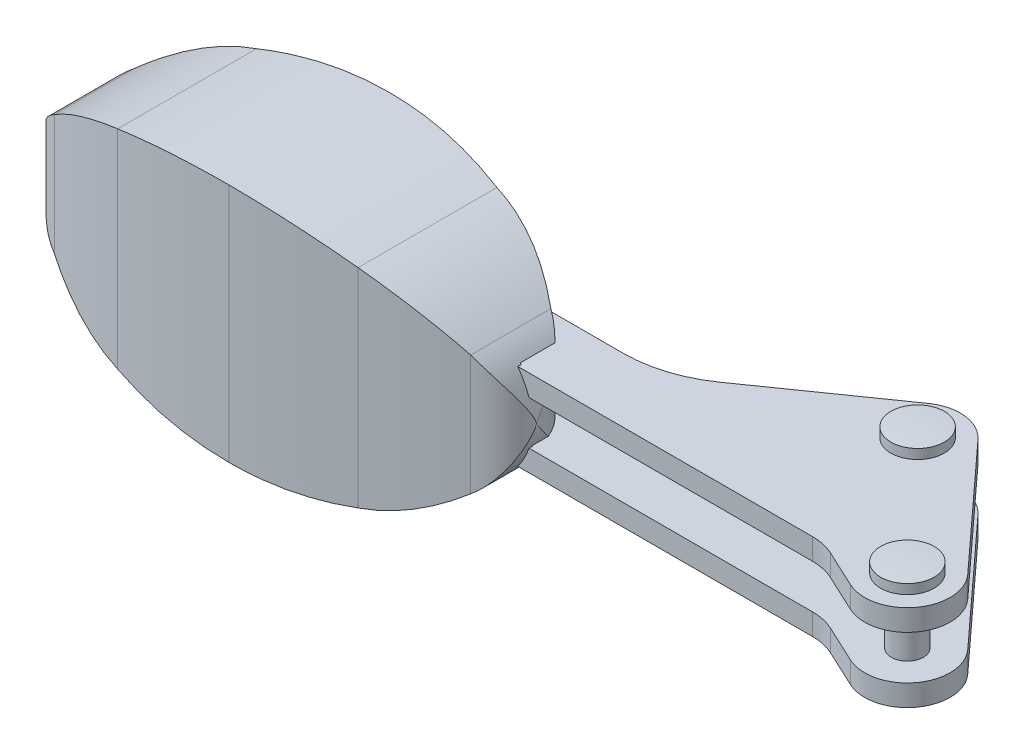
ISO-10303-21;
HEADER;
FILE_DESCRIPTION(('STEP AP214'),'2;1');
FILE_NAME('part.step','',(''),(''),'','','');
FILE_SCHEMA(('AUTOMOTIVE_DESIGN { 1 0 10303 214 1 1 1 1 }'));
ENDSEC;
DATA;
#1=APPLICATION_CONTEXT('core data for automotive mechanical design processes');
#2=APPLICATION_PROTOCOL_DEFINITION('international standard','automotive_design',2000,#1);
#3=PRODUCT_CONTEXT('',#1,'mechanical');
#4=PRODUCT('Part','Part','',(#3));
#5=PRODUCT_RELATED_PRODUCT_CATEGORY('part','',(#4));
#6=PRODUCT_DEFINITION_FORMATION('','',#4);
#7=PRODUCT_DEFINITION_CONTEXT('part definition',#1,'design');
#8=PRODUCT_DEFINITION('design','',#6,#7);
#9=PRODUCT_DEFINITION_SHAPE('','',#8);
#10=(LENGTH_UNIT() NAMED_UNIT(*) SI_UNIT(.MILLI.,.METRE.));
#11=(NAMED_UNIT(*) PLANE_ANGLE_UNIT() SI_UNIT($,.RADIAN.));
#12=(NAMED_UNIT(*) SI_UNIT($,.STERADIAN.) SOLID_ANGLE_UNIT());
#13=UNCERTAINTY_MEASURE_WITH_UNIT(LENGTH_MEASURE(1.E-05),#10,'distance_accuracy_value','');
#14=(GEOMETRIC_REPRESENTATION_CONTEXT(3) GLOBAL_UNCERTAINTY_ASSIGNED_CONTEXT((#13)) GLOBAL_UNIT_ASSIGNED_CONTEXT((#10,
#11,#12)) REPRESENTATION_CONTEXT('',''));
#15=CARTESIAN_POINT('',(0.,0.,0.));
#16=DIRECTION('',(0.,0.,1.));
#17=DIRECTION('',(1.,0.,0.));
#18=AXIS2_PLACEMENT_3D('',#15,#16,#17);
#19=CARTESIAN_POINT('',(-36.5536788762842,-13.25,23.2174394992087));
#20=DIRECTION('',(0.,1.,0.));
#21=DIRECTION('',(-1.,0.,0.));
#22=AXIS2_PLACEMENT_3D('',#19,#20,#21);
#23=CYLINDRICAL_SURFACE('',#22,18.2639383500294);
#24=DIRECTION('',(0.,1.,0.));
#25=VECTOR('',#24,1.);
#26=CARTESIAN_POINT('',(-28.2898566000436,-13.25,6.93));
#27=LINE('',#26,#25);
#28=CARTESIAN_POINT('',(-28.2898566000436,2.05,6.93));
#29=VERTEX_POINT('',#28);
#30=CARTESIAN_POINT('',(-28.2898566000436,4.05,6.93));
#31=VERTEX_POINT('',#30);
#32=EDGE_CURVE('E30',#29,#31,#27,.T.);
#33=ORIENTED_EDGE('',*,*,#32,.F.);
#34=CARTESIAN_POINT('',(-36.5536788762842,2.05,23.2174394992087));
#35=DIRECTION('',(0.,1.,0.));
#36=DIRECTION('',(1.,0.,0.));
#37=AXIS2_PLACEMENT_3D('',#34,#35,#36);
#38=CIRCLE('',#37,18.2639383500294);
#39=CARTESIAN_POINT('',(-27.5447549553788,2.05,7.33000000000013));
#40=VERTEX_POINT('',#39);
#41=EDGE_CURVE('E414',#40,#29,#38,.T.);
#42=ORIENTED_EDGE('',*,*,#41,.F.);
#43=DIRECTION('',(0.,1.,0.));
#44=VECTOR('',#43,1.);
#45=CARTESIAN_POINT('',(-27.5447549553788,-13.25,7.33000000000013));
#46=LINE('',#45,#44);
#47=CARTESIAN_POINT('',(-27.5447549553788,1.95,7.33000000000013));
#48=VERTEX_POINT('',#47);
#49=EDGE_CURVE('E2483',#40,#48,#46,.F.);
#50=ORIENTED_EDGE('',*,*,#49,.T.);
#51=CARTESIAN_POINT('',(-36.5536788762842,1.95,23.2174394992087));
#52=DIRECTION('',(0.,1.,0.));
#53=DIRECTION('',(-1.,0.,0.));
#54=AXIS2_PLACEMENT_3D('',#51,#52,#53);
#55=CIRCLE('',#54,18.2639383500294);
#56=CARTESIAN_POINT('',(-26.0444284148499,1.95,8.28000000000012));
#57=VERTEX_POINT('',#56);
#58=EDGE_CURVE('E581',#48,#57,#55,.F.);
#59=ORIENTED_EDGE('',*,*,#58,.T.);
#60=DIRECTION('',(0.,1.,0.));
#61=VECTOR('',#60,1.);
#62=CARTESIAN_POINT('',(-26.0444284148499,-13.25,8.28000000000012));
#63=LINE('',#62,#61);
#64=CARTESIAN_POINT('',(-26.0444284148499,-1.95,8.28000000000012));
#65=VERTEX_POINT('',#64);
#66=EDGE_CURVE('E1161',#65,#57,#63,.T.);
#67=ORIENTED_EDGE('',*,*,#66,.F.);
#68=CARTESIAN_POINT('',(-36.5536788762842,-1.95,23.2174394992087));
#69=DIRECTION('',(0.,-1.,0.));
#70=DIRECTION('',(1.,0.,0.));
#71=AXIS2_PLACEMENT_3D('',#68,#69,#70);
#72=CIRCLE('',#71,18.2639383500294);
#73=CARTESIAN_POINT('',(-27.5447549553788,-1.95,7.33000000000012));
#74=VERTEX_POINT('',#73);
#75=EDGE_CURVE('E623',#65,#74,#72,.F.);
#76=ORIENTED_EDGE('',*,*,#75,.T.);
#77=DIRECTION('',(0.,1.,0.));
#78=VECTOR('',#77,1.);
#79=CARTESIAN_POINT('',(-27.5447549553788,-13.25,7.33000000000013));
#80=LINE('',#79,#78);
#81=CARTESIAN_POINT('',(-27.5447549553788,-2.05,7.33000000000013));
#82=VERTEX_POINT('',#81);
#83=EDGE_CURVE('E2493',#74,#82,#80,.F.);
#84=ORIENTED_EDGE('',*,*,#83,.T.);
#85=CARTESIAN_POINT('',(-36.5536788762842,-2.05,23.2174394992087));
#86=DIRECTION('',(0.,-1.,0.));
#87=DIRECTION('',(-1.,0.,0.));
#88=AXIS2_PLACEMENT_3D('',#85,#86,#87);
#89=CIRCLE('',#88,18.2639383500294);
#90=CARTESIAN_POINT('',(-28.2898566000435,-2.05,6.93));
#91=VERTEX_POINT('',#90);
#92=EDGE_CURVE('E487',#91,#82,#89,.T.);
#93=ORIENTED_EDGE('',*,*,#92,.F.);
#94=DIRECTION('',(0.,1.,0.));
#95=VECTOR('',#94,1.);
#96=CARTESIAN_POINT('',(-28.2898566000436,-13.25,6.93));
#97=LINE('',#96,#95);
#98=CARTESIAN_POINT('',(-28.2898566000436,-4.05,6.93));
#99=VERTEX_POINT('',#98);
#100=EDGE_CURVE('E1030',#99,#91,#97,.T.);
#101=ORIENTED_EDGE('',*,*,#100,.F.);
#102=CARTESIAN_POINT('',(-36.5536788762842,-4.05,23.2174394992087));
#103=DIRECTION('',(0.,1.,0.));
#104=DIRECTION('',(-1.,0.,0.));
#105=AXIS2_PLACEMENT_3D('',#102,#103,#104);
#106=CIRCLE('',#105,18.2639383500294);
#107=CARTESIAN_POINT('',(-27.5447549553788,-4.05,7.33000000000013));
#108=VERTEX_POINT('',#107);
#109=EDGE_CURVE('E1037',#99,#108,#106,.F.);
#110=ORIENTED_EDGE('',*,*,#109,.T.);
#111=CARTESIAN_POINT('',(-27.5447549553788,-4.15,7.33000000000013));
#112=VERTEX_POINT('',#111);
#113=EDGE_CURVE('E1133',#108,#112,#80,.F.);
#114=ORIENTED_EDGE('',*,*,#113,.T.);
#115=CARTESIAN_POINT('',(-36.5536788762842,-4.15,23.2174394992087));
#116=DIRECTION('',(0.,1.,0.));
#117=DIRECTION('',(-1.,0.,0.));
#118=AXIS2_PLACEMENT_3D('',#115,#116,#117);
#119=CIRCLE('',#118,18.2639383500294);
#120=CARTESIAN_POINT('',(-26.0444284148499,-4.15,8.28000000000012));
#121=VERTEX_POINT('',#120);
#122=EDGE_CURVE('E617',#112,#121,#119,.F.);
#123=ORIENTED_EDGE('',*,*,#122,.T.);
#124=CARTESIAN_POINT('',(-26.0444284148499,-5.625,8.28000000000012));
#125=VERTEX_POINT('',#124);
#126=EDGE_CURVE('E1158',#125,#121,#63,.T.);
#127=ORIENTED_EDGE('',*,*,#126,.F.);
#128=CARTESIAN_POINT('',(-34.28,-9.7427857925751,5.09557898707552));
#129=CARTESIAN_POINT('',(-34.035639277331,-9.67975187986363,5.1262309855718));
#130=CARTESIAN_POINT('',(-33.7929552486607,-9.61264217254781,5.16170660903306));
#131=CARTESIAN_POINT('',(-33.3114814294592,-9.47060319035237,5.24192602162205));
#132=CARTESIAN_POINT('',(-33.0726909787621,-9.39567525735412,5.28666822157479));
#133=CARTESIAN_POINT('',(-32.5997485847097,-9.23840562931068,5.38499269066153));
#134=CARTESIAN_POINT('',(-32.3655913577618,-9.15607305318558,5.43856415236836));
#135=CARTESIAN_POINT('',(-31.9020462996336,-8.98427586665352,5.554177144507));
#136=CARTESIAN_POINT('',(-31.6726586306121,-8.89481101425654,5.6162189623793));
#137=CARTESIAN_POINT('',(-31.0020913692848,-8.62030593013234,5.81155510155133));
#138=CARTESIAN_POINT('',(-30.5680822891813,-8.42566010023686,5.95626499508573));
#139=CARTESIAN_POINT('',(-29.7217962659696,-8.01326097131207,6.2733804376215));
#140=CARTESIAN_POINT('',(-29.3095211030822,-7.79550578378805,6.44578825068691));
#141=CARTESIAN_POINT('',(-28.6523919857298,-7.42180456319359,6.74865581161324));
#142=CARTESIAN_POINT('',(-28.4007191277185,-7.27184435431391,6.87185892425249));
#143=CARTESIAN_POINT('',(-27.907020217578,-6.96431969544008,7.12756728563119));
#144=CARTESIAN_POINT('',(-27.6649917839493,-6.80675714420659,7.26007021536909));
#145=CARTESIAN_POINT('',(-27.1872360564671,-6.48234116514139,7.53565544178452));
#146=CARTESIAN_POINT('',(-26.9516498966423,-6.31538654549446,7.67886271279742));
#147=CARTESIAN_POINT('',(-26.4905052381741,-5.9749368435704,7.9734630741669));
#148=CARTESIAN_POINT('',(-26.2649472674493,-5.80144141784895,8.12485659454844));
#149=CARTESIAN_POINT('',(-26.0444284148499,-5.625,8.28000000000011));
#150=B_SPLINE_CURVE_WITH_KNOTS('',3,(#128,#129,#130,#131,#132,#133,#134,#135,#136,#137,#138,
#139,#140,#141,#142,#143,#144,#145,#146,#147,#148,#149),.UNSPECIFIED.,.F.,.F.,(4,2,2,2,2,2,2,2,
2,2,4),(0.,0.762530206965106,1.52492975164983,2.28640292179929,3.04790193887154,
4.53738710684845,6.0269940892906,6.98009096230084,7.9329510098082,8.89954735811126,
9.8661945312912),.UNSPECIFIED.);
#151=CARTESIAN_POINT('',(-34.28,-9.7427857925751,5.09557898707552));
#152=VERTEX_POINT('',#151);
#153=EDGE_CURVE('E832',#152,#125,#150,.T.);
#154=ORIENTED_EDGE('',*,*,#153,.F.);
#155=DIRECTION('',(0.,1.,0.));
#156=VECTOR('',#155,1.);
#157=CARTESIAN_POINT('',(-34.28,-13.25,5.09557898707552));
#158=LINE('',#157,#156);
#159=CARTESIAN_POINT('',(-34.2799999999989,9.7427857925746,5.09557898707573));
#160=VERTEX_POINT('',#159);
#161=EDGE_CURVE('E1168',#152,#160,#158,.T.);
#162=ORIENTED_EDGE('',*,*,#161,.T.);
#163=CARTESIAN_POINT('',(-26.0444284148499,5.6250000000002,8.28000000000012));
#164=CARTESIAN_POINT('',(-26.3927192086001,5.90369060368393,8.03496512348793));
#165=CARTESIAN_POINT('',(-26.7536929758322,6.17508959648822,7.79921104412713));
#166=CARTESIAN_POINT('',(-27.5011756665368,6.70103791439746,7.34877882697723));
#167=CARTESIAN_POINT('',(-27.8877214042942,6.95556184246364,7.13413223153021));
#168=CARTESIAN_POINT('',(-28.6760433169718,7.43886601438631,6.73396276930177));
#169=CARTESIAN_POINT('',(-29.0772420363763,7.66811316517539,6.54787058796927));
#170=CARTESIAN_POINT('',(-29.9019770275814,8.10473955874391,6.20197503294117));
#171=CARTESIAN_POINT('',(-30.3254974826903,8.31213398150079,6.04215336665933));
#172=CARTESIAN_POINT('',(-31.0353972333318,8.63133889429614,5.80466349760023));
#173=CARTESIAN_POINT('',(-31.3156085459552,8.75047187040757,5.71826169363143));
#174=CARTESIAN_POINT('',(-31.8838491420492,8.97808168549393,5.55812910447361));
#175=CARTESIAN_POINT('',(-32.1718772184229,9.08656015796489,5.48439637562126));
#176=CARTESIAN_POINT('',(-32.7594647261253,9.29372428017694,5.34937925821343));
#177=CARTESIAN_POINT('',(-33.0591327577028,9.39223662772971,5.28830043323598));
#178=CARTESIAN_POINT('',(-33.6649656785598,9.57693866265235,5.18076456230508));
#179=CARTESIAN_POINT('',(-33.9711334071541,9.66312283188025,5.13431405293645));
#180=CARTESIAN_POINT('',(-34.2799999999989,9.7427857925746,5.09557898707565));
#181=B_SPLINE_CURVE_WITH_KNOTS('',3,(#163,#164,#165,#166,#167,#168,#169,#170,#171,#172,#173,
#174,#175,#176,#177,#178,#179,#180),.UNSPECIFIED.,.F.,.F.,(4,2,2,2,2,2,2,2,4),(0.,
1.526850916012,3.0559498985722,4.54883771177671,6.04068155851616,6.98973314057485,
7.93863899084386,8.90192386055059,9.86563856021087),.UNSPECIFIED.);
#182=CARTESIAN_POINT('',(-26.0444284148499,5.6250000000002,8.28000000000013));
#183=VERTEX_POINT('',#182);
#184=EDGE_CURVE('E825',#183,#160,#181,.T.);
#185=ORIENTED_EDGE('',*,*,#184,.F.);
#186=CARTESIAN_POINT('',(-26.0444284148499,4.15,8.28000000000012));
#187=VERTEX_POINT('',#186);
#188=EDGE_CURVE('E1163',#187,#183,#63,.T.);
#189=ORIENTED_EDGE('',*,*,#188,.F.);
#190=CARTESIAN_POINT('',(-36.5536788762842,4.15,23.2174394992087));
#191=DIRECTION('',(0.,-1.,0.));
#192=DIRECTION('',(1.,0.,0.));
#193=AXIS2_PLACEMENT_3D('',#190,#191,#192);
#194=CIRCLE('',#193,18.2639383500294);
#195=CARTESIAN_POINT('',(-27.5447549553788,4.15,7.33000000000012));
#196=VERTEX_POINT('',#195);
#197=EDGE_CURVE('E587',#187,#196,#194,.F.);
#198=ORIENTED_EDGE('',*,*,#197,.T.);
#199=CARTESIAN_POINT('',(-27.5447549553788,4.05,7.33000000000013));
#200=VERTEX_POINT('',#199);
#201=EDGE_CURVE('E2480',#196,#200,#46,.F.);
#202=ORIENTED_EDGE('',*,*,#201,.T.);
#203=CARTESIAN_POINT('',(-36.5536788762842,4.05,23.2174394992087));
#204=DIRECTION('',(0.,1.,0.));
#205=DIRECTION('',(-1.,0.,0.));
#206=AXIS2_PLACEMENT_3D('',#203,#204,#205);
#207=CIRCLE('',#206,18.2639383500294);
#208=EDGE_CURVE('E539',#31,#200,#207,.F.);
#209=ORIENTED_EDGE('',*,*,#208,.F.);
#210=EDGE_LOOP('',(#33,#42,#50,#59,#67,#76,#84,#93,#101,#110,#114,#123,#127,#154,#162,#185,#189,
#198,#202,#209));
#211=FACE_BOUND('',#210,.T.);
#212=ADVANCED_FACE('F14',(#211),#23,.T.);
#213=CARTESIAN_POINT('',(-45.53,4.15,7.33000000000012));
#214=DIRECTION('',(-1.,0.,0.));
#215=DIRECTION('',(0.,0.,1.));
#216=AXIS2_PLACEMENT_3D('',#213,#214,#215);
#217=PLANE('',#216);
#218=DIRECTION('',(0.,0.,-1.));
#219=VECTOR('',#218,1.);
#220=CARTESIAN_POINT('',(-45.53,2.05,8.43));
#221=LINE('',#220,#219);
#222=CARTESIAN_POINT('',(-45.53,2.05,8.43));
#223=VERTEX_POINT('',#222);
#224=CARTESIAN_POINT('',(-45.53,2.05,7.33000000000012));
#225=VERTEX_POINT('',#224);
#226=EDGE_CURVE('E2563',#223,#225,#221,.T.);
#227=ORIENTED_EDGE('',*,*,#226,.F.);
#228=DIRECTION('',(0.,-1.,0.));
#229=VECTOR('',#228,1.);
#230=CARTESIAN_POINT('',(-45.53,4.15,8.43));
#231=LINE('',#230,#229);
#232=CARTESIAN_POINT('',(-45.53,4.05,8.43));
#233=VERTEX_POINT('',#232);
#234=EDGE_CURVE('E38',#233,#223,#231,.T.);
#235=ORIENTED_EDGE('',*,*,#234,.F.);
#236=DIRECTION('',(0.,0.,-1.));
#237=VECTOR('',#236,1.);
#238=CARTESIAN_POINT('',(-45.53,4.05,7.33000000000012));
#239=LINE('',#238,#237);
#240=CARTESIAN_POINT('',(-45.53,4.05,7.33000000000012));
#241=VERTEX_POINT('',#240);
#242=EDGE_CURVE('E2477',#233,#241,#239,.T.);
#243=ORIENTED_EDGE('',*,*,#242,.T.);
#244=DIRECTION('',(0.,-1.,0.));
#245=VECTOR('',#244,1.);
#246=CARTESIAN_POINT('',(-45.53,4.15,7.33000000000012));
#247=LINE('',#246,#245);
#248=CARTESIAN_POINT('',(-45.53,4.15,7.33000000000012));
#249=VERTEX_POINT('',#248);
#250=EDGE_CURVE('E553',#249,#241,#247,.T.);
#251=ORIENTED_EDGE('',*,*,#250,.F.);
#252=DIRECTION('',(0.,0.,-1.));
#253=VECTOR('',#252,1.);
#254=CARTESIAN_POINT('',(-45.53,4.15,12.6300000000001));
#255=LINE('',#254,#253);
#256=CARTESIAN_POINT('',(-45.53,4.15,12.6300000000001));
#257=VERTEX_POINT('',#256);
#258=EDGE_CURVE('E564',#257,#249,#255,.T.);
#259=ORIENTED_EDGE('',*,*,#258,.F.);
#260=DIRECTION('',(0.,1.,0.));
#261=VECTOR('',#260,1.);
#262=CARTESIAN_POINT('',(-45.53,1.95,12.6300000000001));
#263=LINE('',#262,#261);
#264=CARTESIAN_POINT('',(-45.53,4.05,12.6300000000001));
#265=VERTEX_POINT('',#264);
#266=EDGE_CURVE('E559',#265,#257,#263,.T.);
#267=ORIENTED_EDGE('',*,*,#266,.F.);
#268=CARTESIAN_POINT('',(-45.53,4.05,9.93));
#269=VERTEX_POINT('',#268);
#270=EDGE_CURVE('E1022',#265,#269,#239,.T.);
#271=ORIENTED_EDGE('',*,*,#270,.T.);
#272=DIRECTION('',(0.,1.,0.));
#273=VECTOR('',#272,1.);
#274=CARTESIAN_POINT('',(-45.53,4.15,9.93));
#275=LINE('',#274,#273);
#276=CARTESIAN_POINT('',(-45.53,2.05,9.93));
#277=VERTEX_POINT('',#276);
#278=EDGE_CURVE('E2475',#277,#269,#275,.T.);
#279=ORIENTED_EDGE('',*,*,#278,.F.);
#280=DIRECTION('',(0.,0.,-1.));
#281=VECTOR('',#280,1.);
#282=CARTESIAN_POINT('',(-45.53,2.05,12.6300000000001));
#283=LINE('',#282,#281);
#284=CARTESIAN_POINT('',(-45.53,2.05,12.6300000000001));
#285=VERTEX_POINT('',#284);
#286=EDGE_CURVE('E441',#285,#277,#283,.T.);
#287=ORIENTED_EDGE('',*,*,#286,.F.);
#288=CARTESIAN_POINT('',(-45.53,1.95,12.6300000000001));
#289=VERTEX_POINT('',#288);
#290=EDGE_CURVE('E560',#289,#285,#263,.T.);
#291=ORIENTED_EDGE('',*,*,#290,.F.);
#292=DIRECTION('',(0.,0.,1.));
#293=VECTOR('',#292,1.);
#294=CARTESIAN_POINT('',(-45.53,1.95,7.33000000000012));
#295=LINE('',#294,#293);
#296=CARTESIAN_POINT('',(-45.53,1.95,7.33000000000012));
#297=VERTEX_POINT('',#296);
#298=EDGE_CURVE('E556',#297,#289,#295,.T.);
#299=ORIENTED_EDGE('',*,*,#298,.F.);
#300=EDGE_CURVE('E557',#225,#297,#247,.T.);
#301=ORIENTED_EDGE('',*,*,#300,.F.);
#302=EDGE_LOOP('',(#227,#235,#243,#251,#259,#267,#271,#279,#287,#291,#299,#301));
#303=FACE_BOUND('',#302,.T.);
#304=ADVANCED_FACE('F845',(#303),#217,.F.);
#305=CARTESIAN_POINT('',(-30.5995990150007,-0.436322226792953,21.83));
#306=DIRECTION('',(0.,0.,-1.));
#307=DIRECTION('',(0.,-1.,0.));
#308=AXIS2_PLACEMENT_3D('',#305,#306,#307);
#309=CYLINDRICAL_SURFACE('',#308,7.58216369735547);
#310=DIRECTION('',(0.,0.,-1.));
#311=VECTOR('',#310,1.);
#312=CARTESIAN_POINT('',(-23.4366800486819,2.05,21.83));
#313=LINE('',#312,#311);
#314=CARTESIAN_POINT('',(-23.4366800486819,2.05,12.6300000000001));
#315=VERTEX_POINT('',#314);
#316=CARTESIAN_POINT('',(-23.4366800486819,2.05,12.93));
#317=VERTEX_POINT('',#316);
#318=EDGE_CURVE('E453',#315,#317,#313,.F.);
#319=ORIENTED_EDGE('',*,*,#318,.T.);
#320=CARTESIAN_POINT('',(-30.5995990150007,-0.436322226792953,12.93));
#321=DIRECTION('',(0.,0.,1.));
#322=DIRECTION('',(0.,1.,0.));
#323=AXIS2_PLACEMENT_3D('',#320,#321,#322);
#324=CIRCLE('',#323,7.58216369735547);
#325=CARTESIAN_POINT('',(-24.4871429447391,4.05,12.93));
#326=VERTEX_POINT('',#325);
#327=EDGE_CURVE('E1031',#317,#326,#324,.T.);
#328=ORIENTED_EDGE('',*,*,#327,.T.);
#329=DIRECTION('',(0.,0.,-1.));
#330=VECTOR('',#329,1.);
#331=CARTESIAN_POINT('',(-24.4871429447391,4.05,21.83));
#332=LINE('',#331,#330);
#333=CARTESIAN_POINT('',(-24.4871429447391,4.05,12.6300000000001));
#334=VERTEX_POINT('',#333);
#335=EDGE_CURVE('E1027',#326,#334,#332,.T.);
#336=ORIENTED_EDGE('',*,*,#335,.T.);
#337=CARTESIAN_POINT('',(-30.5995990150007,-0.436322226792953,12.6300000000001));
#338=DIRECTION('',(0.,0.,-1.));
#339=DIRECTION('',(0.,-1.,0.));
#340=AXIS2_PLACEMENT_3D('',#337,#338,#339);
#341=CIRCLE('',#340,7.58216369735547);
#342=CARTESIAN_POINT('',(-24.5618134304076,4.15,12.6300000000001));
#343=VERTEX_POINT('',#342);
#344=EDGE_CURVE('E2489',#343,#334,#341,.T.);
#345=ORIENTED_EDGE('',*,*,#344,.F.);
#346=DIRECTION('',(0.,0.,-1.));
#347=VECTOR('',#346,1.);
#348=CARTESIAN_POINT('',(-24.5618134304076,4.15,21.83));
#349=LINE('',#348,#347);
#350=CARTESIAN_POINT('',(-24.5618134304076,4.15,9.38075867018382));
#351=VERTEX_POINT('',#350);
#352=EDGE_CURVE('E2484',#351,#343,#349,.F.);
#353=ORIENTED_EDGE('',*,*,#352,.F.);
#354=CARTESIAN_POINT('',(-23.03,1.92554305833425E-13,12.6300000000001));
#355=CARTESIAN_POINT('',(-23.0330916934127,0.0534576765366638,12.6029704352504));
#356=CARTESIAN_POINT('',(-23.0366592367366,0.105666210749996,12.5737569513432));
#357=CARTESIAN_POINT('',(-23.0446964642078,0.208141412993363,12.5123477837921));
#358=CARTESIAN_POINT('',(-23.0491648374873,0.258410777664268,12.4801564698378));
#359=CARTESIAN_POINT('',(-23.0589530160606,0.35761011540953,12.4141611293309));
#360=CARTESIAN_POINT('',(-23.0642710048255,0.406542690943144,12.3803606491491));
#361=CARTESIAN_POINT('',(-23.0757535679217,0.503541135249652,12.3116371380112));
#362=CARTESIAN_POINT('',(-23.0819184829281,0.551606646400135,12.2767136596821));
#363=CARTESIAN_POINT('',(-23.1016407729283,0.694647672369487,12.1710362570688));
#364=CARTESIAN_POINT('',(-23.1164463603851,0.78867395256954,12.0992328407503));
#365=CARTESIAN_POINT('',(-23.1493853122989,0.97523133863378,11.9543643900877));
#366=CARTESIAN_POINT('',(-23.1675205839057,1.06776155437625,11.8812986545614));
#367=CARTESIAN_POINT('',(-23.207349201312,1.25273014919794,11.7338490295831));
#368=CARTESIAN_POINT('',(-23.2290799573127,1.34515600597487,11.6594595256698));
#369=CARTESIAN_POINT('',(-23.2759749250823,1.52906256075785,11.5106361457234));
#370=CARTESIAN_POINT('',(-23.3011384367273,1.62054344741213,11.4362022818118));
#371=CARTESIAN_POINT('',(-23.3549522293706,1.80272335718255,11.287528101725));
#372=CARTESIAN_POINT('',(-23.3836043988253,1.89342192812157,11.2132879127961));
#373=CARTESIAN_POINT('',(-23.4444259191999,2.07401253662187,11.0652637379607));
#374=CARTESIAN_POINT('',(-23.4765955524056,2.16390450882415,10.9914797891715));
#375=CARTESIAN_POINT('',(-23.593477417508,2.47196631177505,10.738583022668));
#376=CARTESIAN_POINT('',(-23.6870520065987,2.68815662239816,10.5610408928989));
#377=CARTESIAN_POINT('',(-23.8962718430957,3.11488582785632,10.212172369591));
#378=CARTESIAN_POINT('',(-24.0119210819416,3.32542369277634,10.040847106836));
#379=CARTESIAN_POINT('',(-24.2654126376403,3.73806760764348,9.7079272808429));
#380=CARTESIAN_POINT('',(-24.4031046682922,3.94021984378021,9.54627634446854));
#381=CARTESIAN_POINT('',(-24.7021018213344,4.33547948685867,9.23440915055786));
#382=CARTESIAN_POINT('',(-24.8633883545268,4.52859385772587,9.08418403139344));
#383=CARTESIAN_POINT('',(-25.1861668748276,4.87706855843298,8.81855659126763));
#384=CARTESIAN_POINT('',(-25.3444413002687,5.03391944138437,8.70122793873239));
#385=CARTESIAN_POINT('',(-25.5959948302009,5.26157299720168,8.5352551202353));
#386=CARTESIAN_POINT('',(-25.6823837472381,5.33632411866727,8.48150674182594));
#387=CARTESIAN_POINT('',(-25.8598748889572,5.48292378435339,8.37780214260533));
#388=CARTESIAN_POINT('',(-25.9509798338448,5.55477060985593,8.32784815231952));
#389=CARTESIAN_POINT('',(-26.0444284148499,5.6250000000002,8.28000000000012));
#390=B_SPLINE_CURVE_WITH_KNOTS('',3,(#354,#355,#356,#357,#358,#359,#360,#361,#362,#363,#364,
#365,#366,#367,#368,#369,#370,#371,#372,#373,#374,#375,#376,#377,#378,#379,#380,#381,#382,#383,
#384,#385,#386,#387,#388,#389),.UNSPECIFIED.,.F.,.F.,(4,2,2,2,2,2,2,2,2,2,2,2,2,2,2,2,2,4),(0.,
0.179744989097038,0.359230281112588,0.538336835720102,0.717515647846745,1.07511928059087,
1.43292838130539,1.79472617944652,2.15645029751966,2.51837109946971,2.880320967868,
3.7643077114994,4.64845444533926,5.52681151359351,6.40448024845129,7.15874289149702,
7.5373406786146,7.91615932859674),.UNSPECIFIED.);
#391=EDGE_CURVE('E1139',#351,#183,#390,.T.);
#392=ORIENTED_EDGE('',*,*,#391,.T.);
#393=DIRECTION('',(0.,0.,-1.));
#394=VECTOR('',#393,1.);
#395=CARTESIAN_POINT('',(-26.0444284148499,5.6250000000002,21.83));
#396=LINE('',#395,#394);
#397=CARTESIAN_POINT('',(-26.0444284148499,5.6250000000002,15.78));
#398=VERTEX_POINT('',#397);
#399=EDGE_CURVE('E626',#398,#183,#396,.T.);
#400=ORIENTED_EDGE('',*,*,#399,.F.);
#401=CARTESIAN_POINT('',(-26.0444284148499,5.62500000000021,15.78));
#402=CARTESIAN_POINT('',(-25.9019832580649,5.51796741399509,15.7404731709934));
#403=CARTESIAN_POINT('',(-25.764617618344,5.4068639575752,15.6944249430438));
#404=CARTESIAN_POINT('',(-25.5005369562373,5.1778737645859,15.591264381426));
#405=CARTESIAN_POINT('',(-25.3738021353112,5.06000035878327,15.5341733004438));
#406=CARTESIAN_POINT('',(-25.1320860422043,4.8195620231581,15.4113282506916));
#407=CARTESIAN_POINT('',(-25.0170043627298,4.69705243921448,15.3456619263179));
#408=CARTESIAN_POINT('',(-24.7970944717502,4.44710607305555,15.2067440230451));
#409=CARTESIAN_POINT('',(-24.6922730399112,4.31966610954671,15.1334874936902));
#410=CARTESIAN_POINT('',(-24.454534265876,4.01098421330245,14.9514902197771));
#411=CARTESIAN_POINT('',(-24.3262467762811,3.82784228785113,14.8399106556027));
#412=CARTESIAN_POINT('',(-24.0884640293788,3.45510715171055,14.6079870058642));
#413=CARTESIAN_POINT('',(-23.9789708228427,3.26551323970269,14.4876419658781));
#414=CARTESIAN_POINT('',(-23.7776438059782,2.87994587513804,14.2404433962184));
#415=CARTESIAN_POINT('',(-23.6858873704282,2.68394864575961,14.113564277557));
#416=CARTESIAN_POINT('',(-23.5199450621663,2.28656911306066,13.8566032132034));
#417=CARTESIAN_POINT('',(-23.4457664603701,2.08518461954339,13.7265199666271));
#418=CARTESIAN_POINT('',(-23.3331116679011,1.73417462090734,13.5038731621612));
#419=CARTESIAN_POINT('',(-23.2904699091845,1.58600340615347,13.4110943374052));
#420=CARTESIAN_POINT('',(-23.2139974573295,1.28591031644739,13.2285318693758));
#421=CARTESIAN_POINT('',(-23.1801508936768,1.1339957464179,13.1387430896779));
#422=CARTESIAN_POINT('',(-23.1360660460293,0.901969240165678,13.0099553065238));
#423=CARTESIAN_POINT('',(-23.1225048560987,0.824087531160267,12.9680831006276));
#424=CARTESIAN_POINT('',(-23.0976413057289,0.666492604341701,12.8873874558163));
#425=CARTESIAN_POINT('',(-23.0863367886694,0.586781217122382,12.8485611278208));
#426=CARTESIAN_POINT('',(-23.0660056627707,0.424443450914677,12.7752557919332));
#427=CARTESIAN_POINT('',(-23.0569928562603,0.341802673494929,12.7408037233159));
#428=CARTESIAN_POINT('',(-23.04151393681,0.173338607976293,12.6791787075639));
#429=CARTESIAN_POINT('',(-23.0350566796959,0.0875053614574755,12.6520311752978));
#430=CARTESIAN_POINT('',(-23.03,1.92554305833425E-13,12.6300000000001));
#431=B_SPLINE_CURVE_WITH_KNOTS('',3,(#401,#402,#403,#404,#405,#406,#407,#408,#409,#410,#411,
#412,#413,#414,#415,#416,#417,#418,#419,#420,#421,#422,#423,#424,#425,#426,#427,#428,#429,#430),
.UNSPECIFIED.,.F.,.F.,(4,2,2,2,2,2,2,2,2,2,2,2,2,2,4),(0.,0.547052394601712,1.09306224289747,
1.63387410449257,2.17504093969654,2.92362425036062,3.67228919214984,4.42414983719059,
5.17632094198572,5.71594959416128,6.25459764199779,6.52289729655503,6.79093930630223,
7.06055933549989,7.33110567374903),.UNSPECIFIED.);
#432=CARTESIAN_POINT('',(-23.03,1.77809156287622E-13,12.6300000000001));
#433=VERTEX_POINT('',#432);
#434=EDGE_CURVE('E891',#398,#433,#431,.T.);
#435=ORIENTED_EDGE('',*,*,#434,.T.);
#436=CARTESIAN_POINT('',(-23.4027474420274,1.95,11.1669073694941));
#437=VERTEX_POINT('',#436);
#438=EDGE_CURVE('E855',#433,#437,#390,.T.);
#439=ORIENTED_EDGE('',*,*,#438,.T.);
#440=DIRECTION('',(0.,0.,-1.));
#441=VECTOR('',#440,1.);
#442=CARTESIAN_POINT('',(-23.4027474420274,1.95,21.83));
#443=LINE('',#442,#441);
#444=CARTESIAN_POINT('',(-23.4027474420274,1.95,12.6300000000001));
#445=VERTEX_POINT('',#444);
#446=EDGE_CURVE('E2487',#445,#437,#443,.T.);
#447=ORIENTED_EDGE('',*,*,#446,.F.);
#448=EDGE_CURVE('E2492',#315,#445,#341,.T.);
#449=ORIENTED_EDGE('',*,*,#448,.F.);
#450=EDGE_LOOP('',(#319,#328,#336,#345,#353,#392,#400,#435,#439,#447,#449));
#451=FACE_BOUND('',#450,.T.);
#452=ADVANCED_FACE('F818',(#451),#309,.T.);
#453=CARTESIAN_POINT('',(-45.53,-1.95,7.33000000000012));
#454=DIRECTION('',(-1.,0.,0.));
#455=DIRECTION('',(0.,0.,1.));
#456=AXIS2_PLACEMENT_3D('',#453,#454,#455);
#457=PLANE('',#456);
#458=DIRECTION('',(0.,0.,1.));
#459=VECTOR('',#458,1.);
#460=CARTESIAN_POINT('',(-45.53,-2.05,9.93));
#461=LINE('',#460,#459);
#462=CARTESIAN_POINT('',(-45.53,-2.05,9.93));
#463=VERTEX_POINT('',#462);
#464=CARTESIAN_POINT('',(-45.53,-2.05,12.6300000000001));
#465=VERTEX_POINT('',#464);
#466=EDGE_CURVE('E505',#463,#465,#461,.T.);
#467=ORIENTED_EDGE('',*,*,#466,.F.);
#468=DIRECTION('',(0.,1.,0.));
#469=VECTOR('',#468,1.);
#470=CARTESIAN_POINT('',(-45.53,-1.95,9.93));
#471=LINE('',#470,#469);
#472=CARTESIAN_POINT('',(-45.53,-4.05,9.93));
#473=VERTEX_POINT('',#472);
#474=EDGE_CURVE('E2469',#473,#463,#471,.T.);
#475=ORIENTED_EDGE('',*,*,#474,.F.);
#476=DIRECTION('',(0.,0.,-1.));
#477=VECTOR('',#476,1.);
#478=CARTESIAN_POINT('',(-45.53,-4.05,7.33000000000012));
#479=LINE('',#478,#477);
#480=CARTESIAN_POINT('',(-45.53,-4.05,12.6300000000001));
#481=VERTEX_POINT('',#480);
#482=EDGE_CURVE('E1036',#481,#473,#479,.T.);
#483=ORIENTED_EDGE('',*,*,#482,.F.);
#484=DIRECTION('',(0.,1.,0.));
#485=VECTOR('',#484,1.);
#486=CARTESIAN_POINT('',(-45.53,-4.15,12.6300000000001));
#487=LINE('',#486,#485);
#488=CARTESIAN_POINT('',(-45.53,-4.15,12.6300000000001));
#489=VERTEX_POINT('',#488);
#490=EDGE_CURVE('E598',#489,#481,#487,.T.);
#491=ORIENTED_EDGE('',*,*,#490,.F.);
#492=DIRECTION('',(0.,0.,1.));
#493=VECTOR('',#492,1.);
#494=CARTESIAN_POINT('',(-45.53,-4.15,7.33000000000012));
#495=LINE('',#494,#493);
#496=CARTESIAN_POINT('',(-45.53,-4.15,7.33000000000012));
#497=VERTEX_POINT('',#496);
#498=EDGE_CURVE('E594',#497,#489,#495,.T.);
#499=ORIENTED_EDGE('',*,*,#498,.F.);
#500=DIRECTION('',(0.,-1.,0.));
#501=VECTOR('',#500,1.);
#502=CARTESIAN_POINT('',(-45.53,-1.95,7.33000000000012));
#503=LINE('',#502,#501);
#504=CARTESIAN_POINT('',(-45.53,-4.05,7.33000000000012));
#505=VERTEX_POINT('',#504);
#506=EDGE_CURVE('E595',#505,#497,#503,.T.);
#507=ORIENTED_EDGE('',*,*,#506,.F.);
#508=CARTESIAN_POINT('',(-45.53,-4.05,8.43));
#509=VERTEX_POINT('',#508);
#510=EDGE_CURVE('E2471',#509,#505,#479,.T.);
#511=ORIENTED_EDGE('',*,*,#510,.F.);
#512=DIRECTION('',(0.,-1.,0.));
#513=VECTOR('',#512,1.);
#514=CARTESIAN_POINT('',(-45.53,-1.95,8.43));
#515=LINE('',#514,#513);
#516=CARTESIAN_POINT('',(-45.53,-2.05,8.43));
#517=VERTEX_POINT('',#516);
#518=EDGE_CURVE('E1026',#517,#509,#515,.T.);
#519=ORIENTED_EDGE('',*,*,#518,.F.);
#520=DIRECTION('',(0.,0.,1.));
#521=VECTOR('',#520,1.);
#522=CARTESIAN_POINT('',(-45.53,-2.05,7.33000000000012));
#523=LINE('',#522,#521);
#524=CARTESIAN_POINT('',(-45.53,-2.05,7.33000000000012));
#525=VERTEX_POINT('',#524);
#526=EDGE_CURVE('E493',#525,#517,#523,.T.);
#527=ORIENTED_EDGE('',*,*,#526,.F.);
#528=CARTESIAN_POINT('',(-45.53,-1.95,7.33000000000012));
#529=VERTEX_POINT('',#528);
#530=EDGE_CURVE('E591',#529,#525,#503,.T.);
#531=ORIENTED_EDGE('',*,*,#530,.F.);
#532=DIRECTION('',(0.,0.,-1.));
#533=VECTOR('',#532,1.);
#534=CARTESIAN_POINT('',(-45.53,-1.95,12.6300000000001));
#535=LINE('',#534,#533);
#536=CARTESIAN_POINT('',(-45.53,-1.95,12.6300000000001));
#537=VERTEX_POINT('',#536);
#538=EDGE_CURVE('E590',#537,#529,#535,.T.);
#539=ORIENTED_EDGE('',*,*,#538,.F.);
#540=EDGE_CURVE('E597',#465,#537,#487,.T.);
#541=ORIENTED_EDGE('',*,*,#540,.F.);
#542=EDGE_LOOP('',(#467,#475,#483,#491,#499,#507,#511,#519,#527,#531,#539,#541));
#543=FACE_BOUND('',#542,.T.);
#544=ADVANCED_FACE('F877',(#543),#457,.F.);
#545=CARTESIAN_POINT('',(-30.5995990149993,0.436322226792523,21.83));
#546=DIRECTION('',(0.,0.,-1.));
#547=DIRECTION('',(0.,-1.,0.));
#548=AXIS2_PLACEMENT_3D('',#545,#546,#547);
#549=CYLINDRICAL_SURFACE('',#548,7.58216369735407);
#550=CARTESIAN_POINT('',(-30.5995990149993,0.436322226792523,12.93));
#551=DIRECTION('',(0.,0.,1.));
#552=DIRECTION('',(0.,1.,0.));
#553=AXIS2_PLACEMENT_3D('',#550,#551,#552);
#554=CIRCLE('',#553,7.58216369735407);
#555=CARTESIAN_POINT('',(-24.4871429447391,-4.05,12.93));
#556=VERTEX_POINT('',#555);
#557=CARTESIAN_POINT('',(-23.4366800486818,-2.05,12.93));
#558=VERTEX_POINT('',#557);
#559=EDGE_CURVE('E1042',#556,#558,#554,.T.);
#560=ORIENTED_EDGE('',*,*,#559,.T.);
#561=DIRECTION('',(0.,0.,-1.));
#562=VECTOR('',#561,1.);
#563=CARTESIAN_POINT('',(-23.4366800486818,-2.05,21.83));
#564=LINE('',#563,#562);
#565=CARTESIAN_POINT('',(-23.4366800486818,-2.05,12.6300000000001));
#566=VERTEX_POINT('',#565);
#567=EDGE_CURVE('E508',#558,#566,#564,.T.);
#568=ORIENTED_EDGE('',*,*,#567,.T.);
#569=CARTESIAN_POINT('',(-30.5995990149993,0.436322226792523,12.6300000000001));
#570=DIRECTION('',(0.,0.,-1.));
#571=DIRECTION('',(0.,-1.,0.));
#572=AXIS2_PLACEMENT_3D('',#569,#570,#571);
#573=CIRCLE('',#572,7.58216369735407);
#574=CARTESIAN_POINT('',(-23.4027474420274,-1.95,12.6300000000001));
#575=VERTEX_POINT('',#574);
#576=EDGE_CURVE('E870',#575,#566,#573,.T.);
#577=ORIENTED_EDGE('',*,*,#576,.F.);
#578=DIRECTION('',(0.,0.,-1.));
#579=VECTOR('',#578,1.);
#580=CARTESIAN_POINT('',(-23.4027474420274,-1.95,21.83));
#581=LINE('',#580,#579);
#582=CARTESIAN_POINT('',(-23.4027474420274,-1.95,11.1669073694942));
#583=VERTEX_POINT('',#582);
#584=EDGE_CURVE('E1126',#583,#575,#581,.F.);
#585=ORIENTED_EDGE('',*,*,#584,.F.);
#586=CARTESIAN_POINT('',(-26.0444284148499,-5.625,8.28000000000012));
#587=CARTESIAN_POINT('',(-25.8666922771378,-5.49141255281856,8.37104490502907));
#588=CARTESIAN_POINT('',(-25.6974925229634,-5.35204282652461,8.46960870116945));
#589=CARTESIAN_POINT('',(-25.3762655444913,-5.06390390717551,8.67910002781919));
#590=CARTESIAN_POINT('',(-25.2242039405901,-4.91515450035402,8.79000188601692));
#591=CARTESIAN_POINT('',(-24.9376364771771,-4.6109300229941,9.02107481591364));
#592=CARTESIAN_POINT('',(-24.8030150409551,-4.45550939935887,9.1411754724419));
#593=CARTESIAN_POINT('',(-24.5495164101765,-4.13827717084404,9.38950301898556));
#594=CARTESIAN_POINT('',(-24.4306498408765,-3.97646134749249,9.51773530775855));
#595=CARTESIAN_POINT('',(-24.1750775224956,-3.59866471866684,9.81983273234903));
#596=CARTESIAN_POINT('',(-24.0436059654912,-3.38090820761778,9.99591214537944));
#597=CARTESIAN_POINT('',(-23.8053199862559,-2.93860006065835,10.3559439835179));
#598=CARTESIAN_POINT('',(-23.6985091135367,-2.71404745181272,10.5398975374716));
#599=CARTESIAN_POINT('',(-23.5083806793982,-2.25900187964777,10.9133752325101));
#600=CARTESIAN_POINT('',(-23.425102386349,-2.02849967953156,11.1029081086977));
#601=CARTESIAN_POINT('',(-23.3174138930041,-1.67882279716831,11.3887351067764));
#602=CARTESIAN_POINT('',(-23.284387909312,-1.56160350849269,11.4842705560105));
#603=CARTESIAN_POINT('',(-23.2239989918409,-1.32565811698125,11.675269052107));
#604=CARTESIAN_POINT('',(-23.1966355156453,-1.20693215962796,11.7707321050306));
#605=CARTESIAN_POINT('',(-23.1543403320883,-1.00072869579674,11.9341969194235));
#606=CARTESIAN_POINT('',(-23.1380666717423,-0.913731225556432,12.0024614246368));
#607=CARTESIAN_POINT('',(-23.1084488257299,-0.738324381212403,12.1376611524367));
#608=CARTESIAN_POINT('',(-23.0951020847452,-0.649916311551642,12.2045974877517));
#609=CARTESIAN_POINT('',(-23.0772977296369,-0.515631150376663,12.3028320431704));
#610=CARTESIAN_POINT('',(-23.0717390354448,-0.470660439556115,12.3351675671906));
#611=CARTESIAN_POINT('',(-23.0613596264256,-0.379911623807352,12.3987719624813));
#612=CARTESIAN_POINT('',(-23.0565386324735,-0.334133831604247,12.4300412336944));
#613=CARTESIAN_POINT('',(-23.0476346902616,-0.241342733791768,12.4910878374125));
#614=CARTESIAN_POINT('',(-23.043553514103,-0.194326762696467,12.5208614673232));
#615=CARTESIAN_POINT('',(-23.0361759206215,-0.0985735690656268,12.5777361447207));
#616=CARTESIAN_POINT('',(-23.0328805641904,-0.0498341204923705,12.6048335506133));
#617=CARTESIAN_POINT('',(-23.03,2.02962646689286E-13,12.63));
#618=B_SPLINE_CURVE_WITH_KNOTS('',3,(#586,#587,#588,#589,#590,#591,#592,#593,#594,#595,#596,
#597,#598,#599,#600,#601,#602,#603,#604,#605,#606,#607,#608,#609,#610,#611,#612,#613,#614,#615,
#616,#617),.UNSPECIFIED.,.F.,.F.,(4,2,2,2,2,2,2,2,2,2,2,2,2,2,2,4),(0.,0.720079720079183,
1.43868821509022,2.15226004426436,2.86631069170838,3.793073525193,4.7199696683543,
5.64840349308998,6.11267025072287,6.57689251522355,6.91217474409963,7.2471630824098,
7.41414868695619,7.58107095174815,7.74838791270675,7.91592949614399),.UNSPECIFIED.);
#619=EDGE_CURVE('E869',#583,#433,#618,.T.);
#620=ORIENTED_EDGE('',*,*,#619,.T.);
#621=CARTESIAN_POINT('',(-23.03,2.02962646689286E-13,12.6300000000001));
#622=CARTESIAN_POINT('',(-23.0351929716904,-0.0898410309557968,12.6526337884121));
#623=CARTESIAN_POINT('',(-23.0418600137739,-0.177913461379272,12.6806391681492));
#624=CARTESIAN_POINT('',(-23.0578900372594,-0.350690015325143,12.7442916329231));
#625=CARTESIAN_POINT('',(-23.067243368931,-0.435404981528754,12.7799112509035));
#626=CARTESIAN_POINT('',(-23.0883709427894,-0.601771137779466,12.8556682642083));
#627=CARTESIAN_POINT('',(-23.1001304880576,-0.683437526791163,12.8957775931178));
#628=CARTESIAN_POINT('',(-23.1260188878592,-0.84488435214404,12.9790935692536));
#629=CARTESIAN_POINT('',(-23.1401500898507,-0.924662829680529,13.0223032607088));
#630=CARTESIAN_POINT('',(-23.1862014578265,-1.16275393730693,13.1553586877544));
#631=CARTESIAN_POINT('',(-23.2216413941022,-1.31875968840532,13.2481083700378));
#632=CARTESIAN_POINT('',(-23.3018224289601,-1.62692673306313,13.4364931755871));
#633=CARTESIAN_POINT('',(-23.3465809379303,-1.7790802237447,13.5321334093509));
#634=CARTESIAN_POINT('',(-23.470270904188,-2.15569651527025,13.7717031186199));
#635=CARTESIAN_POINT('',(-23.5550835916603,-2.37815820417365,13.9157975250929));
#636=CARTESIAN_POINT('',(-23.746478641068,-2.81653156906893,14.1993326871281));
#637=CARTESIAN_POINT('',(-23.8530558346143,-3.03244478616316,14.3387745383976));
#638=CARTESIAN_POINT('',(-24.0881885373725,-3.45585445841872,14.6084178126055));
#639=CARTESIAN_POINT('',(-24.2166089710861,-3.66339348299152,14.7386694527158));
#640=CARTESIAN_POINT('',(-24.4967889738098,-4.06986827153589,14.9869270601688));
#641=CARTESIAN_POINT('',(-24.648533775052,-4.26880937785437,15.1049406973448));
#642=CARTESIAN_POINT('',(-24.9005012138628,-4.56649082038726,15.2736224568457));
#643=CARTESIAN_POINT('',(-24.992208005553,-4.66912702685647,15.3302477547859));
#644=CARTESIAN_POINT('',(-25.1826330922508,-4.87073924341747,15.4377920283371));
#645=CARTESIAN_POINT('',(-25.2813475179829,-4.96971722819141,15.488714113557));
#646=CARTESIAN_POINT('',(-25.4866115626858,-5.16427632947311,15.584337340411));
#647=CARTESIAN_POINT('',(-25.5932161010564,-5.2598250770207,15.6289870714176));
#648=CARTESIAN_POINT('',(-25.8135468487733,-5.44617636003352,15.7105748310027));
#649=CARTESIAN_POINT('',(-25.9272822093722,-5.53697251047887,15.7475026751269));
#650=CARTESIAN_POINT('',(-26.0444284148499,-5.625,15.78));
#651=B_SPLINE_CURVE_WITH_KNOTS('',3,(#621,#622,#623,#624,#625,#626,#627,#628,#629,#630,#631,
#632,#633,#634,#635,#636,#637,#638,#639,#640,#641,#642,#643,#644,#645,#646,#647,#648,#649,#650),
.UNSPECIFIED.,.F.,.F.,(4,2,2,2,2,2,2,2,2,2,2,2,2,2,4),(0.,0.277744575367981,0.55450365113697,
0.829620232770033,1.10501074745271,1.65935785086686,2.21475011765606,3.04865283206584,
3.88235775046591,4.71108306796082,5.5392858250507,5.98551282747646,6.43149533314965,
6.88094309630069,7.3309799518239),.UNSPECIFIED.);
#652=CARTESIAN_POINT('',(-26.0444284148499,-5.625,15.78));
#653=VERTEX_POINT('',#652);
#654=EDGE_CURVE('E884',#433,#653,#651,.T.);
#655=ORIENTED_EDGE('',*,*,#654,.T.);
#656=DIRECTION('',(0.,0.,-1.));
#657=VECTOR('',#656,1.);
#658=CARTESIAN_POINT('',(-26.0444284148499,-5.625,21.83));
#659=LINE('',#658,#657);
#660=EDGE_CURVE('E644',#653,#125,#659,.T.);
#661=ORIENTED_EDGE('',*,*,#660,.T.);
#662=CARTESIAN_POINT('',(-24.5618134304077,-4.15,9.38075867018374));
#663=VERTEX_POINT('',#662);
#664=EDGE_CURVE('E861',#125,#663,#618,.T.);
#665=ORIENTED_EDGE('',*,*,#664,.T.);
#666=DIRECTION('',(0.,0.,-1.));
#667=VECTOR('',#666,1.);
#668=CARTESIAN_POINT('',(-24.5618134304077,-4.15,21.83));
#669=LINE('',#668,#667);
#670=CARTESIAN_POINT('',(-24.5618134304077,-4.15,12.6300000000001));
#671=VERTEX_POINT('',#670);
#672=EDGE_CURVE('E1134',#671,#663,#669,.T.);
#673=ORIENTED_EDGE('',*,*,#672,.F.);
#674=CARTESIAN_POINT('',(-24.4871429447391,-4.05,12.6300000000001));
#675=VERTEX_POINT('',#674);
#676=EDGE_CURVE('E868',#675,#671,#573,.T.);
#677=ORIENTED_EDGE('',*,*,#676,.F.);
#678=DIRECTION('',(0.,0.,-1.));
#679=VECTOR('',#678,1.);
#680=CARTESIAN_POINT('',(-24.4871429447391,-4.05,21.83));
#681=LINE('',#680,#679);
#682=EDGE_CURVE('E1043',#556,#675,#681,.T.);
#683=ORIENTED_EDGE('',*,*,#682,.F.);
#684=EDGE_LOOP('',(#560,#568,#577,#585,#620,#655,#661,#665,#673,#677,#683));
#685=FACE_BOUND('',#684,.T.);
#686=ADVANCED_FACE('F872',(#685),#549,.T.);
#687=CARTESIAN_POINT('',(10.4699999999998,-3.0592522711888,11.4300000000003));
#688=DIRECTION('',(0.,1.,0.));
#689=DIRECTION('',(1.,0.,0.));
#690=AXIS2_PLACEMENT_3D('',#687,#688,#689);
#691=CYLINDRICAL_SURFACE('',#690,1.5);
#692=CARTESIAN_POINT('',(10.4699999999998,2.05,11.4300000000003));
#693=DIRECTION('',(0.,-1.,0.));
#694=DIRECTION('',(1.,0.,0.));
#695=AXIS2_PLACEMENT_3D('',#692,#693,#694);
#696=CIRCLE('',#695,1.5);
#697=CARTESIAN_POINT('',(11.9699999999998,2.05,11.4300000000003));
#698=VERTEX_POINT('',#697);
#699=EDGE_CURVE('E9',#698,#698,#696,.F.);
#700=ORIENTED_EDGE('',*,*,#699,.F.);
#701=EDGE_LOOP('',(#700));
#702=FACE_BOUND('',#701,.T.);
#703=CARTESIAN_POINT('',(10.4699999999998,-2.05,11.4300000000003));
#704=DIRECTION('',(0.,1.,0.));
#705=DIRECTION('',(-1.,0.,0.));
#706=AXIS2_PLACEMENT_3D('',#703,#704,#705);
#707=CIRCLE('',#706,1.5);
#708=CARTESIAN_POINT('',(8.96999999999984,-2.05,11.4300000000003));
#709=VERTEX_POINT('',#708);
#710=EDGE_CURVE('E512',#709,#709,#707,.F.);
#711=ORIENTED_EDGE('',*,*,#710,.F.);
#712=EDGE_LOOP('',(#711));
#713=FACE_BOUND('',#712,.T.);
#714=ADVANCED_FACE('F876',(#702,#713),#691,.T.);
#715=CARTESIAN_POINT('',(10.4699999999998,-3.55,11.4300000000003));
#716=DIRECTION('',(0.,-1.,0.));
#717=DIRECTION('',(-1.,0.,0.));
#718=AXIS2_PLACEMENT_3D('',#715,#716,#717);
#719=CONICAL_SURFACE('',#718,0.85,1.04719755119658);
#720=CARTESIAN_POINT('',(10.4699999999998,-3.0592522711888,11.4300000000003));
#721=VERTEX_POINT('',#720);
#722=VERTEX_LOOP('',#721);
#723=FACE_BOUND('',#722,.T.);
#724=CARTESIAN_POINT('',(10.4699999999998,-3.55,11.4300000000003));
#725=DIRECTION('',(0.,1.,0.));
#726=DIRECTION('',(1.,0.,0.));
#727=AXIS2_PLACEMENT_3D('',#724,#725,#726);
#728=CIRCLE('',#727,0.85);
#729=CARTESIAN_POINT('',(11.3199999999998,-3.55,11.4300000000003));
#730=VERTEX_POINT('',#729);
#731=EDGE_CURVE('E516',#730,#730,#728,.T.);
#732=ORIENTED_EDGE('',*,*,#731,.F.);
#733=EDGE_LOOP('',(#732));
#734=FACE_BOUND('',#733,.T.);
#735=ADVANCED_FACE('F908',(#723,#734),#719,.F.);
#736=CARTESIAN_POINT('',(10.4699999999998,-3.0592522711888,11.4300000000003));
#737=DIRECTION('',(0.,1.,0.));
#738=DIRECTION('',(1.,0.,0.));
#739=AXIS2_PLACEMENT_3D('',#736,#737,#738);
#740=CYLINDRICAL_SURFACE('',#739,0.85000000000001);
#741=ORIENTED_EDGE('',*,*,#731,.T.);
#742=EDGE_LOOP('',(#741));
#743=FACE_BOUND('',#742,.T.);
#744=CARTESIAN_POINT('',(10.4699999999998,-5.0379559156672,11.4300000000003));
#745=DIRECTION('',(0.,1.,0.));
#746=DIRECTION('',(1.,0.,0.));
#747=AXIS2_PLACEMENT_3D('',#744,#745,#746);
#748=CIRCLE('',#747,0.85000000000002);
#749=CARTESIAN_POINT('',(10.4699999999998,-5.0379559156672,10.5799999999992));
#750=VERTEX_POINT('',#749);
#751=EDGE_CURVE('E519',#750,#750,#748,.T.);
#752=ORIENTED_EDGE('',*,*,#751,.F.);
#753=EDGE_LOOP('',(#752));
#754=FACE_BOUND('',#753,.T.);
#755=ADVANCED_FACE('F1279',(#743,#754),#740,.F.);
#756=CARTESIAN_POINT('',(10.4699999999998,24.9499999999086,11.4299999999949));
#757=DIRECTION('',(0.,1.,0.));
#758=DIRECTION('',(0.,0.,-1.));
#759=AXIS2_PLACEMENT_3D('',#756,#757,#758);
#760=SPHERICAL_SURFACE('',#759,29.9999999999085);
#761=CARTESIAN_POINT('',(10.4699999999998,-4.9456518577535,11.4300000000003));
#762=DIRECTION('',(0.,1.,0.));
#763=DIRECTION('',(1.,0.,0.));
#764=AXIS2_PLACEMENT_3D('',#761,#762,#763);
#765=CIRCLE('',#764,2.5);
#766=CARTESIAN_POINT('',(10.4699999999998,-4.9456518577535,8.92999999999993));
#767=VERTEX_POINT('',#766);
#768=EDGE_CURVE('E523',#767,#767,#765,.T.);
#769=CARTESIAN_POINT('',(10.4699999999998,-5.0379559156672,10.5799999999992));
#770=CARTESIAN_POINT('',(10.4699999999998,-5.03746811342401,10.5627903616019));
#771=CARTESIAN_POINT('',(10.4699999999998,-5.03696549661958,10.5455811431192));
#772=CARTESIAN_POINT('',(10.4699999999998,-5.0359306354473,10.5111635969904));
#773=CARTESIAN_POINT('',(10.4699999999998,-5.03539839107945,10.4939552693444));
#774=CARTESIAN_POINT('',(10.4699999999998,-5.0343042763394,10.4595395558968));
#775=CARTESIAN_POINT('',(10.4699999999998,-5.0337424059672,10.4423321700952));
#776=CARTESIAN_POINT('',(10.4699999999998,-5.03258904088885,10.4079183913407));
#777=CARTESIAN_POINT('',(10.4699999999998,-5.03199754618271,10.3907119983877));
#778=CARTESIAN_POINT('',(10.4699999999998,-5.0307849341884,10.3563002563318));
#779=CARTESIAN_POINT('',(10.4699999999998,-5.03016381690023,10.3390949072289));
#780=CARTESIAN_POINT('',(10.4699999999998,-5.02889196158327,10.3046853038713));
#781=CARTESIAN_POINT('',(10.4699999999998,-5.02824122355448,10.2874810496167));
#782=CARTESIAN_POINT('',(10.4699999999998,-5.02691012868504,10.2530736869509));
#783=CARTESIAN_POINT('',(10.4699999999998,-5.02622977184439,10.2358705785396));
#784=CARTESIAN_POINT('',(10.4699999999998,-5.02483944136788,10.2014655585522));
#785=CARTESIAN_POINT('',(10.4699999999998,-5.02412946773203,10.1842636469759));
#786=CARTESIAN_POINT('',(10.4699999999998,-5.02267990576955,10.1498610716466));
#787=CARTESIAN_POINT('',(10.4699999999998,-5.02194031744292,10.1326604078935));
#788=CARTESIAN_POINT('',(10.4699999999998,-5.0204315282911,10.0982603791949));
#789=CARTESIAN_POINT('',(10.4699999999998,-5.01966232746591,10.0810610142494));
#790=CARTESIAN_POINT('',(10.4699999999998,-5.01809431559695,10.0466636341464));
#791=CARTESIAN_POINT('',(10.4699999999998,-5.01729550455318,10.0294656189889));
#792=CARTESIAN_POINT('',(10.4699999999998,-5.01566827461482,9.99507098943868));
#793=CARTESIAN_POINT('',(10.4699999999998,-5.01483985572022,9.97787437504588));
#794=CARTESIAN_POINT('',(10.4699999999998,-5.01315341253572,9.94348259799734));
#795=CARTESIAN_POINT('',(10.4699999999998,-5.01229538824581,9.9262874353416));
#796=CARTESIAN_POINT('',(10.4699999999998,-5.01054973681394,9.89189861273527));
#797=CARTESIAN_POINT('',(10.4699999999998,-5.00966210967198,9.87470495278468));
#798=CARTESIAN_POINT('',(10.4699999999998,-5.00785725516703,9.84031918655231));
#799=CARTESIAN_POINT('',(10.4699999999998,-5.00694002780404,9.82312708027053));
#800=CARTESIAN_POINT('',(10.4699999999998,-5.00507597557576,9.7887444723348));
#801=CARTESIAN_POINT('',(10.4699999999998,-5.00412915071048,9.77155397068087));
#802=CARTESIAN_POINT('',(10.4699999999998,-5.0022059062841,9.73717462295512));
#803=CARTESIAN_POINT('',(10.4699999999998,-5.00122948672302,9.71998577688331));
#804=CARTESIAN_POINT('',(10.4699999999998,-4.99924705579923,9.68560979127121));
#805=CARTESIAN_POINT('',(10.4699999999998,-4.99824104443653,9.66842265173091));
#806=CARTESIAN_POINT('',(10.4699999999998,-4.99619943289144,9.63405013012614));
#807=CARTESIAN_POINT('',(10.4699999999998,-4.99516383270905,9.61686474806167));
#808=CARTESIAN_POINT('',(10.4699999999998,-4.99306304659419,9.58249579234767));
#809=CARTESIAN_POINT('',(10.4699999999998,-4.99199786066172,9.56531221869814));
#810=CARTESIAN_POINT('',(10.4699999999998,-4.98983790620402,9.53094693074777));
#811=CARTESIAN_POINT('',(10.4699999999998,-4.98874313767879,9.51376521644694));
#812=CARTESIAN_POINT('',(10.4699999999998,-4.98652402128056,9.47940369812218));
#813=CARTESIAN_POINT('',(10.4699999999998,-4.98539967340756,9.46222389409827));
#814=CARTESIAN_POINT('',(10.4699999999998,-4.98312140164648,9.42786624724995));
#815=CARTESIAN_POINT('',(10.4699999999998,-4.98196747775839,9.41068840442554));
#816=CARTESIAN_POINT('',(10.4699999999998,-4.97963005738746,9.376334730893));
#817=CARTESIAN_POINT('',(10.4699999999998,-4.97844656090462,9.35915890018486));
#818=CARTESIAN_POINT('',(10.4699999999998,-4.97604999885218,9.32480930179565));
#819=CARTESIAN_POINT('',(10.4699999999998,-4.97483693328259,9.30763553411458));
#820=CARTESIAN_POINT('',(10.4699999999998,-4.97238123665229,9.27329011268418));
#821=CARTESIAN_POINT('',(10.4699999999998,-4.97113860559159,9.25611845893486));
#822=CARTESIAN_POINT('',(10.4699999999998,-4.96862378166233,9.2217773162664));
#823=CARTESIAN_POINT('',(10.4699999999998,-4.96735158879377,9.20460782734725));
#824=CARTESIAN_POINT('',(10.4699999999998,-4.9647776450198,9.17027106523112));
#825=CARTESIAN_POINT('',(10.4699999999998,-4.96347589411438,9.15310379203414));
#826=CARTESIAN_POINT('',(10.4699999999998,-4.96084283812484,9.11877151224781));
#827=CARTESIAN_POINT('',(10.4699999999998,-4.95951153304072,9.10160650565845));
#828=CARTESIAN_POINT('',(10.4699999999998,-4.95681937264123,9.06727880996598));
#829=CARTESIAN_POINT('',(10.4699999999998,-4.95545851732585,9.05011612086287));
#830=CARTESIAN_POINT('',(10.4699999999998,-4.95270726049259,9.01579311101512));
#831=CARTESIAN_POINT('',(10.4699999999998,-4.9513168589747,8.9986327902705));
#832=CARTESIAN_POINT('',(10.4699999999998,-4.94850651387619,8.96431456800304));
#833=CARTESIAN_POINT('',(10.4699999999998,-4.94708657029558,8.94715666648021));
#834=CARTESIAN_POINT('',(10.4699999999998,-4.9456518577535,8.92999999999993));
#835=B_SPLINE_CURVE_WITH_KNOTS('',3,(#769,#770,#771,#772,#773,#774,#775,#776,#777,#778,#779,
#780,#781,#782,#783,#784,#785,#786,#787,#788,#789,#790,#791,#792,#793,#794,#795,#796,#797,#798,
#799,#800,#801,#802,#803,#804,#805,#806,#807,#808,#809,#810,#811,#812,#813,#814,#815,#816,#817,
#818,#819,#820,#821,#822,#823,#824,#825,#826,#827,#828,#829,#830,#831,#832,#833,#834),
.UNSPECIFIED.,.F.,.F.,(4,2,2,2,2,2,2,2,2,2,2,2,2,2,2,2,2,2,2,2,2,2,2,2,2,2,2,2,2,2,2,2,4),(0.,
0.0516496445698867,0.103299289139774,0.154948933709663,0.206598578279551,0.258248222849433,
0.309897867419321,0.361547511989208,0.413197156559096,0.464846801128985,0.516496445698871,
0.56814609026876,0.619795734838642,0.671445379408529,0.723095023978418,0.774744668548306,
0.826394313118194,0.878043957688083,0.92969360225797,0.981343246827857,1.03299289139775,
1.08464253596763,1.13629218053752,1.1879418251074,1.23959146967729,1.29124111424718,
1.34289075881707,1.39454040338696,1.44619004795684,1.49783969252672,1.54948933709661,
1.6011389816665,1.65278862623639),.UNSPECIFIED.);
#836=EDGE_CURVE('BSEAM1275',#750,#767,#835,.T.);
#837=ORIENTED_EDGE('',*,*,#751,.T.);
#838=ORIENTED_EDGE('',*,*,#768,.F.);
#839=ORIENTED_EDGE('',*,*,#836,.T.);
#840=ORIENTED_EDGE('',*,*,#836,.F.);
#841=EDGE_LOOP('',(#837,#839,#838,#840));
#842=FACE_BOUND('',#841,.T.);
#843=ADVANCED_FACE('F1275',(#842),#760,.T.);
#844=CARTESIAN_POINT('',(10.4699999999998,-3.0592522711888,11.4300000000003));
#845=DIRECTION('',(0.,1.,0.));
#846=DIRECTION('',(1.,0.,0.));
#847=AXIS2_PLACEMENT_3D('',#844,#845,#846);
#848=CYLINDRICAL_SURFACE('',#847,2.5);
#849=ORIENTED_EDGE('',*,*,#768,.T.);
#850=EDGE_LOOP('',(#849));
#851=FACE_BOUND('',#850,.T.);
#852=CARTESIAN_POINT('',(10.4699999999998,-4.05,11.4300000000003));
#853=DIRECTION('',(0.,1.,0.));
#854=DIRECTION('',(1.,0.,0.));
#855=AXIS2_PLACEMENT_3D('',#852,#853,#854);
#856=CIRCLE('',#855,2.5);
#857=CARTESIAN_POINT('',(12.9699999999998,-4.05,11.4300000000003));
#858=VERTEX_POINT('',#857);
#859=EDGE_CURVE('E526',#858,#858,#856,.T.);
#860=ORIENTED_EDGE('',*,*,#859,.F.);
#861=EDGE_LOOP('',(#860));
#862=FACE_BOUND('',#861,.T.);
#863=ADVANCED_FACE('F1265',(#851,#862),#848,.T.);
#864=CARTESIAN_POINT('',(10.4699999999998,-24.9499999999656,11.4299999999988));
#865=DIRECTION('',(0.,1.,0.));
#866=DIRECTION('',(0.,0.,1.));
#867=AXIS2_PLACEMENT_3D('',#864,#865,#866);
#868=SPHERICAL_SURFACE('',#867,29.9999999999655);
#869=CARTESIAN_POINT('',(10.4699999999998,4.9456518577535,11.4300000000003));
#870=DIRECTION('',(0.,1.,0.));
#871=DIRECTION('',(1.,0.,0.));
#872=AXIS2_PLACEMENT_3D('',#869,#870,#871);
#873=CIRCLE('',#872,2.5);
#874=CARTESIAN_POINT('',(12.9699999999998,4.9456518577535,11.4300000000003));
#875=VERTEX_POINT('',#874);
#876=EDGE_CURVE('E532',#875,#875,#873,.T.);
#877=ORIENTED_EDGE('',*,*,#876,.T.);
#878=EDGE_LOOP('',(#877));
#879=FACE_BOUND('',#878,.T.);
#880=ADVANCED_FACE('F1261',(#879),#868,.T.);
#881=CARTESIAN_POINT('',(10.4699999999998,-3.0592522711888,11.4300000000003));
#882=DIRECTION('',(0.,1.,0.));
#883=DIRECTION('',(1.,0.,0.));
#884=AXIS2_PLACEMENT_3D('',#881,#882,#883);
#885=CYLINDRICAL_SURFACE('',#884,2.5);
#886=CARTESIAN_POINT('',(10.4699999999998,4.05,11.4300000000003));
#887=DIRECTION('',(0.,1.,0.));
#888=DIRECTION('',(1.,0.,0.));
#889=AXIS2_PLACEMENT_3D('',#886,#887,#888);
#890=CIRCLE('',#889,2.5);
#891=CARTESIAN_POINT('',(12.9699999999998,4.05,11.4300000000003));
#892=VERTEX_POINT('',#891);
#893=EDGE_CURVE('E529',#892,#892,#890,.T.);
#894=ORIENTED_EDGE('',*,*,#893,.T.);
#895=EDGE_LOOP('',(#894));
#896=FACE_BOUND('',#895,.T.);
#897=ORIENTED_EDGE('',*,*,#876,.F.);
#898=EDGE_LOOP('',(#897));
#899=FACE_BOUND('',#898,.T.);
#900=ADVANCED_FACE('F1264',(#896,#899),#885,.T.);
#901=CARTESIAN_POINT('',(-63.8764767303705,-13.25,11.6725843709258));
#902=DIRECTION('',(0.,1.,0.));
#903=DIRECTION('',(-1.,0.,0.));
#904=AXIS2_PLACEMENT_3D('',#901,#902,#903);
#905=CYLINDRICAL_SURFACE('',#904,4.26244064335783);
#906=CARTESIAN_POINT('',(-65.0155715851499,-5.625,15.78));
#907=CARTESIAN_POINT('',(-65.161263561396,-5.52181310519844,15.7395734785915));
#908=CARTESIAN_POINT('',(-65.3016564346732,-5.4141519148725,15.6923177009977));
#909=CARTESIAN_POINT('',(-65.5712792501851,-5.19138538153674,15.5862810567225));
#910=CARTESIAN_POINT('',(-65.7005318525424,-5.07629602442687,15.527524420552));
#911=CARTESIAN_POINT('',(-65.9465682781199,-4.84102849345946,15.4011280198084));
#912=CARTESIAN_POINT('',(-66.0634728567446,-4.72091962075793,15.3335922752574));
#913=CARTESIAN_POINT('',(-66.2865559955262,-4.47535911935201,15.1907476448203));
#914=CARTESIAN_POINT('',(-66.3927275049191,-4.34990405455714,15.1154337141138));
#915=CARTESIAN_POINT('',(-66.6271885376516,-4.05307813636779,14.9330495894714));
#916=CARTESIAN_POINT('',(-66.7514850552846,-3.88001078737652,14.8236015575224));
#917=CARTESIAN_POINT('',(-66.9821042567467,-3.52739049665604,14.596564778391));
#918=CARTESIAN_POINT('',(-67.0884224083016,-3.3478359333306,14.4789739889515));
#919=CARTESIAN_POINT('',(-67.2844274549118,-2.98181683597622,14.2374677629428));
#920=CARTESIAN_POINT('',(-67.3739909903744,-2.79531231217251,14.1135133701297));
#921=CARTESIAN_POINT('',(-67.5361330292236,-2.41692606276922,13.8629090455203));
#922=CARTESIAN_POINT('',(-67.6087178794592,-2.22504637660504,13.7362601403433));
#923=CARTESIAN_POINT('',(-67.7072733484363,-1.92630526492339,13.5431692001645));
#924=CARTESIAN_POINT('',(-67.7391675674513,-1.8216550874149,13.4762731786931));
#925=CARTESIAN_POINT('',(-67.798312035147,-1.61022176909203,13.3437701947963));
#926=CARTESIAN_POINT('',(-67.8255619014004,-1.50343845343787,13.2781633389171));
#927=CARTESIAN_POINT('',(-67.8751473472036,-1.2882529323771,13.150311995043));
#928=CARTESIAN_POINT('',(-67.8975298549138,-1.17987803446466,13.0880402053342));
#929=CARTESIAN_POINT('',(-67.937621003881,-0.959558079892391,12.9685278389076));
#930=CARTESIAN_POINT('',(-67.9553309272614,-0.847614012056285,12.9112858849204));
#931=CARTESIAN_POINT('',(-67.9859505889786,-0.617572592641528,12.8055667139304));
#932=CARTESIAN_POINT('',(-67.9988181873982,-0.499430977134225,12.7571682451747));
#933=CARTESIAN_POINT('',(-68.0139026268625,-0.316721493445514,12.6975514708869));
#934=CARTESIAN_POINT('',(-68.0182406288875,-0.254523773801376,12.6797779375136));
#935=CARTESIAN_POINT('',(-68.0253438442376,-0.128437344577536,12.650091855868));
#936=CARTESIAN_POINT('',(-68.0281032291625,-0.0645432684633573,12.6382010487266));
#937=CARTESIAN_POINT('',(-68.03,4.22405166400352E-13,12.6300000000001));
#938=B_SPLINE_CURVE_WITH_KNOTS('',3,(#906,#907,#908,#909,#910,#911,#912,#913,#914,#915,#916,
#917,#918,#919,#920,#921,#922,#923,#924,#925,#926,#927,#928,#929,#930,#931,#932,#933,#934,#935,
#936,#937),.UNSPECIFIED.,.F.,.F.,(4,2,2,2,2,2,2,2,2,2,2,2,2,2,2,4),(0.,0.548627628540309,
1.09611158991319,1.63761650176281,2.17947485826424,2.89705519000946,3.61481615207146,
4.33766997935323,5.06025316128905,5.44486969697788,5.82951788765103,6.21027464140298,
6.59092680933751,6.97481890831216,7.16903930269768,7.36397222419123),.UNSPECIFIED.);
#939=CARTESIAN_POINT('',(-65.0155715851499,-5.625,15.78));
#940=VERTEX_POINT('',#939);
#941=CARTESIAN_POINT('',(-68.03,4.22405166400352E-13,12.6300000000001));
#942=VERTEX_POINT('',#941);
#943=EDGE_CURVE('E657',#940,#942,#938,.T.);
#944=ORIENTED_EDGE('',*,*,#943,.F.);
#945=DIRECTION('',(0.,1.,0.));
#946=VECTOR('',#945,1.);
#947=CARTESIAN_POINT('',(-65.0155715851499,-13.25,15.78));
#948=LINE('',#947,#946);
#949=CARTESIAN_POINT('',(-65.0155715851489,5.6250000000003,15.7800000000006));
#950=VERTEX_POINT('',#949);
#951=EDGE_CURVE('E692',#940,#950,#948,.T.);
#952=ORIENTED_EDGE('',*,*,#951,.T.);
#953=CARTESIAN_POINT('',(-68.03,3.97251675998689E-13,12.6300000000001));
#954=CARTESIAN_POINT('',(-68.0271212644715,0.0976773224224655,12.6424947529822));
#955=CARTESIAN_POINT('',(-68.0222965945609,0.193587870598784,12.6632242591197));
#956=CARTESIAN_POINT('',(-68.0092025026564,0.381089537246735,12.7164674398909));
#957=CARTESIAN_POINT('',(-68.0009613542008,0.472709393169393,12.7488841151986));
#958=CARTESIAN_POINT('',(-67.9814992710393,0.651716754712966,12.8208773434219));
#959=CARTESIAN_POINT('',(-67.970302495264,0.739132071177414,12.8603950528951));
#960=CARTESIAN_POINT('',(-67.9450695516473,0.911511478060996,12.9441483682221));
#961=CARTESIAN_POINT('',(-67.9310260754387,0.996468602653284,12.9883959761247));
#962=CARTESIAN_POINT('',(-67.8950163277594,1.19269083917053,13.0952208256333));
#963=CARTESIAN_POINT('',(-67.8719770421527,1.30313216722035,13.1589347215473));
#964=CARTESIAN_POINT('',(-67.8211377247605,1.5213290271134,13.2890455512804));
#965=CARTESIAN_POINT('',(-67.7933360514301,1.62908361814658,13.3554434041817));
#966=CARTESIAN_POINT('',(-67.7329872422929,1.84245644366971,13.4894856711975));
#967=CARTESIAN_POINT('',(-67.7004403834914,1.94807480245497,13.5571300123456));
#968=CARTESIAN_POINT('',(-67.6305647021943,2.15750873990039,13.6927454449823));
#969=CARTESIAN_POINT('',(-67.5932353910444,2.26132413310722,13.7607165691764));
#970=CARTESIAN_POINT('',(-67.4732174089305,2.57231928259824,13.9654012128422));
#971=CARTESIAN_POINT('',(-67.3830686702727,2.77703010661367,14.1015850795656));
#972=CARTESIAN_POINT('',(-67.1823752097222,3.17984403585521,14.368383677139));
#973=CARTESIAN_POINT('',(-67.0718422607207,3.37795087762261,14.4990015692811));
#974=CARTESIAN_POINT('',(-66.8640904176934,3.71124901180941,14.715311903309));
#975=CARTESIAN_POINT('',(-66.7720672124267,3.84826776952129,14.8031914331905));
#976=CARTESIAN_POINT('',(-66.5768182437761,4.11796530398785,14.9730849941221));
#977=CARTESIAN_POINT('',(-66.4735913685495,4.25064364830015,15.0550984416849));
#978=CARTESIAN_POINT('',(-66.2562924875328,4.51013960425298,15.2113249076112));
#979=CARTESIAN_POINT('',(-66.1422848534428,4.63698602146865,15.2855792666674));
#980=CARTESIAN_POINT('',(-65.9028374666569,4.88459037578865,15.4251096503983));
#981=CARTESIAN_POINT('',(-65.777405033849,5.00535213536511,15.4903913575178));
#982=CARTESIAN_POINT('',(-65.5476196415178,5.21063919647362,15.5952672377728));
#983=CARTESIAN_POINT('',(-65.4457415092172,5.29673074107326,15.6372187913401));
#984=CARTESIAN_POINT('',(-65.2354679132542,5.4644319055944,15.7141299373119));
#985=CARTESIAN_POINT('',(-65.1270589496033,5.54603152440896,15.7490743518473));
#986=CARTESIAN_POINT('',(-65.0155715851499,5.6249999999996,15.78));
#987=B_SPLINE_CURVE_WITH_KNOTS('',3,(#953,#954,#955,#956,#957,#958,#959,#960,#961,#962,#963,
#964,#965,#966,#967,#968,#969,#970,#971,#972,#973,#974,#975,#976,#977,#978,#979,#980,#981,#982,
#983,#984,#985,#986),.UNSPECIFIED.,.F.,.F.,(4,2,2,2,2,2,2,2,2,2,2,2,2,2,2,2,4),(0.,
0.294247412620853,0.586106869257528,0.875650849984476,1.16594781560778,1.55445873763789,
1.94310384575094,2.33172627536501,2.72038844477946,3.50509507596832,4.28934991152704,
4.8499003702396,5.41050650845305,5.96795448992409,6.52504779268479,6.94414542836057,
7.36414127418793),.UNSPECIFIED.);
#988=EDGE_CURVE('E647',#942,#950,#987,.T.);
#989=ORIENTED_EDGE('',*,*,#988,.F.);
#990=EDGE_LOOP('',(#944,#952,#989));
#991=FACE_BOUND('',#990,.T.);
#992=ADVANCED_FACE('F664',(#991),#905,.T.);
#993=CARTESIAN_POINT('',(-60.8818112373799,-0.210489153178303,21.83));
#994=DIRECTION('',(0.,0.,-1.));
#995=DIRECTION('',(0.,-1.,0.));
#996=AXIS2_PLACEMENT_3D('',#993,#994,#995);
#997=CYLINDRICAL_SURFACE('',#996,7.15128717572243);
#998=ORIENTED_EDGE('',*,*,#988,.T.);
#999=DIRECTION('',(0.,0.,-1.));
#1000=VECTOR('',#999,1.);
#1001=CARTESIAN_POINT('',(-65.0155715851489,5.6250000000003,21.83));
#1002=LINE('',#1001,#1000);
#1003=CARTESIAN_POINT('',(-65.0155715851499,5.62499999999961,8.28000000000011));
#1004=VERTEX_POINT('',#1003);
#1005=EDGE_CURVE('E635',#950,#1004,#1002,.T.);
#1006=ORIENTED_EDGE('',*,*,#1005,.T.);
#1007=CARTESIAN_POINT('',(-65.0155715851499,5.62499999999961,8.28000000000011));
#1008=CARTESIAN_POINT('',(-65.1972881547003,5.49625500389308,8.37308356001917));
#1009=CARTESIAN_POINT('',(-65.3700775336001,5.36113047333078,8.47402650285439));
#1010=CARTESIAN_POINT('',(-65.6976593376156,5.08053769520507,8.68873585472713));
#1011=CARTESIAN_POINT('',(-65.8524911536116,4.93509326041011,8.80247307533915));
#1012=CARTESIAN_POINT('',(-66.1431422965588,4.63740581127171,9.03894594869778));
#1013=CARTESIAN_POINT('',(-66.2791600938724,4.48526041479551,9.16156284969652));
#1014=CARTESIAN_POINT('',(-66.5348748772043,4.17407056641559,9.41500015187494));
#1015=CARTESIAN_POINT('',(-66.6545609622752,4.01502159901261,9.54582594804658));
#1016=CARTESIAN_POINT('',(-66.9059032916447,3.6510612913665,9.84726619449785));
#1017=CARTESIAN_POINT('',(-67.033131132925,3.44458324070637,10.0196829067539));
#1018=CARTESIAN_POINT('',(-67.2639767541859,3.0246762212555,10.3716899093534));
#1019=CARTESIAN_POINT('',(-67.3675879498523,2.81124533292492,10.5512821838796));
#1020=CARTESIAN_POINT('',(-67.552874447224,2.37680486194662,10.9164586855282));
#1021=CARTESIAN_POINT('',(-67.6343683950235,2.15574844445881,11.1020792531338));
#1022=CARTESIAN_POINT('',(-67.7398570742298,1.81974658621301,11.3812156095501));
#1023=CARTESIAN_POINT('',(-67.7722216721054,1.70703971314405,11.4743542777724));
#1024=CARTESIAN_POINT('',(-67.8314533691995,1.47983148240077,11.6601820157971));
#1025=CARTESIAN_POINT('',(-67.8583212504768,1.36533038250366,11.7528711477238));
#1026=CARTESIAN_POINT('',(-67.8978900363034,1.17560277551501,11.9033984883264));
#1027=CARTESIAN_POINT('',(-67.9122047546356,1.10111186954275,11.9617445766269));
#1028=CARTESIAN_POINT('',(-67.9386123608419,0.950677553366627,12.0771610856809));
#1029=CARTESIAN_POINT('',(-67.9507039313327,0.874733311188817,12.1342307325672));
#1030=CARTESIAN_POINT('',(-67.972500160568,0.721683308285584,12.2452790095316));
#1031=CARTESIAN_POINT('',(-67.9822318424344,0.64460259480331,12.2992866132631));
#1032=CARTESIAN_POINT('',(-67.9994190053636,0.487255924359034,12.4027669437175));
#1033=CARTESIAN_POINT('',(-68.0068774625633,0.40699428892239,12.4522455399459));
#1034=CARTESIAN_POINT('',(-68.0169403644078,0.272703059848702,12.5245434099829));
#1035=CARTESIAN_POINT('',(-68.0203098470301,0.220399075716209,12.5503155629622));
#1036=CARTESIAN_POINT('',(-68.0259980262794,0.112632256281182,12.5956558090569));
#1037=CARTESIAN_POINT('',(-68.0283072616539,0.0571457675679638,12.6151675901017));
#1038=CARTESIAN_POINT('',(-68.03,4.1286418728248E-13,12.63));
#1039=B_SPLINE_CURVE_WITH_KNOTS('',3,(#1007,#1008,#1009,#1010,#1011,#1012,#1013,#1014,#1015,
#1016,#1017,#1018,#1019,#1020,#1021,#1022,#1023,#1024,#1025,#1026,#1027,#1028,#1029,#1030,#1031,
#1032,#1033,#1034,#1035,#1036,#1037,#1038),.UNSPECIFIED.,.F.,.F.,(4,2,2,2,2,2,2,2,2,2,2,2,2,2,2,
4),(0.,0.723326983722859,1.44503603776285,2.15843127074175,2.87230036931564,3.76374765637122,
4.65544317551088,5.55424336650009,6.00340937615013,6.4525114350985,6.73957223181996,
7.02680258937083,7.31056955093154,7.59396338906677,7.76882556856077,7.94521919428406),.UNSPECIFIED.);
#1040=EDGE_CURVE('E682',#1004,#942,#1039,.T.);
#1041=ORIENTED_EDGE('',*,*,#1040,.T.);
#1042=EDGE_LOOP('',(#998,#1006,#1041));
#1043=FACE_BOUND('',#1042,.T.);
#1044=ADVANCED_FACE('F668',(#1043),#997,.T.);
#1045=CARTESIAN_POINT('',(-62.4608535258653,-13.25,13.2698055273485));
#1046=DIRECTION('',(0.,1.,0.));
#1047=DIRECTION('',(-1.,0.,0.));
#1048=AXIS2_PLACEMENT_3D('',#1045,#1046,#1047);
#1049=CYLINDRICAL_SURFACE('',#1048,5.60577769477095);
#1050=CARTESIAN_POINT('',(-68.03,4.22405166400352E-13,12.6300000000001));
#1051=CARTESIAN_POINT('',(-68.0278153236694,-0.0731429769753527,12.6106866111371));
#1052=CARTESIAN_POINT('',(-68.0246501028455,-0.143516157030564,12.5842187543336));
#1053=CARTESIAN_POINT('',(-68.0166274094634,-0.279423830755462,12.522168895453));
#1054=CARTESIAN_POINT('',(-68.0117845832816,-0.344994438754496,12.4866664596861));
#1055=CARTESIAN_POINT('',(-68.0006564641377,-0.472898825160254,12.4114229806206));
#1056=CARTESIAN_POINT('',(-67.9943780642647,-0.535246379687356,12.371702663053));
#1057=CARTESIAN_POINT('',(-67.9804110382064,-0.658202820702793,12.2895177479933));
#1058=CARTESIAN_POINT('',(-67.9727185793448,-0.718806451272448,12.2470459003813));
#1059=CARTESIAN_POINT('',(-67.9479845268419,-0.895913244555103,12.1193643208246));
#1060=CARTESIAN_POINT('',(-67.9290240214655,-1.01059794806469,12.0320307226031));
#1061=CARTESIAN_POINT('',(-67.8859624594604,-1.23728166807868,11.8551404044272));
#1062=CARTESIAN_POINT('',(-67.8618594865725,-1.34927966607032,11.7655828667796));
#1063=CARTESIAN_POINT('',(-67.8084942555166,-1.57136716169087,11.5856793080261));
#1064=CARTESIAN_POINT('',(-67.7792329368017,-1.68145700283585,11.4953334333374));
#1065=CARTESIAN_POINT('',(-67.7155016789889,-1.9000879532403,11.3146580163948));
#1066=CARTESIAN_POINT('',(-67.6810325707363,-2.00862930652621,11.2243284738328));
#1067=CARTESIAN_POINT('',(-67.5689422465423,-2.33437364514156,10.9522889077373));
#1068=CARTESIAN_POINT('',(-67.4831676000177,-2.54948482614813,10.7713498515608));
#1069=CARTESIAN_POINT('',(-67.2893017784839,-2.97373869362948,10.4146217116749));
#1070=CARTESIAN_POINT('',(-67.1812186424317,-3.18288349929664,10.2388307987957));
#1071=CARTESIAN_POINT('',(-66.9679699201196,-3.54904667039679,9.9325258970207));
#1072=CARTESIAN_POINT('',(-66.8673379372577,-3.70745990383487,9.80051935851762));
#1073=CARTESIAN_POINT('',(-66.6513279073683,-4.01911286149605,9.5424762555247));
#1074=CARTESIAN_POINT('',(-66.5359479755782,-4.17235192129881,9.41644045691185));
#1075=CARTESIAN_POINT('',(-66.2906238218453,-4.47170073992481,9.17256757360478));
#1076=CARTESIAN_POINT('',(-66.1607626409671,-4.61784488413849,9.05468944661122));
#1077=CARTESIAN_POINT('',(-65.8855901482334,-4.90245894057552,8.82822492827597));
#1078=CARTESIAN_POINT('',(-65.7402902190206,-5.04093439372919,8.7196317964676));
#1079=CARTESIAN_POINT('',(-65.4973506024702,-5.25320218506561,8.55640644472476));
#1080=CARTESIAN_POINT('',(-65.4048642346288,-5.33005237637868,8.49803735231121));
#1081=CARTESIAN_POINT('',(-65.2143545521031,-5.48026697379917,8.3856255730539));
#1082=CARTESIAN_POINT('',(-65.1163242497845,-5.55362675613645,8.33158856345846));
#1083=CARTESIAN_POINT('',(-65.0155715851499,-5.625,8.28000000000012));
#1084=B_SPLINE_CURVE_WITH_KNOTS('',3,(#1050,#1051,#1052,#1053,#1054,#1055,#1056,#1057,#1058,
#1059,#1060,#1061,#1062,#1063,#1064,#1065,#1066,#1067,#1068,#1069,#1070,#1071,#1072,#1073,#1074,
#1075,#1076,#1077,#1078,#1079,#1080,#1081,#1082,#1083),.UNSPECIFIED.,.F.,.F.,(4,2,2,2,2,2,2,2,2,
2,2,2,2,2,2,2,4),(0.,0.225499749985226,0.44907841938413,0.67160528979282,0.894744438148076,
1.33072201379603,1.76686233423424,2.20292330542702,2.63891478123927,3.51961850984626,
4.40000542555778,5.08781027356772,5.77570310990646,6.4598365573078,7.14346906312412,
7.54425817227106,7.94556421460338),.UNSPECIFIED.);
#1085=CARTESIAN_POINT('',(-65.0155715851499,-5.625,8.28000000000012));
#1086=VERTEX_POINT('',#1085);
#1087=EDGE_CURVE('E691',#942,#1086,#1084,.T.);
#1088=ORIENTED_EDGE('',*,*,#1087,.F.);
#1089=ORIENTED_EDGE('',*,*,#1040,.F.);
#1090=DIRECTION('',(0.,1.,0.));
#1091=VECTOR('',#1090,1.);
#1092=CARTESIAN_POINT('',(-65.0155715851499,-13.25,8.28000000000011));
#1093=LINE('',#1092,#1091);
#1094=EDGE_CURVE('E890',#1086,#1004,#1093,.T.);
#1095=ORIENTED_EDGE('',*,*,#1094,.F.);
#1096=EDGE_LOOP('',(#1088,#1089,#1095));
#1097=FACE_BOUND('',#1096,.T.);
#1098=ADVANCED_FACE('F672',(#1097),#1049,.T.);
#1099=CARTESIAN_POINT('',(-60.8818112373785,0.210489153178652,21.83));
#1100=DIRECTION('',(0.,0.,-1.));
#1101=DIRECTION('',(0.,-1.,0.));
#1102=AXIS2_PLACEMENT_3D('',#1099,#1100,#1101);
#1103=CYLINDRICAL_SURFACE('',#1102,7.1512871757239);
#1104=ORIENTED_EDGE('',*,*,#943,.T.);
#1105=ORIENTED_EDGE('',*,*,#1087,.T.);
#1106=DIRECTION('',(0.,0.,-1.));
#1107=VECTOR('',#1106,1.);
#1108=CARTESIAN_POINT('',(-65.0155715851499,-5.625,21.83));
#1109=LINE('',#1108,#1107);
#1110=EDGE_CURVE('E637',#940,#1086,#1109,.T.);
#1111=ORIENTED_EDGE('',*,*,#1110,.F.);
#1112=EDGE_LOOP('',(#1104,#1105,#1111));
#1113=FACE_BOUND('',#1112,.T.);
#1114=ADVANCED_FACE('F674',(#1113),#1103,.T.);
#1115=CARTESIAN_POINT('',(-52.6114756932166,-13.25,-12.6609846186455));
#1116=DIRECTION('',(0.,1.,0.));
#1117=DIRECTION('',(-1.,0.,0.));
#1118=AXIS2_PLACEMENT_3D('',#1115,#1116,#1117);
#1119=CYLINDRICAL_SURFACE('',#1118,31.0282323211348);
#1120=CARTESIAN_POINT('',(-56.78,-9.742785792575,18.0859600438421));
#1121=CARTESIAN_POINT('',(-57.0662900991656,-9.66892781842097,18.0471499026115));
#1122=CARTESIAN_POINT('',(-57.3505515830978,-9.58942317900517,18.0045343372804));
#1123=CARTESIAN_POINT('',(-57.9145348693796,-9.41940877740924,17.912049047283));
#1124=CARTESIAN_POINT('',(-58.1942571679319,-9.32890022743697,17.8621801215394));
#1125=CARTESIAN_POINT('',(-59.0255635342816,-9.04142062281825,17.7022952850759));
#1126=CARTESIAN_POINT('',(-59.5697243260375,-8.82838229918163,17.5819411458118));
#1127=CARTESIAN_POINT('',(-60.6247747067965,-8.36649247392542,17.3194874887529));
#1128=CARTESIAN_POINT('',(-61.1360857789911,-8.11835118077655,17.1778163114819));
#1129=CARTESIAN_POINT('',(-62.1333798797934,-7.58609823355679,16.8746881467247));
#1130=CARTESIAN_POINT('',(-62.6193695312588,-7.30199605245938,16.7132363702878));
#1131=CARTESIAN_POINT('',(-63.2584387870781,-6.89501734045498,16.4839092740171));
#1132=CARTESIAN_POINT('',(-63.4235301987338,-6.78671464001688,16.4230522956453));
#1133=CARTESIAN_POINT('',(-63.7502316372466,-6.56605599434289,16.2995021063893));
#1134=CARTESIAN_POINT('',(-63.9118425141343,-6.45370105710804,16.2368093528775));
#1135=CARTESIAN_POINT('',(-64.232588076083,-6.22427569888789,16.1093286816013));
#1136=CARTESIAN_POINT('',(-64.3916998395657,-6.10717937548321,16.0445297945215));
#1137=CARTESIAN_POINT('',(-64.7063438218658,-5.86902918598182,15.9133820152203));
#1138=CARTESIAN_POINT('',(-64.8618752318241,-5.74797444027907,15.8470327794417));
#1139=CARTESIAN_POINT('',(-65.0155715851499,-5.625,15.78));
#1140=B_SPLINE_CURVE_WITH_KNOTS('',3,(#1120,#1121,#1122,#1123,#1124,#1125,#1126,#1127,#1128,
#1129,#1130,#1131,#1132,#1133,#1134,#1135,#1136,#1137,#1138,#1139),.UNSPECIFIED.,.F.,.F.,(4,2,2,
2,2,2,2,2,2,4),(0.,0.894415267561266,1.78873209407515,3.5760039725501,5.33124694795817,
7.08602850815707,7.70581424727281,8.32544686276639,8.94910685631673,9.57290638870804),.UNSPECIFIED.);
#1141=CARTESIAN_POINT('',(-56.78,-9.742785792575,18.0859600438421));
#1142=VERTEX_POINT('',#1141);
#1143=EDGE_CURVE('E745',#1142,#940,#1140,.T.);
#1144=ORIENTED_EDGE('',*,*,#1143,.F.);
#1145=DIRECTION('',(0.,1.,0.));
#1146=VECTOR('',#1145,1.);
#1147=CARTESIAN_POINT('',(-56.78,-13.25,18.085960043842));
#1148=LINE('',#1147,#1146);
#1149=CARTESIAN_POINT('',(-56.7799999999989,9.7427857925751,18.0859600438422));
#1150=VERTEX_POINT('',#1149);
#1151=EDGE_CURVE('E1200',#1142,#1150,#1148,.T.);
#1152=ORIENTED_EDGE('',*,*,#1151,.T.);
#1153=CARTESIAN_POINT('',(-65.0155715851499,5.6249999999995,15.78));
#1154=CARTESIAN_POINT('',(-64.7952670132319,5.80126476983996,15.8760825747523));
#1155=CARTESIAN_POINT('',(-64.5712156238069,5.97357310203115,15.970751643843));
#1156=CARTESIAN_POINT('',(-64.1157110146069,6.31004366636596,16.1567932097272));
#1157=CARTESIAN_POINT('',(-63.8842570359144,6.47420505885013,16.2481653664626));
#1158=CARTESIAN_POINT('',(-63.1784513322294,6.95443773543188,16.5168108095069));
#1159=CARTESIAN_POINT('',(-62.69316880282,7.25784632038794,16.6883873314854));
#1160=CARTESIAN_POINT('',(-61.7053692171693,7.82256337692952,17.0091468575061));
#1161=CARTESIAN_POINT('',(-61.2033798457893,8.08458333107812,17.1587043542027));
#1162=CARTESIAN_POINT('',(-60.1759952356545,8.5708264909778,17.4357246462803));
#1163=CARTESIAN_POINT('',(-59.6506212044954,8.79508309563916,17.5632069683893));
#1164=CARTESIAN_POINT('',(-58.7366266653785,9.14340403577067,17.7591309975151));
#1165=CARTESIAN_POINT('',(-58.3531720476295,9.27754836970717,17.8339152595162));
#1166=CARTESIAN_POINT('',(-57.5745035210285,9.52582377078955,17.9703267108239));
#1167=CARTESIAN_POINT('',(-57.1792260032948,9.6398078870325,18.031857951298));
#1168=CARTESIAN_POINT('',(-56.78,9.74278579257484,18.085960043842));
#1169=B_SPLINE_CURVE_WITH_KNOTS('',3,(#1153,#1154,#1155,#1156,#1157,#1158,#1159,#1160,#1161,
#1162,#1163,#1164,#1165,#1166,#1167,#1168),.UNSPECIFIED.,.F.,.F.,(4,2,2,2,2,2,2,4),(0.,
0.89404687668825,1.78818570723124,3.57854300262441,5.33363856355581,7.08717362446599,
8.3255750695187,9.57266144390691),.UNSPECIFIED.);
#1170=EDGE_CURVE('E752',#950,#1150,#1169,.T.);
#1171=ORIENTED_EDGE('',*,*,#1170,.F.);
#1172=ORIENTED_EDGE('',*,*,#951,.F.);
#1173=EDGE_LOOP('',(#1144,#1152,#1171,#1172));
#1174=FACE_BOUND('',#1173,.T.);
#1175=ADVANCED_FACE('F714',(#1174),#1119,.T.);
#1176=CARTESIAN_POINT('',(-51.2929196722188,-11.5258393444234,21.83));
#1177=DIRECTION('',(0.,0.,-1.));
#1178=DIRECTION('',(0.,-1.,0.));
#1179=AXIS2_PLACEMENT_3D('',#1176,#1177,#1178);
#1180=CYLINDRICAL_SURFACE('',#1179,21.9650282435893);
#1181=ORIENTED_EDGE('',*,*,#1170,.T.);
#1182=DIRECTION('',(0.,0.,-1.));
#1183=VECTOR('',#1182,1.);
#1184=CARTESIAN_POINT('',(-56.7799999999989,9.7427857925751,21.83));
#1185=LINE('',#1184,#1183);
#1186=CARTESIAN_POINT('',(-56.7799999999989,9.7427857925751,5.09557898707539));
#1187=VERTEX_POINT('',#1186);
#1188=EDGE_CURVE('E632',#1150,#1187,#1185,.T.);
#1189=ORIENTED_EDGE('',*,*,#1188,.T.);
#1190=CARTESIAN_POINT('',(-56.78,9.74278579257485,5.09557898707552));
#1191=CARTESIAN_POINT('',(-57.0243607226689,9.67975187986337,5.12623098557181));
#1192=CARTESIAN_POINT('',(-57.2670447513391,9.61264217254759,5.16170660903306));
#1193=CARTESIAN_POINT('',(-57.7485185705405,9.47060319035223,5.24192602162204));
#1194=CARTESIAN_POINT('',(-57.9873090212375,9.39567525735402,5.28666822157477));
#1195=CARTESIAN_POINT('',(-58.4602514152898,9.23840562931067,5.38499269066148));
#1196=CARTESIAN_POINT('',(-58.6944086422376,9.15607305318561,5.43856415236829));
#1197=CARTESIAN_POINT('',(-59.1579537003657,8.98427586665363,5.55417714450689));
#1198=CARTESIAN_POINT('',(-59.3873413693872,8.8948110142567,5.61621896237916));
#1199=CARTESIAN_POINT('',(-60.0579086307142,8.62030593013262,5.81155510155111));
#1200=CARTESIAN_POINT('',(-60.4919177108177,8.42566010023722,5.95626499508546));
#1201=CARTESIAN_POINT('',(-61.3382037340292,8.0132609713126,6.27338043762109));
#1202=CARTESIAN_POINT('',(-61.7504788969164,7.79550578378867,6.44578825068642));
#1203=CARTESIAN_POINT('',(-62.4076080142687,7.42180456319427,6.74865581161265));
#1204=CARTESIAN_POINT('',(-62.65928087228,7.27184435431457,6.8718589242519));
#1205=CARTESIAN_POINT('',(-63.1529797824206,6.9643196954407,7.12756728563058));
#1206=CARTESIAN_POINT('',(-63.3950082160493,6.80675714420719,7.26007021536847));
#1207=CARTESIAN_POINT('',(-63.8727639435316,6.48234116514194,7.5356554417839));
#1208=CARTESIAN_POINT('',(-64.1083501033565,6.31538654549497,7.67886271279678));
#1209=CARTESIAN_POINT('',(-64.5694947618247,5.97493684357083,7.97346307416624));
#1210=CARTESIAN_POINT('',(-64.7950527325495,5.80144141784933,8.12485659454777));
#1211=CARTESIAN_POINT('',(-65.0155715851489,5.62500000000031,8.27999999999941));
#1212=B_SPLINE_CURVE_WITH_KNOTS('',3,(#1190,#1191,#1192,#1193,#1194,#1195,#1196,#1197,#1198,
#1199,#1200,#1201,#1202,#1203,#1204,#1205,#1206,#1207,#1208,#1209,#1210,#1211),.UNSPECIFIED.,
.F.,.F.,(4,2,2,2,2,2,2,2,2,2,4),(0.,0.762530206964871,1.52492975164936,2.28640292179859,
3.04790193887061,4.53738710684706,6.02699408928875,6.98009096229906,7.93295100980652,
8.89954735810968,9.86619453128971),.UNSPECIFIED.);
#1213=EDGE_CURVE('E719',#1187,#1004,#1212,.T.);
#1214=ORIENTED_EDGE('',*,*,#1213,.T.);
#1215=ORIENTED_EDGE('',*,*,#1005,.F.);
#1216=EDGE_LOOP('',(#1181,#1189,#1214,#1215));
#1217=FACE_BOUND('',#1216,.T.);
#1218=ADVANCED_FACE('F675',(#1217),#1180,.T.);
#1219=CARTESIAN_POINT('',(-54.5063211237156,-13.25,23.2174394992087));
#1220=DIRECTION('',(0.,1.,0.));
#1221=DIRECTION('',(-1.,0.,0.));
#1222=AXIS2_PLACEMENT_3D('',#1219,#1220,#1221);
#1223=CYLINDRICAL_SURFACE('',#1222,18.2639383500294);
#1224=CARTESIAN_POINT('',(-65.0155715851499,-5.625,8.28000000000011));
#1225=CARTESIAN_POINT('',(-64.6672807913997,-5.90369060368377,8.03496512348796));
#1226=CARTESIAN_POINT('',(-64.3063070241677,-6.17508959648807,7.79921104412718));
#1227=CARTESIAN_POINT('',(-63.5588243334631,-6.70103791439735,7.34877882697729));
#1228=CARTESIAN_POINT('',(-63.1722785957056,-6.95556184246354,7.13413223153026));
#1229=CARTESIAN_POINT('',(-62.3839566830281,-7.43886601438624,6.73396276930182));
#1230=CARTESIAN_POINT('',(-61.9827579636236,-7.66811316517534,6.54787058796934));
#1231=CARTESIAN_POINT('',(-61.1580229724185,-8.10473955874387,6.20197503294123));
#1232=CARTESIAN_POINT('',(-60.7345025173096,-8.31213398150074,6.04215336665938));
#1233=CARTESIAN_POINT('',(-60.024602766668,-8.63133889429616,5.80466349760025));
#1234=CARTESIAN_POINT('',(-59.7443914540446,-8.75047187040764,5.71826169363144));
#1235=CARTESIAN_POINT('',(-59.1761508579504,-8.97808168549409,5.55812910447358));
#1236=CARTESIAN_POINT('',(-58.8881227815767,-9.0865601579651,5.48439637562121));
#1237=CARTESIAN_POINT('',(-58.3005352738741,-9.29372428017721,5.34937925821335));
#1238=CARTESIAN_POINT('',(-58.0008672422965,-9.39223662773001,5.28830043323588));
#1239=CARTESIAN_POINT('',(-57.3950343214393,-9.57693866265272,5.18076456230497));
#1240=CARTESIAN_POINT('',(-57.0888665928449,-9.66312283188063,5.13431405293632));
#1241=CARTESIAN_POINT('',(-56.78,-9.742785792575,5.09557898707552));
#1242=B_SPLINE_CURVE_WITH_KNOTS('',3,(#1224,#1225,#1226,#1227,#1228,#1229,#1230,#1231,#1232,
#1233,#1234,#1235,#1236,#1237,#1238,#1239,#1240,#1241),.UNSPECIFIED.,.F.,.F.,(4,2,2,2,2,2,2,2,
4),(0.,1.52685091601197,3.05594989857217,4.54883771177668,6.04068155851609,6.98973314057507,
7.93863899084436,8.9019238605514,9.86563856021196),.UNSPECIFIED.);
#1243=CARTESIAN_POINT('',(-56.78,-9.742785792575,5.09557898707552));
#1244=VERTEX_POINT('',#1243);
#1245=EDGE_CURVE('E725',#1086,#1244,#1242,.T.);
#1246=ORIENTED_EDGE('',*,*,#1245,.F.);
#1247=ORIENTED_EDGE('',*,*,#1094,.T.);
#1248=ORIENTED_EDGE('',*,*,#1213,.F.);
#1249=DIRECTION('',(0.,1.,0.));
#1250=VECTOR('',#1249,1.);
#1251=CARTESIAN_POINT('',(-56.78,-13.25,5.09557898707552));
#1252=LINE('',#1251,#1250);
#1253=EDGE_CURVE('E1173',#1244,#1187,#1252,.T.);
#1254=ORIENTED_EDGE('',*,*,#1253,.F.);
#1255=EDGE_LOOP('',(#1246,#1247,#1248,#1254));
#1256=FACE_BOUND('',#1255,.T.);
#1257=ADVANCED_FACE('F707',(#1256),#1223,.T.);
#1258=CARTESIAN_POINT('',(-51.2929196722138,11.5258393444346,21.83));
#1259=DIRECTION('',(0.,0.,-1.));
#1260=DIRECTION('',(0.,-1.,0.));
#1261=AXIS2_PLACEMENT_3D('',#1258,#1259,#1260);
#1262=CYLINDRICAL_SURFACE('',#1261,21.9650282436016);
#1263=ORIENTED_EDGE('',*,*,#1143,.T.);
#1264=ORIENTED_EDGE('',*,*,#1110,.T.);
#1265=ORIENTED_EDGE('',*,*,#1245,.T.);
#1266=DIRECTION('',(0.,0.,-1.));
#1267=VECTOR('',#1266,1.);
#1268=CARTESIAN_POINT('',(-56.78,-9.742785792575,21.83));
#1269=LINE('',#1268,#1267);
#1270=EDGE_CURVE('E640',#1142,#1244,#1269,.T.);
#1271=ORIENTED_EDGE('',*,*,#1270,.F.);
#1272=EDGE_LOOP('',(#1263,#1264,#1265,#1271));
#1273=FACE_BOUND('',#1272,.T.);
#1274=ADVANCED_FACE('F712',(#1273),#1262,.T.);
#1275=CARTESIAN_POINT('',(-45.7980763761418,-13.25,-52.8931311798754));
#1276=DIRECTION('',(0.,1.,0.));
#1277=DIRECTION('',(-1.,0.,0.));
#1278=AXIS2_PLACEMENT_3D('',#1275,#1276,#1277);
#1279=CYLINDRICAL_SURFACE('',#1278,71.8236314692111);
#1280=CARTESIAN_POINT('',(-45.53,-11.25,18.93));
#1281=CARTESIAN_POINT('',(-46.0075392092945,-11.2500030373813,18.9317869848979));
#1282=CARTESIAN_POINT('',(-46.4850510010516,-11.2419953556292,18.9288010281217));
#1283=CARTESIAN_POINT('',(-47.4393775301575,-11.2099968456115,18.9133296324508));
#1284=CARTESIAN_POINT('',(-47.9161922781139,-11.1860062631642,18.9008443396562));
#1285=CARTESIAN_POINT('',(-49.3389239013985,-11.090501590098,18.8494158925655));
#1286=CARTESIAN_POINT('',(-50.2828857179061,-10.995452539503,18.7965198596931));
#1287=CARTESIAN_POINT('',(-52.1596507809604,-10.7432925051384,18.6544060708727));
#1288=CARTESIAN_POINT('',(-53.0924544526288,-10.586183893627,18.5651897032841));
#1289=CARTESIAN_POINT('',(-54.4820202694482,-10.3046492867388,18.4051336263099));
#1290=CARTESIAN_POINT('',(-54.9449774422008,-10.202783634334,18.347195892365));
#1291=CARTESIAN_POINT('',(-55.8661617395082,-9.98400842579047,18.2228568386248));
#1292=CARTESIAN_POINT('',(-56.3243890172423,-9.86709935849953,18.1564557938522));
#1293=CARTESIAN_POINT('',(-56.78,-9.742785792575,18.085960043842));
#1294=B_SPLINE_CURVE_WITH_KNOTS('',3,(#1280,#1281,#1282,#1283,#1284,#1285,#1286,#1287,#1288,
#1289,#1290,#1291,#1292,#1293),.UNSPECIFIED.,.F.,.F.,(4,2,2,2,2,2,4),(0.,1.43244693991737,
2.86487184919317,5.71249655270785,8.56001241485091,9.99239678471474,11.4247346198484),.UNSPECIFIED.);
#1295=CARTESIAN_POINT('',(-45.53,-11.25,18.93));
#1296=VERTEX_POINT('',#1295);
#1297=EDGE_CURVE('E783',#1296,#1142,#1294,.T.);
#1298=ORIENTED_EDGE('',*,*,#1297,.F.);
#1299=DIRECTION('',(0.,1.,0.));
#1300=VECTOR('',#1299,1.);
#1301=CARTESIAN_POINT('',(-45.53,-13.25,18.93));
#1302=LINE('',#1301,#1300);
#1303=CARTESIAN_POINT('',(-45.53,11.25,18.93));
#1304=VERTEX_POINT('',#1303);
#1305=EDGE_CURVE('E1206',#1296,#1304,#1302,.T.);
#1306=ORIENTED_EDGE('',*,*,#1305,.T.);
#1307=CARTESIAN_POINT('',(-56.78,9.74278579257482,18.085960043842));
#1308=CARTESIAN_POINT('',(-56.3243890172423,9.86709935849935,18.1564557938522));
#1309=CARTESIAN_POINT('',(-55.8661617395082,9.98400842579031,18.2228568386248));
#1310=CARTESIAN_POINT('',(-54.9449774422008,10.2027836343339,18.347195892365));
#1311=CARTESIAN_POINT('',(-54.4820202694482,10.3046492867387,18.4051336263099));
#1312=CARTESIAN_POINT('',(-53.0924544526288,10.586183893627,18.5651897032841));
#1313=CARTESIAN_POINT('',(-52.1596507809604,10.7432925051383,18.6544060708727));
#1314=CARTESIAN_POINT('',(-50.2828857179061,10.995452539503,18.7965198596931));
#1315=CARTESIAN_POINT('',(-49.3389239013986,11.090501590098,18.8494158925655));
#1316=CARTESIAN_POINT('',(-47.9161922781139,11.1860062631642,18.9008443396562));
#1317=CARTESIAN_POINT('',(-47.4393775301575,11.2099968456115,18.9133296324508));
#1318=CARTESIAN_POINT('',(-46.4850510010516,11.2419953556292,18.9288010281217));
#1319=CARTESIAN_POINT('',(-46.0075392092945,11.2500030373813,18.9317869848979));
#1320=CARTESIAN_POINT('',(-45.53,11.25,18.93));
#1321=B_SPLINE_CURVE_WITH_KNOTS('',3,(#1307,#1308,#1309,#1310,#1311,#1312,#1313,#1314,#1315,
#1316,#1317,#1318,#1319,#1320),.UNSPECIFIED.,.F.,.F.,(4,2,2,2,2,2,4),(0.,1.43233783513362,
2.86472220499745,5.71223806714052,8.5598627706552,9.99228767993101,11.4247346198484),.UNSPECIFIED.);
#1322=EDGE_CURVE('E776',#1150,#1304,#1321,.T.);
#1323=ORIENTED_EDGE('',*,*,#1322,.F.);
#1324=ORIENTED_EDGE('',*,*,#1151,.F.);
#1325=EDGE_LOOP('',(#1298,#1306,#1323,#1324));
#1326=FACE_BOUND('',#1325,.T.);
#1327=ADVANCED_FACE('F739',(#1326),#1279,.T.);
#1328=CARTESIAN_POINT('',(-45.2619236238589,-13.25,-52.8931311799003));
#1329=DIRECTION('',(0.,1.,0.));
#1330=DIRECTION('',(-1.,0.,0.));
#1331=AXIS2_PLACEMENT_3D('',#1328,#1329,#1330);
#1332=CYLINDRICAL_SURFACE('',#1331,71.823631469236);
#1333=CARTESIAN_POINT('',(-34.2799999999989,-9.74278579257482,18.085960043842));
#1334=CARTESIAN_POINT('',(-34.7356109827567,-9.8670993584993,18.1564557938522));
#1335=CARTESIAN_POINT('',(-35.1938382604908,-9.98400842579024,18.2228568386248));
#1336=CARTESIAN_POINT('',(-36.1150225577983,-10.2027836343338,18.347195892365));
#1337=CARTESIAN_POINT('',(-36.577979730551,-10.3046492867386,18.4051336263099));
#1338=CARTESIAN_POINT('',(-37.9675455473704,-10.5861838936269,18.565189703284));
#1339=CARTESIAN_POINT('',(-38.900349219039,-10.7432925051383,18.6544060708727));
#1340=CARTESIAN_POINT('',(-40.7771142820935,-10.995452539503,18.7965198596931));
#1341=CARTESIAN_POINT('',(-41.7210760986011,-11.0905015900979,18.8494158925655));
#1342=CARTESIAN_POINT('',(-43.1438077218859,-11.1860062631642,18.9008443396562));
#1343=CARTESIAN_POINT('',(-43.6206224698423,-11.2099968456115,18.9133296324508));
#1344=CARTESIAN_POINT('',(-44.5749489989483,-11.2419953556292,18.9288010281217));
#1345=CARTESIAN_POINT('',(-45.0524607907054,-11.2500030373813,18.9317869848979));
#1346=CARTESIAN_POINT('',(-45.53,-11.25,18.93));
#1347=B_SPLINE_CURVE_WITH_KNOTS('',3,(#1333,#1334,#1335,#1336,#1337,#1338,#1339,#1340,#1341,
#1342,#1343,#1344,#1345,#1346),.UNSPECIFIED.,.F.,.F.,(4,2,2,2,2,2,4),(0.,1.43233783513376,
2.86472220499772,5.71223806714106,8.55986277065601,9.99228767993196,11.4247346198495),.UNSPECIFIED.);
#1348=CARTESIAN_POINT('',(-34.28,-9.7427857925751,18.0859600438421));
#1349=VERTEX_POINT('',#1348);
#1350=EDGE_CURVE('E791',#1349,#1296,#1347,.T.);
#1351=ORIENTED_EDGE('',*,*,#1350,.F.);
#1352=DIRECTION('',(0.,1.,0.));
#1353=VECTOR('',#1352,1.);
#1354=CARTESIAN_POINT('',(-34.2799999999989,-13.25,18.085960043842));
#1355=LINE('',#1354,#1353);
#1356=CARTESIAN_POINT('',(-34.2799999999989,9.74278579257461,18.085960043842));
#1357=VERTEX_POINT('',#1356);
#1358=EDGE_CURVE('E1165',#1349,#1357,#1355,.T.);
#1359=ORIENTED_EDGE('',*,*,#1358,.T.);
#1360=CARTESIAN_POINT('',(-45.53,11.25,18.93));
#1361=CARTESIAN_POINT('',(-45.0524607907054,11.2500030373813,18.9317869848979));
#1362=CARTESIAN_POINT('',(-44.5749489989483,11.2419953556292,18.9288010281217));
#1363=CARTESIAN_POINT('',(-43.6206224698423,11.2099968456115,18.9133296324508));
#1364=CARTESIAN_POINT('',(-43.1438077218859,11.1860062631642,18.9008443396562));
#1365=CARTESIAN_POINT('',(-41.7210760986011,11.0905015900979,18.8494158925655));
#1366=CARTESIAN_POINT('',(-40.7771142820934,10.9954525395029,18.7965198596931));
#1367=CARTESIAN_POINT('',(-38.900349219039,10.7432925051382,18.6544060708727));
#1368=CARTESIAN_POINT('',(-37.9675455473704,10.5861838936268,18.565189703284));
#1369=CARTESIAN_POINT('',(-36.577979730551,10.3046492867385,18.4051336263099));
#1370=CARTESIAN_POINT('',(-36.1150225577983,10.2027836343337,18.347195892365));
#1371=CARTESIAN_POINT('',(-35.1938382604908,9.98400842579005,18.2228568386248));
#1372=CARTESIAN_POINT('',(-34.7356109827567,9.8670993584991,18.1564557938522));
#1373=CARTESIAN_POINT('',(-34.2799999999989,9.7427857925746,18.085960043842));
#1374=B_SPLINE_CURVE_WITH_KNOTS('',3,(#1360,#1361,#1362,#1363,#1364,#1365,#1366,#1367,#1368,
#1369,#1370,#1371,#1372,#1373),.UNSPECIFIED.,.F.,.F.,(4,2,2,2,2,2,4),(0.,1.43244693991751,
2.86487184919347,5.71249655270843,8.56001241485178,9.99239678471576,11.4247346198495),.UNSPECIFIED.);
#1375=EDGE_CURVE('E1215',#1304,#1357,#1374,.T.);
#1376=ORIENTED_EDGE('',*,*,#1375,.F.);
#1377=ORIENTED_EDGE('',*,*,#1305,.F.);
#1378=EDGE_LOOP('',(#1351,#1359,#1376,#1377));
#1379=FACE_BOUND('',#1378,.T.);
#1380=ADVANCED_FACE('F770',(#1379),#1332,.T.);
#1381=CARTESIAN_POINT('',(0.,-3.55,0.));
#1382=DIRECTION('',(0.,-1.,0.));
#1383=DIRECTION('',(-1.,0.,0.));
#1384=AXIS2_PLACEMENT_3D('',#1381,#1382,#1383);
#1385=CONICAL_SURFACE('',#1384,0.85,1.04719755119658);
#1386=CARTESIAN_POINT('',(0.,-3.0592522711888,0.));
#1387=VERTEX_POINT('',#1386);
#1388=VERTEX_LOOP('',#1387);
#1389=FACE_BOUND('',#1388,.T.);
#1390=CARTESIAN_POINT('',(0.,-3.55,0.));
#1391=DIRECTION('',(0.,1.,0.));
#1392=DIRECTION('',(1.,0.,0.));
#1393=AXIS2_PLACEMENT_3D('',#1390,#1391,#1392);
#1394=CIRCLE('',#1393,0.85);
#1395=CARTESIAN_POINT('',(0.85,-3.55,0.));
#1396=VERTEX_POINT('',#1395);
#1397=EDGE_CURVE('E535',#1396,#1396,#1394,.T.);
#1398=ORIENTED_EDGE('',*,*,#1397,.F.);
#1399=EDGE_LOOP('',(#1398));
#1400=FACE_BOUND('',#1399,.T.);
#1401=ADVANCED_FACE('F944',(#1389,#1400),#1385,.F.);
#1402=CARTESIAN_POINT('',(-45.53,-31.4891786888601,21.83));
#1403=DIRECTION('',(0.,0.,-1.));
#1404=DIRECTION('',(0.,-1.,0.));
#1405=AXIS2_PLACEMENT_3D('',#1402,#1403,#1404);
#1406=CYLINDRICAL_SURFACE('',#1405,42.7391786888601);
#1407=ORIENTED_EDGE('',*,*,#1322,.T.);
#1408=ORIENTED_EDGE('',*,*,#1375,.T.);
#1409=DIRECTION('',(0.,0.,-1.));
#1410=VECTOR('',#1409,1.);
#1411=CARTESIAN_POINT('',(-34.2799999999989,9.7427857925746,21.83));
#1412=LINE('',#1411,#1410);
#1413=EDGE_CURVE('E629',#1357,#160,#1412,.T.);
#1414=ORIENTED_EDGE('',*,*,#1413,.T.);
#1415=CARTESIAN_POINT('',(-34.28,9.74278579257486,5.09557898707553));
#1416=CARTESIAN_POINT('',(-34.7329047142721,9.86635829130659,4.99848106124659));
#1417=CARTESIAN_POINT('',(-35.1888998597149,9.98275544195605,4.90699548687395));
#1418=CARTESIAN_POINT('',(-36.1065771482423,10.2008569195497,4.73562698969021));
#1419=CARTESIAN_POINT('',(-36.5682596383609,10.3025603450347,4.65574477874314));
#1420=CARTESIAN_POINT('',(-37.9542150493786,10.583716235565,4.435168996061));
#1421=CARTESIAN_POINT('',(-38.8860442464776,10.7410325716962,4.31211438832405));
#1422=CARTESIAN_POINT('',(-40.2936162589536,10.9306555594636,4.16492519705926));
#1423=CARTESIAN_POINT('',(-40.7645154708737,10.986142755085,4.12209067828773));
#1424=CARTESIAN_POINT('',(-41.708915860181,11.0814898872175,4.04907874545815));
#1425=CARTESIAN_POINT('',(-42.1824170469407,11.1213497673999,4.01890137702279));
#1426=CARTESIAN_POINT('',(-43.1344994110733,11.1855001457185,3.97121145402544));
#1427=CARTESIAN_POINT('',(-43.613092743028,11.2096776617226,3.95379068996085));
#1428=CARTESIAN_POINT('',(-44.5711317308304,11.2419333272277,3.93204911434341));
#1429=CARTESIAN_POINT('',(-45.0505774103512,11.2500110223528,3.92772867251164));
#1430=CARTESIAN_POINT('',(-45.53,11.25,3.93000000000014));
#1431=B_SPLINE_CURVE_WITH_KNOTS('',3,(#1415,#1416,#1417,#1418,#1419,#1420,#1421,#1422,#1423,
#1424,#1425,#1426,#1427,#1428,#1429,#1430),.UNSPECIFIED.,.F.,.F.,(4,2,2,2,2,2,2,4),(0.,
1.43795145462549,2.87599109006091,5.73101248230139,7.15894641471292,8.5868854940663,
10.0250010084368,11.4631571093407),.UNSPECIFIED.);
#1432=CARTESIAN_POINT('',(-45.53,11.25,3.93000000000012));
#1433=VERTEX_POINT('',#1432);
#1434=EDGE_CURVE('E751',#160,#1433,#1431,.T.);
#1435=ORIENTED_EDGE('',*,*,#1434,.T.);
#1436=CARTESIAN_POINT('',(-45.53,11.25,3.93000000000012));
#1437=CARTESIAN_POINT('',(-46.0094225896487,11.2500110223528,3.92772867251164));
#1438=CARTESIAN_POINT('',(-46.4888682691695,11.2419333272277,3.93204911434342));
#1439=CARTESIAN_POINT('',(-47.4469072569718,11.2096776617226,3.95379068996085));
#1440=CARTESIAN_POINT('',(-47.9255005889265,11.1855001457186,3.97121145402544));
#1441=CARTESIAN_POINT('',(-48.877582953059,11.1213497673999,4.01890137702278));
#1442=CARTESIAN_POINT('',(-49.3510841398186,11.0814898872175,4.04907874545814));
#1443=CARTESIAN_POINT('',(-50.2954845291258,10.986142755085,4.12209067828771));
#1444=CARTESIAN_POINT('',(-50.7663837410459,10.9306555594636,4.16492519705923));
#1445=CARTESIAN_POINT('',(-52.1739557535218,10.7410325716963,4.312114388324));
#1446=CARTESIAN_POINT('',(-53.1057849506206,10.5837162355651,4.43516899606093));
#1447=CARTESIAN_POINT('',(-54.4917403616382,10.3025603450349,4.65574477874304));
#1448=CARTESIAN_POINT('',(-54.9534228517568,10.2008569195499,4.73562698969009));
#1449=CARTESIAN_POINT('',(-55.8711001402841,9.98275544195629,4.90699548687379));
#1450=CARTESIAN_POINT('',(-56.3270952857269,9.86635829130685,4.9984810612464));
#1451=CARTESIAN_POINT('',(-56.7799999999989,9.74278579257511,5.0955789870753));
#1452=B_SPLINE_CURVE_WITH_KNOTS('',3,(#1436,#1437,#1438,#1439,#1440,#1441,#1442,#1443,#1444,
#1445,#1446,#1447,#1448,#1449,#1450,#1451),.UNSPECIFIED.,.F.,.F.,(4,2,2,2,2,2,2,4),(0.,
1.4381561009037,2.8762716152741,4.30421069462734,5.73214462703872,8.58716601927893,
10.0252056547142,11.4631571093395),.UNSPECIFIED.);
#1453=EDGE_CURVE('E731',#1433,#1187,#1452,.T.);
#1454=ORIENTED_EDGE('',*,*,#1453,.T.);
#1455=ORIENTED_EDGE('',*,*,#1188,.F.);
#1456=EDGE_LOOP('',(#1407,#1408,#1414,#1435,#1454,#1455));
#1457=FACE_BOUND('',#1456,.T.);
#1458=ADVANCED_FACE('F821',(#1457),#1406,.T.);
#1459=CARTESIAN_POINT('',(-45.7773914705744,-13.25,56.4166901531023));
#1460=DIRECTION('',(0.,1.,0.));
#1461=DIRECTION('',(-1.,0.,0.));
#1462=AXIS2_PLACEMENT_3D('',#1459,#1460,#1461);
#1463=CYLINDRICAL_SURFACE('',#1462,52.4872731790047);
#1464=CARTESIAN_POINT('',(-56.78,-9.742785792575,5.09557898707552));
#1465=CARTESIAN_POINT('',(-56.3270952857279,-9.86635829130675,4.99848106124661));
#1466=CARTESIAN_POINT('',(-55.8711001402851,-9.98275544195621,4.90699548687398));
#1467=CARTESIAN_POINT('',(-54.9534228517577,-10.2008569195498,4.73562698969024));
#1468=CARTESIAN_POINT('',(-54.4917403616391,-10.3025603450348,4.65574477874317));
#1469=CARTESIAN_POINT('',(-53.1057849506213,-10.5837162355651,4.43516899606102));
#1470=CARTESIAN_POINT('',(-52.1739557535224,-10.7410325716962,4.31211438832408));
#1471=CARTESIAN_POINT('',(-50.7663837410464,-10.9306555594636,4.16492519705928));
#1472=CARTESIAN_POINT('',(-50.2954845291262,-10.986142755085,4.12209067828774));
#1473=CARTESIAN_POINT('',(-49.351084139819,-11.0814898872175,4.04907874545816));
#1474=CARTESIAN_POINT('',(-48.8775829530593,-11.1213497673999,4.0189013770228));
#1475=CARTESIAN_POINT('',(-47.9255005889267,-11.1855001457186,3.97121145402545));
#1476=CARTESIAN_POINT('',(-47.446907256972,-11.2096776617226,3.95379068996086));
#1477=CARTESIAN_POINT('',(-46.4888682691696,-11.2419333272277,3.93204911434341));
#1478=CARTESIAN_POINT('',(-46.0094225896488,-11.2500110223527,3.92772867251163));
#1479=CARTESIAN_POINT('',(-45.53,-11.25,3.93000000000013));
#1480=B_SPLINE_CURVE_WITH_KNOTS('',3,(#1464,#1465,#1466,#1467,#1468,#1469,#1470,#1471,#1472,
#1473,#1474,#1475,#1476,#1477,#1478,#1479),.UNSPECIFIED.,.F.,.F.,(4,2,2,2,2,2,2,4),(0.,
1.43795145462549,2.87599109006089,5.73101248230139,7.15894641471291,8.58688549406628,
10.0250010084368,11.4631571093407),.UNSPECIFIED.);
#1481=CARTESIAN_POINT('',(-45.53,-11.25,3.93000000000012));
#1482=VERTEX_POINT('',#1481);
#1483=EDGE_CURVE('E833',#1244,#1482,#1480,.T.);
#1484=ORIENTED_EDGE('',*,*,#1483,.F.);
#1485=ORIENTED_EDGE('',*,*,#1253,.T.);
#1486=ORIENTED_EDGE('',*,*,#1453,.F.);
#1487=DIRECTION('',(0.,1.,0.));
#1488=VECTOR('',#1487,1.);
#1489=CARTESIAN_POINT('',(-45.53,-13.25,3.93000000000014));
#1490=LINE('',#1489,#1488);
#1491=EDGE_CURVE('E1170',#1482,#1433,#1490,.T.);
#1492=ORIENTED_EDGE('',*,*,#1491,.F.);
#1493=EDGE_LOOP('',(#1484,#1485,#1486,#1492));
#1494=FACE_BOUND('',#1493,.T.);
#1495=ADVANCED_FACE('F715',(#1494),#1463,.T.);
#1496=CARTESIAN_POINT('',(-45.53,31.4891786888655,21.83));
#1497=DIRECTION('',(0.,0.,-1.));
#1498=DIRECTION('',(0.,-1.,0.));
#1499=AXIS2_PLACEMENT_3D('',#1496,#1497,#1498);
#1500=CYLINDRICAL_SURFACE('',#1499,42.7391786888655);
#1501=ORIENTED_EDGE('',*,*,#1297,.T.);
#1502=ORIENTED_EDGE('',*,*,#1270,.T.);
#1503=ORIENTED_EDGE('',*,*,#1483,.T.);
#1504=CARTESIAN_POINT('',(-45.53,-11.25,3.93000000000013));
#1505=CARTESIAN_POINT('',(-45.0505774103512,-11.2500110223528,3.92772867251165));
#1506=CARTESIAN_POINT('',(-44.5711317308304,-11.2419333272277,3.93204911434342));
#1507=CARTESIAN_POINT('',(-43.613092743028,-11.2096776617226,3.95379068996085));
#1508=CARTESIAN_POINT('',(-43.1344994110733,-11.1855001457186,3.97121145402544));
#1509=CARTESIAN_POINT('',(-42.1824170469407,-11.1213497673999,4.01890137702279));
#1510=CARTESIAN_POINT('',(-41.708915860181,-11.0814898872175,4.04907874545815));
#1511=CARTESIAN_POINT('',(-40.7645154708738,-10.986142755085,4.12209067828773));
#1512=CARTESIAN_POINT('',(-40.2936162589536,-10.9306555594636,4.16492519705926));
#1513=CARTESIAN_POINT('',(-38.8860442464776,-10.7410325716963,4.31211438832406));
#1514=CARTESIAN_POINT('',(-37.9542150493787,-10.5837162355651,4.435168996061));
#1515=CARTESIAN_POINT('',(-36.5682596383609,-10.3025603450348,4.65574477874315));
#1516=CARTESIAN_POINT('',(-36.1065771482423,-10.2008569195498,4.73562698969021));
#1517=CARTESIAN_POINT('',(-35.1888998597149,-9.98275544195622,4.90699548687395));
#1518=CARTESIAN_POINT('',(-34.7329047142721,-9.86635829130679,4.99848106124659));
#1519=CARTESIAN_POINT('',(-34.28,-9.7427857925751,5.09557898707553));
#1520=B_SPLINE_CURVE_WITH_KNOTS('',3,(#1504,#1505,#1506,#1507,#1508,#1509,#1510,#1511,#1512,
#1513,#1514,#1515,#1516,#1517,#1518,#1519),.UNSPECIFIED.,.F.,.F.,(4,2,2,2,2,2,2,4),(0.,
1.43815610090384,2.87627161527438,4.30421069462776,5.73214462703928,8.58716601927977,
10.0252056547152,11.4631571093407),.UNSPECIFIED.);
#1521=EDGE_CURVE('E1222',#1482,#152,#1520,.T.);
#1522=ORIENTED_EDGE('',*,*,#1521,.T.);
#1523=DIRECTION('',(0.,0.,-1.));
#1524=VECTOR('',#1523,1.);
#1525=CARTESIAN_POINT('',(-34.28,-9.7427857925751,21.83));
#1526=LINE('',#1525,#1524);
#1527=EDGE_CURVE('E643',#1349,#152,#1526,.T.);
#1528=ORIENTED_EDGE('',*,*,#1527,.F.);
#1529=ORIENTED_EDGE('',*,*,#1350,.T.);
#1530=EDGE_LOOP('',(#1501,#1502,#1503,#1522,#1528,#1529));
#1531=FACE_BOUND('',#1530,.T.);
#1532=ADVANCED_FACE('F741',(#1531),#1500,.T.);
#1533=CARTESIAN_POINT('',(-38.4485243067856,-13.25,-12.6609846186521));
#1534=DIRECTION('',(0.,1.,0.));
#1535=DIRECTION('',(-1.,0.,0.));
#1536=AXIS2_PLACEMENT_3D('',#1533,#1534,#1535);
#1537=CYLINDRICAL_SURFACE('',#1536,31.0282323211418);
#1538=CARTESIAN_POINT('',(-26.0444284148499,-5.625,15.78));
#1539=CARTESIAN_POINT('',(-26.264732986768,-5.8012647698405,15.8760825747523));
#1540=CARTESIAN_POINT('',(-26.4887843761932,-5.97357310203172,15.9707516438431));
#1541=CARTESIAN_POINT('',(-26.9442889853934,-6.31004366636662,16.1567932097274));
#1542=CARTESIAN_POINT('',(-27.1757429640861,-6.47420505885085,16.2481653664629));
#1543=CARTESIAN_POINT('',(-27.8815486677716,-6.95443773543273,16.5168108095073));
#1544=CARTESIAN_POINT('',(-28.3668311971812,-7.25784632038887,16.6883873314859));
#1545=CARTESIAN_POINT('',(-29.3546307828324,-7.82256337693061,17.0091468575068));
#1546=CARTESIAN_POINT('',(-29.8566201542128,-8.08458333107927,17.1587043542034));
#1547=CARTESIAN_POINT('',(-30.8840047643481,-8.57082649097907,17.435724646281));
#1548=CARTESIAN_POINT('',(-31.4093787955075,-8.79508309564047,17.5632069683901));
#1549=CARTESIAN_POINT('',(-32.3233733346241,-9.14340403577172,17.7591309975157));
#1550=CARTESIAN_POINT('',(-32.7068279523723,-9.27754836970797,17.8339152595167));
#1551=CARTESIAN_POINT('',(-33.4854964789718,-9.5258237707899,17.9703267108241));
#1552=CARTESIAN_POINT('',(-33.8807739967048,-9.63980788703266,18.0318579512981));
#1553=CARTESIAN_POINT('',(-34.2799999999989,-9.74278579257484,18.085960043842));
#1554=B_SPLINE_CURVE_WITH_KNOTS('',3,(#1538,#1539,#1540,#1541,#1542,#1543,#1544,#1545,#1546,
#1547,#1548,#1549,#1550,#1551,#1552,#1553),.UNSPECIFIED.,.F.,.F.,(4,2,2,2,2,2,2,4),(0.,
0.894046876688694,1.78818570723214,3.57854300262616,5.33363856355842,7.08717362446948,
8.32557506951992,9.5726614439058),.UNSPECIFIED.);
#1555=EDGE_CURVE('E802',#653,#1349,#1554,.T.);
#1556=ORIENTED_EDGE('',*,*,#1555,.F.);
#1557=DIRECTION('',(0.,1.,0.));
#1558=VECTOR('',#1557,1.);
#1559=CARTESIAN_POINT('',(-26.0444284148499,-13.25,15.78));
#1560=LINE('',#1559,#1558);
#1561=EDGE_CURVE('E1160',#653,#398,#1560,.T.);
#1562=ORIENTED_EDGE('',*,*,#1561,.T.);
#1563=CARTESIAN_POINT('',(-34.2799999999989,9.74278579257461,18.085960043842));
#1564=CARTESIAN_POINT('',(-33.9937099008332,9.66892781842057,18.0471499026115));
#1565=CARTESIAN_POINT('',(-33.709448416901,9.58942317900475,18.0045343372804));
#1566=CARTESIAN_POINT('',(-33.1454651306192,9.41940877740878,17.9120490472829));
#1567=CARTESIAN_POINT('',(-32.8657428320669,9.3289002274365,17.8621801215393));
#1568=CARTESIAN_POINT('',(-32.0344364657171,9.04142062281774,17.7022952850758));
#1569=CARTESIAN_POINT('',(-31.4902756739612,8.82838229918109,17.5819411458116));
#1570=CARTESIAN_POINT('',(-30.4352252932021,8.3664924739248,17.3194874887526));
#1571=CARTESIAN_POINT('',(-29.9239142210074,8.11835118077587,17.1778163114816));
#1572=CARTESIAN_POINT('',(-28.9266201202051,7.58609823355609,16.8746881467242));
#1573=CARTESIAN_POINT('',(-28.4406304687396,7.30199605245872,16.7132363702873));
#1574=CARTESIAN_POINT('',(-27.8015612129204,6.89501734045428,16.4839092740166));
#1575=CARTESIAN_POINT('',(-27.6364698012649,6.78671464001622,16.4230522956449));
#1576=CARTESIAN_POINT('',(-27.3097683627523,6.56605599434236,16.299502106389));
#1577=CARTESIAN_POINT('',(-27.1481574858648,6.4537010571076,16.2368093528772));
#1578=CARTESIAN_POINT('',(-26.8274119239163,6.22427569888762,16.1093286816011));
#1579=CARTESIAN_POINT('',(-26.6683001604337,6.10717937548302,16.0445297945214));
#1580=CARTESIAN_POINT('',(-26.3536561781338,5.86902918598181,15.9133820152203));
#1581=CARTESIAN_POINT('',(-26.1981247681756,5.74797444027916,15.8470327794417));
#1582=CARTESIAN_POINT('',(-26.0444284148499,5.62500000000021,15.78));
#1583=B_SPLINE_CURVE_WITH_KNOTS('',3,(#1563,#1564,#1565,#1566,#1567,#1568,#1569,#1570,#1571,
#1572,#1573,#1574,#1575,#1576,#1577,#1578,#1579,#1580,#1581,#1582),.UNSPECIFIED.,.F.,.F.,(4,2,2,
2,2,2,2,2,2,4),(0.,0.894415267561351,1.78873209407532,3.57600397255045,5.33124694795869,
7.08602850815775,7.70581424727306,8.32544686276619,8.94910685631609,9.57290638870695),.UNSPECIFIED.);
#1584=EDGE_CURVE('E790',#1357,#398,#1583,.T.);
#1585=ORIENTED_EDGE('',*,*,#1584,.F.);
#1586=ORIENTED_EDGE('',*,*,#1358,.F.);
#1587=EDGE_LOOP('',(#1556,#1562,#1585,#1586));
#1588=FACE_BOUND('',#1587,.T.);
#1589=ADVANCED_FACE('F808',(#1588),#1537,.T.);
#1590=CARTESIAN_POINT('',(0.,-3.0592522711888,0.));
#1591=DIRECTION('',(0.,1.,0.));
#1592=DIRECTION('',(1.,0.,0.));
#1593=AXIS2_PLACEMENT_3D('',#1590,#1591,#1592);
#1594=CYLINDRICAL_SURFACE('',#1593,0.85000000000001);
#1595=ORIENTED_EDGE('',*,*,#1397,.T.);
#1596=EDGE_LOOP('',(#1595));
#1597=FACE_BOUND('',#1596,.T.);
#1598=CARTESIAN_POINT('',(0.,-5.0379559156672,0.));
#1599=DIRECTION('',(0.,1.,0.));
#1600=DIRECTION('',(1.,0.,0.));
#1601=AXIS2_PLACEMENT_3D('',#1598,#1599,#1600);
#1602=CIRCLE('',#1601,0.85000000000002);
#1603=CARTESIAN_POINT('',(0.,-5.0379559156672,-0.850000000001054));
#1604=VERTEX_POINT('',#1603);
#1605=EDGE_CURVE('E538',#1604,#1604,#1602,.T.);
#1606=ORIENTED_EDGE('',*,*,#1605,.F.);
#1607=EDGE_LOOP('',(#1606));
#1608=FACE_BOUND('',#1607,.T.);
#1609=ADVANCED_FACE('F1071',(#1597,#1608),#1594,.F.);
#1610=CARTESIAN_POINT('',(0.,-24.9499999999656,-1.49684951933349E-12));
#1611=DIRECTION('',(0.,1.,0.));
#1612=DIRECTION('',(0.,0.,1.));
#1613=AXIS2_PLACEMENT_3D('',#1610,#1611,#1612);
#1614=SPHERICAL_SURFACE('',#1613,29.9999999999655);
#1615=CARTESIAN_POINT('',(0.,4.9456518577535,0.));
#1616=DIRECTION('',(0.,1.,0.));
#1617=DIRECTION('',(1.,0.,0.));
#1618=AXIS2_PLACEMENT_3D('',#1615,#1616,#1617);
#1619=CIRCLE('',#1618,2.5);
#1620=CARTESIAN_POINT('',(2.5,4.9456518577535,0.));
#1621=VERTEX_POINT('',#1620);
#1622=EDGE_CURVE('E520',#1621,#1621,#1619,.T.);
#1623=ORIENTED_EDGE('',*,*,#1622,.T.);
#1624=EDGE_LOOP('',(#1623));
#1625=FACE_BOUND('',#1624,.T.);
#1626=ADVANCED_FACE('F1053',(#1625),#1614,.T.);
#1627=CARTESIAN_POINT('',(-45.53,4.15,12.6300000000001));
#1628=DIRECTION('',(0.,-1.,0.));
#1629=DIRECTION('',(1.,0.,0.));
#1630=AXIS2_PLACEMENT_3D('',#1627,#1628,#1629);
#1631=PLANE('',#1630);
#1632=CARTESIAN_POINT('',(-28.5991464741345,4.15,13.2698055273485));
#1633=DIRECTION('',(0.,-1.,0.));
#1634=DIRECTION('',(1.,0.,0.));
#1635=AXIS2_PLACEMENT_3D('',#1632,#1633,#1634);
#1636=CIRCLE('',#1635,5.60577769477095);
#1637=EDGE_CURVE('E584',#351,#187,#1636,.F.);
#1638=ORIENTED_EDGE('',*,*,#1637,.F.);
#1639=ORIENTED_EDGE('',*,*,#352,.T.);
#1640=DIRECTION('',(1.,0.,0.));
#1641=VECTOR('',#1640,1.);
#1642=CARTESIAN_POINT('',(-45.53,4.15,12.6300000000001));
#1643=LINE('',#1642,#1641);
#1644=EDGE_CURVE('E563',#257,#343,#1643,.T.);
#1645=ORIENTED_EDGE('',*,*,#1644,.F.);
#1646=ORIENTED_EDGE('',*,*,#258,.T.);
#1647=DIRECTION('',(1.,0.,0.));
#1648=VECTOR('',#1647,1.);
#1649=CARTESIAN_POINT('',(-45.53,4.15,7.33000000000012));
#1650=LINE('',#1649,#1648);
#1651=EDGE_CURVE('E575',#249,#196,#1650,.T.);
#1652=ORIENTED_EDGE('',*,*,#1651,.T.);
#1653=ORIENTED_EDGE('',*,*,#197,.F.);
#1654=EDGE_LOOP('',(#1638,#1639,#1645,#1646,#1652,#1653));
#1655=FACE_BOUND('',#1654,.T.);
#1656=ADVANCED_FACE('F850',(#1655),#1631,.T.);
#1657=CARTESIAN_POINT('',(-28.5991464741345,-13.25,13.2698055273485));
#1658=DIRECTION('',(0.,1.,0.));
#1659=DIRECTION('',(-1.,0.,0.));
#1660=AXIS2_PLACEMENT_3D('',#1657,#1658,#1659);
#1661=CYLINDRICAL_SURFACE('',#1660,5.60577769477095);
#1662=ORIENTED_EDGE('',*,*,#391,.F.);
#1663=ORIENTED_EDGE('',*,*,#1637,.T.);
#1664=ORIENTED_EDGE('',*,*,#188,.T.);
#1665=EDGE_LOOP('',(#1662,#1663,#1664));
#1666=FACE_BOUND('',#1665,.T.);
#1667=ADVANCED_FACE('F816',(#1666),#1661,.T.);
#1668=CARTESIAN_POINT('',(-39.7670803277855,-11.5258393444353,21.83));
#1669=DIRECTION('',(0.,0.,-1.));
#1670=DIRECTION('',(0.,-1.,0.));
#1671=AXIS2_PLACEMENT_3D('',#1668,#1669,#1670);
#1672=CYLINDRICAL_SURFACE('',#1671,21.965028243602);
#1673=ORIENTED_EDGE('',*,*,#1584,.T.);
#1674=ORIENTED_EDGE('',*,*,#399,.T.);
#1675=ORIENTED_EDGE('',*,*,#184,.T.);
#1676=ORIENTED_EDGE('',*,*,#1413,.F.);
#1677=EDGE_LOOP('',(#1673,#1674,#1675,#1676));
#1678=FACE_BOUND('',#1677,.T.);
#1679=ADVANCED_FACE('F811',(#1678),#1672,.T.);
#1680=CARTESIAN_POINT('',(-45.2826085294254,-13.25,56.4166901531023));
#1681=DIRECTION('',(0.,1.,0.));
#1682=DIRECTION('',(-1.,0.,0.));
#1683=AXIS2_PLACEMENT_3D('',#1680,#1681,#1682);
#1684=CYLINDRICAL_SURFACE('',#1683,52.4872731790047);
#1685=ORIENTED_EDGE('',*,*,#1521,.F.);
#1686=ORIENTED_EDGE('',*,*,#1491,.T.);
#1687=ORIENTED_EDGE('',*,*,#1434,.F.);
#1688=ORIENTED_EDGE('',*,*,#161,.F.);
#1689=EDGE_LOOP('',(#1685,#1686,#1687,#1688));
#1690=FACE_BOUND('',#1689,.T.);
#1691=ADVANCED_FACE('F815',(#1690),#1684,.T.);
#1692=CARTESIAN_POINT('',(-45.53,1.95,7.33000000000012));
#1693=DIRECTION('',(0.,1.,0.));
#1694=DIRECTION('',(-1.,0.,0.));
#1695=AXIS2_PLACEMENT_3D('',#1692,#1693,#1694);
#1696=PLANE('',#1695);
#1697=DIRECTION('',(1.,0.,0.));
#1698=VECTOR('',#1697,1.);
#1699=CARTESIAN_POINT('',(-45.53,1.95,7.33000000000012));
#1700=LINE('',#1699,#1698);
#1701=EDGE_CURVE('E572',#297,#48,#1700,.T.);
#1702=ORIENTED_EDGE('',*,*,#1701,.F.);
#1703=ORIENTED_EDGE('',*,*,#298,.T.);
#1704=DIRECTION('',(1.,0.,0.));
#1705=VECTOR('',#1704,1.);
#1706=CARTESIAN_POINT('',(-45.53,1.95,12.6300000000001));
#1707=LINE('',#1706,#1705);
#1708=EDGE_CURVE('E569',#289,#445,#1707,.T.);
#1709=ORIENTED_EDGE('',*,*,#1708,.T.);
#1710=ORIENTED_EDGE('',*,*,#446,.T.);
#1711=CARTESIAN_POINT('',(-28.5991464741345,1.95,13.2698055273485));
#1712=DIRECTION('',(0.,1.,0.));
#1713=DIRECTION('',(-1.,0.,0.));
#1714=AXIS2_PLACEMENT_3D('',#1711,#1712,#1713);
#1715=CIRCLE('',#1714,5.60577769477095);
#1716=EDGE_CURVE('E578',#57,#437,#1715,.F.);
#1717=ORIENTED_EDGE('',*,*,#1716,.F.);
#1718=ORIENTED_EDGE('',*,*,#58,.F.);
#1719=EDGE_LOOP('',(#1702,#1703,#1709,#1710,#1717,#1718));
#1720=FACE_BOUND('',#1719,.T.);
#1721=ADVANCED_FACE('F1064',(#1720),#1696,.T.);
#1722=CARTESIAN_POINT('',(-45.53,-4.15,7.33000000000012));
#1723=DIRECTION('',(0.,1.,0.));
#1724=DIRECTION('',(-1.,0.,0.));
#1725=AXIS2_PLACEMENT_3D('',#1722,#1723,#1724);
#1726=PLANE('',#1725);
#1727=DIRECTION('',(1.,0.,0.));
#1728=VECTOR('',#1727,1.);
#1729=CARTESIAN_POINT('',(-45.53,-4.15,7.33000000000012));
#1730=LINE('',#1729,#1728);
#1731=EDGE_CURVE('E608',#497,#112,#1730,.T.);
#1732=ORIENTED_EDGE('',*,*,#1731,.F.);
#1733=ORIENTED_EDGE('',*,*,#498,.T.);
#1734=DIRECTION('',(1.,0.,0.));
#1735=VECTOR('',#1734,1.);
#1736=CARTESIAN_POINT('',(-45.53,-4.15,12.6300000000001));
#1737=LINE('',#1736,#1735);
#1738=EDGE_CURVE('E605',#489,#671,#1737,.T.);
#1739=ORIENTED_EDGE('',*,*,#1738,.T.);
#1740=ORIENTED_EDGE('',*,*,#672,.T.);
#1741=CARTESIAN_POINT('',(-28.5991464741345,-4.15,13.2698055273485));
#1742=DIRECTION('',(0.,1.,0.));
#1743=DIRECTION('',(-1.,0.,0.));
#1744=AXIS2_PLACEMENT_3D('',#1741,#1742,#1743);
#1745=CIRCLE('',#1744,5.60577769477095);
#1746=EDGE_CURVE('E614',#121,#663,#1745,.F.);
#1747=ORIENTED_EDGE('',*,*,#1746,.F.);
#1748=ORIENTED_EDGE('',*,*,#122,.F.);
#1749=EDGE_LOOP('',(#1732,#1733,#1739,#1740,#1747,#1748));
#1750=FACE_BOUND('',#1749,.T.);
#1751=ADVANCED_FACE('F1092',(#1750),#1726,.T.);
#1752=ORIENTED_EDGE('',*,*,#126,.T.);
#1753=ORIENTED_EDGE('',*,*,#1746,.T.);
#1754=ORIENTED_EDGE('',*,*,#664,.F.);
#1755=EDGE_LOOP('',(#1752,#1753,#1754));
#1756=FACE_BOUND('',#1755,.T.);
#1757=ADVANCED_FACE('F853',(#1756),#1661,.T.);
#1758=CARTESIAN_POINT('',(-39.7670803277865,11.5258393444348,21.83));
#1759=DIRECTION('',(0.,0.,-1.));
#1760=DIRECTION('',(0.,-1.,0.));
#1761=AXIS2_PLACEMENT_3D('',#1758,#1759,#1760);
#1762=CYLINDRICAL_SURFACE('',#1761,21.965028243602);
#1763=ORIENTED_EDGE('',*,*,#1555,.T.);
#1764=ORIENTED_EDGE('',*,*,#1527,.T.);
#1765=ORIENTED_EDGE('',*,*,#153,.T.);
#1766=ORIENTED_EDGE('',*,*,#660,.F.);
#1767=EDGE_LOOP('',(#1763,#1764,#1765,#1766));
#1768=FACE_BOUND('',#1767,.T.);
#1769=ADVANCED_FACE('F704',(#1768),#1762,.T.);
#1770=CARTESIAN_POINT('',(-27.1835232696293,-13.25,11.6725843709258));
#1771=DIRECTION('',(0.,1.,0.));
#1772=DIRECTION('',(-1.,0.,0.));
#1773=AXIS2_PLACEMENT_3D('',#1770,#1771,#1772);
#1774=CYLINDRICAL_SURFACE('',#1773,4.26244064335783);
#1775=ORIENTED_EDGE('',*,*,#654,.F.);
#1776=ORIENTED_EDGE('',*,*,#434,.F.);
#1777=ORIENTED_EDGE('',*,*,#1561,.F.);
#1778=EDGE_LOOP('',(#1775,#1776,#1777));
#1779=FACE_BOUND('',#1778,.T.);
#1780=ADVANCED_FACE('F897',(#1779),#1774,.T.);
#1781=ORIENTED_EDGE('',*,*,#66,.T.);
#1782=ORIENTED_EDGE('',*,*,#1716,.T.);
#1783=ORIENTED_EDGE('',*,*,#438,.F.);
#1784=ORIENTED_EDGE('',*,*,#619,.F.);
#1785=CARTESIAN_POINT('',(-28.5991464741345,-1.95,13.2698055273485));
#1786=DIRECTION('',(0.,-1.,0.));
#1787=DIRECTION('',(1.,0.,0.));
#1788=AXIS2_PLACEMENT_3D('',#1785,#1786,#1787);
#1789=CIRCLE('',#1788,5.60577769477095);
#1790=EDGE_CURVE('E620',#583,#65,#1789,.F.);
#1791=ORIENTED_EDGE('',*,*,#1790,.T.);
#1792=EDGE_LOOP('',(#1781,#1782,#1783,#1784,#1791));
#1793=FACE_BOUND('',#1792,.T.);
#1794=ADVANCED_FACE('F852',(#1793),#1661,.T.);
#1795=CARTESIAN_POINT('',(-45.53,-1.95,12.6300000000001));
#1796=DIRECTION('',(0.,-1.,0.));
#1797=DIRECTION('',(1.,0.,0.));
#1798=AXIS2_PLACEMENT_3D('',#1795,#1796,#1797);
#1799=PLANE('',#1798);
#1800=ORIENTED_EDGE('',*,*,#1790,.F.);
#1801=ORIENTED_EDGE('',*,*,#584,.T.);
#1802=DIRECTION('',(1.,0.,0.));
#1803=VECTOR('',#1802,1.);
#1804=CARTESIAN_POINT('',(-45.53,-1.95,12.6300000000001));
#1805=LINE('',#1804,#1803);
#1806=EDGE_CURVE('E601',#537,#575,#1805,.T.);
#1807=ORIENTED_EDGE('',*,*,#1806,.F.);
#1808=ORIENTED_EDGE('',*,*,#538,.T.);
#1809=DIRECTION('',(1.,0.,0.));
#1810=VECTOR('',#1809,1.);
#1811=CARTESIAN_POINT('',(-45.53,-1.95,7.33000000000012));
#1812=LINE('',#1811,#1810);
#1813=EDGE_CURVE('E611',#529,#74,#1812,.T.);
#1814=ORIENTED_EDGE('',*,*,#1813,.T.);
#1815=ORIENTED_EDGE('',*,*,#75,.F.);
#1816=EDGE_LOOP('',(#1800,#1801,#1807,#1808,#1814,#1815));
#1817=FACE_BOUND('',#1816,.T.);
#1818=ADVANCED_FACE('F880',(#1817),#1799,.T.);
#1819=CARTESIAN_POINT('',(0.,24.9499999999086,-5.37265544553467E-12));
#1820=DIRECTION('',(0.,1.,0.));
#1821=DIRECTION('',(0.,0.,-1.));
#1822=AXIS2_PLACEMENT_3D('',#1819,#1820,#1821);
#1823=SPHERICAL_SURFACE('',#1822,29.9999999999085);
#1824=CARTESIAN_POINT('',(0.,-4.9456518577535,0.));
#1825=DIRECTION('',(0.,1.,0.));
#1826=DIRECTION('',(1.,0.,0.));
#1827=AXIS2_PLACEMENT_3D('',#1824,#1825,#1826);
#1828=CIRCLE('',#1827,2.5);
#1829=CARTESIAN_POINT('',(0.,-4.9456518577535,-2.50000000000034));
#1830=VERTEX_POINT('',#1829);
#1831=EDGE_CURVE('E542',#1830,#1830,#1828,.T.);
#1832=CARTESIAN_POINT('',(0.,-5.0379559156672,-0.850000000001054));
#1833=CARTESIAN_POINT('',(0.,-5.03746811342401,-0.867209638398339));
#1834=CARTESIAN_POINT('',(0.,-5.03696549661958,-0.884418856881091));
#1835=CARTESIAN_POINT('',(0.,-5.0359306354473,-0.918836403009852));
#1836=CARTESIAN_POINT('',(0.,-5.03539839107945,-0.93604473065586));
#1837=CARTESIAN_POINT('',(0.,-5.0343042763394,-0.970460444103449));
#1838=CARTESIAN_POINT('',(0.,-5.0337424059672,-0.987667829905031));
#1839=CARTESIAN_POINT('',(0.,-5.03258904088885,-1.02208160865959));
#1840=CARTESIAN_POINT('',(0.,-5.03199754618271,-1.03928800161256));
#1841=CARTESIAN_POINT('',(0.,-5.0307849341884,-1.07369974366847));
#1842=CARTESIAN_POINT('',(0.,-5.03016381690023,-1.0909050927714));
#1843=CARTESIAN_POINT('',(0.,-5.02889196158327,-1.12531469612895));
#1844=CARTESIAN_POINT('',(0.,-5.02824122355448,-1.14251895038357));
#1845=CARTESIAN_POINT('',(0.,-5.02691012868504,-1.17692631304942));
#1846=CARTESIAN_POINT('',(0.,-5.02622977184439,-1.19412942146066));
#1847=CARTESIAN_POINT('',(0.,-5.02483944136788,-1.22853444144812));
#1848=CARTESIAN_POINT('',(0.,-5.02412946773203,-1.24573635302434));
#1849=CARTESIAN_POINT('',(0.,-5.02267990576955,-1.28013892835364));
#1850=CARTESIAN_POINT('',(0.,-5.02194031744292,-1.29733959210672));
#1851=CARTESIAN_POINT('',(0.,-5.0204315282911,-1.33173962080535));
#1852=CARTESIAN_POINT('',(0.,-5.01966232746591,-1.3489389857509));
#1853=CARTESIAN_POINT('',(0.,-5.01809431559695,-1.3833363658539));
#1854=CARTESIAN_POINT('',(0.,-5.01729550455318,-1.40053438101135));
#1855=CARTESIAN_POINT('',(0.,-5.01566827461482,-1.4349290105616));
#1856=CARTESIAN_POINT('',(0.,-5.01483985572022,-1.45212562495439));
#1857=CARTESIAN_POINT('',(0.,-5.01315341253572,-1.48651740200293));
#1858=CARTESIAN_POINT('',(0.,-5.01229538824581,-1.50371256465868));
#1859=CARTESIAN_POINT('',(0.,-5.01054973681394,-1.53810138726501));
#1860=CARTESIAN_POINT('',(0.,-5.00966210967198,-1.55529504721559));
#1861=CARTESIAN_POINT('',(0.,-5.00785725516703,-1.58968081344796));
#1862=CARTESIAN_POINT('',(0.,-5.00694002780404,-1.60687291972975));
#1863=CARTESIAN_POINT('',(0.,-5.00507597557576,-1.64125552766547));
#1864=CARTESIAN_POINT('',(0.,-5.00412915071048,-1.65844602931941));
#1865=CARTESIAN_POINT('',(0.,-5.0022059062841,-1.69282537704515));
#1866=CARTESIAN_POINT('',(0.,-5.00122948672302,-1.71001422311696));
#1867=CARTESIAN_POINT('',(0.,-4.99924705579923,-1.74439020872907));
#1868=CARTESIAN_POINT('',(0.,-4.99824104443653,-1.76157734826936));
#1869=CARTESIAN_POINT('',(0.,-4.99619943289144,-1.79594986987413));
#1870=CARTESIAN_POINT('',(0.,-4.99516383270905,-1.8131352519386));
#1871=CARTESIAN_POINT('',(0.,-4.99306304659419,-1.8475042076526));
#1872=CARTESIAN_POINT('',(0.,-4.99199786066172,-1.86468778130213));
#1873=CARTESIAN_POINT('',(0.,-4.98983790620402,-1.8990530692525));
#1874=CARTESIAN_POINT('',(0.,-4.98874313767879,-1.91623478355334));
#1875=CARTESIAN_POINT('',(0.,-4.98652402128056,-1.95059630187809));
#1876=CARTESIAN_POINT('',(0.,-4.98539967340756,-1.967776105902));
#1877=CARTESIAN_POINT('',(0.,-4.98312140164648,-2.00213375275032));
#1878=CARTESIAN_POINT('',(0.,-4.98196747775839,-2.01931159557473));
#1879=CARTESIAN_POINT('',(0.,-4.97963005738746,-2.05366526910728));
#1880=CARTESIAN_POINT('',(0.,-4.97844656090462,-2.07084109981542));
#1881=CARTESIAN_POINT('',(0.,-4.97604999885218,-2.10519069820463));
#1882=CARTESIAN_POINT('',(0.,-4.97483693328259,-2.1223644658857));
#1883=CARTESIAN_POINT('',(0.,-4.97238123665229,-2.15670988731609));
#1884=CARTESIAN_POINT('',(0.,-4.97113860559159,-2.17388154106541));
#1885=CARTESIAN_POINT('',(0.,-4.96862378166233,-2.20822268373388));
#1886=CARTESIAN_POINT('',(0.,-4.96735158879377,-2.22539217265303));
#1887=CARTESIAN_POINT('',(0.,-4.9647776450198,-2.25972893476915));
#1888=CARTESIAN_POINT('',(0.,-4.96347589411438,-2.27689620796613));
#1889=CARTESIAN_POINT('',(0.,-4.96084283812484,-2.31122848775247));
#1890=CARTESIAN_POINT('',(0.,-4.95951153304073,-2.32839349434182));
#1891=CARTESIAN_POINT('',(0.,-4.95681937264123,-2.36272119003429));
#1892=CARTESIAN_POINT('',(0.,-4.95545851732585,-2.37988387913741));
#1893=CARTESIAN_POINT('',(0.,-4.95270726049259,-2.41420688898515));
#1894=CARTESIAN_POINT('',(0.,-4.9513168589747,-2.43136720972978));
#1895=CARTESIAN_POINT('',(0.,-4.94850651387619,-2.46568543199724));
#1896=CARTESIAN_POINT('',(0.,-4.94708657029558,-2.48284333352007));
#1897=CARTESIAN_POINT('',(0.,-4.9456518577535,-2.50000000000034));
#1898=B_SPLINE_CURVE_WITH_KNOTS('',3,(#1832,#1833,#1834,#1835,#1836,#1837,#1838,#1839,#1840,
#1841,#1842,#1843,#1844,#1845,#1846,#1847,#1848,#1849,#1850,#1851,#1852,#1853,#1854,#1855,#1856,
#1857,#1858,#1859,#1860,#1861,#1862,#1863,#1864,#1865,#1866,#1867,#1868,#1869,#1870,#1871,#1872,
#1873,#1874,#1875,#1876,#1877,#1878,#1879,#1880,#1881,#1882,#1883,#1884,#1885,#1886,#1887,#1888,
#1889,#1890,#1891,#1892,#1893,#1894,#1895,#1896,#1897),.UNSPECIFIED.,.F.,.F.,(4,2,2,2,2,2,2,2,2,
2,2,2,2,2,2,2,2,2,2,2,2,2,2,2,2,2,2,2,2,2,2,2,4),(0.,0.0516496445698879,0.103299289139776,
0.154948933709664,0.206598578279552,0.258248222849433,0.309897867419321,0.361547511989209,
0.413197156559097,0.464846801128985,0.516496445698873,0.568146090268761,0.619795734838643,
0.671445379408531,0.723095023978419,0.774744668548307,0.826394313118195,0.878043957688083,
0.929693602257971,0.981343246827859,1.03299289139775,1.08464253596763,1.13629218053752,
1.1879418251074,1.23959146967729,1.29124111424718,1.34289075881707,1.39454040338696,
1.44619004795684,1.49783969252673,1.54948933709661,1.6011389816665,1.65278862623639),.UNSPECIFIED.);
#1899=EDGE_CURVE('BSEAM1069',#1604,#1830,#1898,.T.);
#1900=ORIENTED_EDGE('',*,*,#1605,.T.);
#1901=ORIENTED_EDGE('',*,*,#1831,.F.);
#1902=ORIENTED_EDGE('',*,*,#1899,.T.);
#1903=ORIENTED_EDGE('',*,*,#1899,.F.);
#1904=EDGE_LOOP('',(#1900,#1902,#1901,#1903));
#1905=FACE_BOUND('',#1904,.T.);
#1906=ADVANCED_FACE('F1069',(#1905),#1823,.T.);
#1907=CARTESIAN_POINT('',(-45.53,1.95,12.6300000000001));
#1908=DIRECTION('',(0.,0.,-1.));
#1909=DIRECTION('',(0.,-1.,0.));
#1910=AXIS2_PLACEMENT_3D('',#1907,#1908,#1909);
#1911=PLANE('',#1910);
#1912=DIRECTION('',(1.,0.,0.));
#1913=VECTOR('',#1912,1.);
#1914=CARTESIAN_POINT('',(-45.53,4.05,12.6300000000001));
#1915=LINE('',#1914,#1913);
#1916=EDGE_CURVE('E1021',#265,#334,#1915,.T.);
#1917=ORIENTED_EDGE('',*,*,#1916,.F.);
#1918=ORIENTED_EDGE('',*,*,#266,.T.);
#1919=ORIENTED_EDGE('',*,*,#1644,.T.);
#1920=ORIENTED_EDGE('',*,*,#344,.T.);
#1921=EDGE_LOOP('',(#1917,#1918,#1919,#1920));
#1922=FACE_BOUND('',#1921,.T.);
#1923=ADVANCED_FACE('F1090',(#1922),#1911,.T.);
#1924=CARTESIAN_POINT('',(-45.53,4.15,7.33000000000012));
#1925=DIRECTION('',(0.,0.,1.));
#1926=DIRECTION('',(0.,1.,0.));
#1927=AXIS2_PLACEMENT_3D('',#1924,#1925,#1926);
#1928=PLANE('',#1927);
#1929=DIRECTION('',(-1.,0.,0.));
#1930=VECTOR('',#1929,1.);
#1931=CARTESIAN_POINT('',(-45.53,4.05,7.33000000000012));
#1932=LINE('',#1931,#1930);
#1933=EDGE_CURVE('E1018',#200,#241,#1932,.T.);
#1934=ORIENTED_EDGE('',*,*,#1933,.F.);
#1935=ORIENTED_EDGE('',*,*,#201,.F.);
#1936=ORIENTED_EDGE('',*,*,#1651,.F.);
#1937=ORIENTED_EDGE('',*,*,#250,.T.);
#1938=EDGE_LOOP('',(#1934,#1935,#1936,#1937));
#1939=FACE_BOUND('',#1938,.T.);
#1940=ADVANCED_FACE('F1063',(#1939),#1928,.T.);
#1941=CARTESIAN_POINT('',(-45.53,-4.15,12.6300000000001));
#1942=DIRECTION('',(0.,0.,-1.));
#1943=DIRECTION('',(0.,-1.,0.));
#1944=AXIS2_PLACEMENT_3D('',#1941,#1942,#1943);
#1945=PLANE('',#1944);
#1946=DIRECTION('',(1.,0.,0.));
#1947=VECTOR('',#1946,1.);
#1948=CARTESIAN_POINT('',(-45.53,-2.05,12.6300000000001));
#1949=LINE('',#1948,#1947);
#1950=EDGE_CURVE('E457',#465,#566,#1949,.T.);
#1951=ORIENTED_EDGE('',*,*,#1950,.F.);
#1952=ORIENTED_EDGE('',*,*,#540,.T.);
#1953=ORIENTED_EDGE('',*,*,#1806,.T.);
#1954=ORIENTED_EDGE('',*,*,#576,.T.);
#1955=EDGE_LOOP('',(#1951,#1952,#1953,#1954));
#1956=FACE_BOUND('',#1955,.T.);
#1957=ADVANCED_FACE('F1098',(#1956),#1945,.T.);
#1958=CARTESIAN_POINT('',(-45.53,-1.95,7.33000000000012));
#1959=DIRECTION('',(0.,0.,1.));
#1960=DIRECTION('',(0.,1.,0.));
#1961=AXIS2_PLACEMENT_3D('',#1958,#1959,#1960);
#1962=PLANE('',#1961);
#1963=DIRECTION('',(-1.,0.,0.));
#1964=VECTOR('',#1963,1.);
#1965=CARTESIAN_POINT('',(-27.5447549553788,-2.05,7.33000000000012));
#1966=LINE('',#1965,#1964);
#1967=EDGE_CURVE('E490',#82,#525,#1966,.T.);
#1968=ORIENTED_EDGE('',*,*,#1967,.F.);
#1969=ORIENTED_EDGE('',*,*,#83,.F.);
#1970=ORIENTED_EDGE('',*,*,#1813,.F.);
#1971=ORIENTED_EDGE('',*,*,#530,.T.);
#1972=EDGE_LOOP('',(#1968,#1969,#1970,#1971));
#1973=FACE_BOUND('',#1972,.T.);
#1974=ADVANCED_FACE('F1101',(#1973),#1962,.T.);
#1975=CARTESIAN_POINT('',(-43.33,-4.05,8.43));
#1976=DIRECTION('',(0.,0.,-1.));
#1977=DIRECTION('',(0.,-1.,0.));
#1978=AXIS2_PLACEMENT_3D('',#1975,#1976,#1977);
#1979=PLANE('',#1978);
#1980=DIRECTION('',(-1.,0.,0.));
#1981=VECTOR('',#1980,1.);
#1982=CARTESIAN_POINT('',(-43.33,4.05,8.43));
#1983=LINE('',#1982,#1981);
#1984=CARTESIAN_POINT('',(-43.33,4.05,8.43));
#1985=VERTEX_POINT('',#1984);
#1986=EDGE_CURVE('E2444',#1985,#233,#1983,.T.);
#1987=ORIENTED_EDGE('',*,*,#1986,.T.);
#1988=ORIENTED_EDGE('',*,*,#234,.T.);
#1989=DIRECTION('',(-1.,0.,0.));
#1990=VECTOR('',#1989,1.);
#1991=CARTESIAN_POINT('',(-43.33,2.05,8.43));
#1992=LINE('',#1991,#1990);
#1993=CARTESIAN_POINT('',(-43.33,2.05,8.43));
#1994=VERTEX_POINT('',#1993);
#1995=EDGE_CURVE('E450',#1994,#223,#1992,.T.);
#1996=ORIENTED_EDGE('',*,*,#1995,.F.);
#1997=DIRECTION('',(0.,1.,0.));
#1998=VECTOR('',#1997,1.);
#1999=CARTESIAN_POINT('',(-43.33,-4.05,8.43));
#2000=LINE('',#1999,#1998);
#2001=EDGE_CURVE('E2405',#1994,#1985,#2000,.T.);
#2002=ORIENTED_EDGE('',*,*,#2001,.T.);
#2003=EDGE_LOOP('',(#1987,#1988,#1996,#2002));
#2004=FACE_BOUND('',#2003,.T.);
#2005=ADVANCED_FACE('F921',(#2004),#1979,.F.);
#2006=CARTESIAN_POINT('',(-43.33,-4.05,9.93));
#2007=DIRECTION('',(1.,0.,0.));
#2008=DIRECTION('',(0.,1.,0.));
#2009=AXIS2_PLACEMENT_3D('',#2006,#2007,#2008);
#2010=PLANE('',#2009);
#2011=ORIENTED_EDGE('',*,*,#2001,.F.);
#2012=DIRECTION('',(0.,0.,-1.));
#2013=VECTOR('',#2012,1.);
#2014=CARTESIAN_POINT('',(-43.33,2.05,9.93));
#2015=LINE('',#2014,#2013);
#2016=CARTESIAN_POINT('',(-43.33,2.05,9.93));
#2017=VERTEX_POINT('',#2016);
#2018=EDGE_CURVE('E447',#2017,#1994,#2015,.T.);
#2019=ORIENTED_EDGE('',*,*,#2018,.F.);
#2020=DIRECTION('',(0.,1.,0.));
#2021=VECTOR('',#2020,1.);
#2022=CARTESIAN_POINT('',(-43.33,-4.05,9.93));
#2023=LINE('',#2022,#2021);
#2024=CARTESIAN_POINT('',(-43.33,4.05,9.93));
#2025=VERTEX_POINT('',#2024);
#2026=EDGE_CURVE('E1003',#2017,#2025,#2023,.T.);
#2027=ORIENTED_EDGE('',*,*,#2026,.T.);
#2028=DIRECTION('',(0.,0.,-1.));
#2029=VECTOR('',#2028,1.);
#2030=CARTESIAN_POINT('',(-43.33,4.05,9.93));
#2031=LINE('',#2030,#2029);
#2032=EDGE_CURVE('E2406',#2025,#1985,#2031,.T.);
#2033=ORIENTED_EDGE('',*,*,#2032,.T.);
#2034=EDGE_LOOP('',(#2011,#2019,#2027,#2033));
#2035=FACE_BOUND('',#2034,.T.);
#2036=ADVANCED_FACE('F917',(#2035),#2010,.F.);
#2037=CARTESIAN_POINT('',(-48.33,-4.05,9.93));
#2038=DIRECTION('',(0.,0.,1.));
#2039=DIRECTION('',(0.,1.,0.));
#2040=AXIS2_PLACEMENT_3D('',#2037,#2038,#2039);
#2041=PLANE('',#2040);
#2042=ORIENTED_EDGE('',*,*,#2026,.F.);
#2043=DIRECTION('',(1.,0.,0.));
#2044=VECTOR('',#2043,1.);
#2045=CARTESIAN_POINT('',(-45.53,2.05,9.93));
#2046=LINE('',#2045,#2044);
#2047=EDGE_CURVE('E444',#277,#2017,#2046,.T.);
#2048=ORIENTED_EDGE('',*,*,#2047,.F.);
#2049=ORIENTED_EDGE('',*,*,#278,.T.);
#2050=DIRECTION('',(1.,0.,0.));
#2051=VECTOR('',#2050,1.);
#2052=CARTESIAN_POINT('',(-48.33,4.05,9.93));
#2053=LINE('',#2052,#2051);
#2054=EDGE_CURVE('E2399',#269,#2025,#2053,.T.);
#2055=ORIENTED_EDGE('',*,*,#2054,.T.);
#2056=EDGE_LOOP('',(#2042,#2048,#2049,#2055));
#2057=FACE_BOUND('',#2056,.T.);
#2058=ADVANCED_FACE('F920',(#2057),#2041,.F.);
#2059=DIRECTION('',(-1.,0.,0.));
#2060=VECTOR('',#2059,1.);
#2061=CARTESIAN_POINT('',(-45.53,2.05,12.6300000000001));
#2062=LINE('',#2061,#2060);
#2063=EDGE_CURVE('E456',#315,#285,#2062,.T.);
#2064=ORIENTED_EDGE('',*,*,#2063,.F.);
#2065=ORIENTED_EDGE('',*,*,#448,.T.);
#2066=ORIENTED_EDGE('',*,*,#1708,.F.);
#2067=ORIENTED_EDGE('',*,*,#290,.T.);
#2068=EDGE_LOOP('',(#2064,#2065,#2066,#2067));
#2069=FACE_BOUND('',#2068,.T.);
#2070=ADVANCED_FACE('F942',(#2069),#1911,.T.);
#2071=CARTESIAN_POINT('',(-36.53,-4.05,12.93));
#2072=DIRECTION('',(0.,0.,1.));
#2073=DIRECTION('',(0.,1.,0.));
#2074=AXIS2_PLACEMENT_3D('',#2071,#2072,#2073);
#2075=PLANE('',#2074);
#2076=ORIENTED_EDGE('',*,*,#327,.F.);
#2077=DIRECTION('',(-1.,0.,0.));
#2078=VECTOR('',#2077,1.);
#2079=CARTESIAN_POINT('',(3.11348073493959,2.05,12.93));
#2080=LINE('',#2079,#2078);
#2081=CARTESIAN_POINT('',(3.11348073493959,2.05,12.93));
#2082=VERTEX_POINT('',#2081);
#2083=EDGE_CURVE('E438',#2082,#317,#2080,.T.);
#2084=ORIENTED_EDGE('',*,*,#2083,.F.);
#2085=DIRECTION('',(0.,1.,0.));
#2086=VECTOR('',#2085,1.);
#2087=CARTESIAN_POINT('',(3.11348073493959,-4.05,12.93));
#2088=LINE('',#2087,#2086);
#2089=CARTESIAN_POINT('',(3.11348073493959,4.05,12.93));
#2090=VERTEX_POINT('',#2089);
#2091=EDGE_CURVE('E1002',#2082,#2090,#2088,.T.);
#2092=ORIENTED_EDGE('',*,*,#2091,.T.);
#2093=DIRECTION('',(1.,0.,0.));
#2094=VECTOR('',#2093,1.);
#2095=CARTESIAN_POINT('',(-36.53,4.05,12.93));
#2096=LINE('',#2095,#2094);
#2097=EDGE_CURVE('E2450',#326,#2090,#2096,.T.);
#2098=ORIENTED_EDGE('',*,*,#2097,.F.);
#2099=EDGE_LOOP('',(#2076,#2084,#2092,#2098));
#2100=FACE_BOUND('',#2099,.T.);
#2101=ADVANCED_FACE('F938',(#2100),#2075,.T.);
#2102=CARTESIAN_POINT('',(3.11348073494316,-4.05,17.929999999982));
#2103=DIRECTION('',(0.,1.,0.));
#2104=DIRECTION('',(-1.,0.,0.));
#2105=AXIS2_PLACEMENT_3D('',#2102,#2103,#2104);
#2106=CYLINDRICAL_SURFACE('',#2105,4.99999999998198);
#2107=ORIENTED_EDGE('',*,*,#2091,.F.);
#2108=CARTESIAN_POINT('',(3.11348073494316,2.05,17.929999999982));
#2109=DIRECTION('',(0.,1.,0.));
#2110=DIRECTION('',(1.,0.,0.));
#2111=AXIS2_PLACEMENT_3D('',#2108,#2109,#2110);
#2112=CIRCLE('',#2111,4.999999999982);
#2113=CARTESIAN_POINT('',(5.2265720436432,2.05,13.398461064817));
#2114=VERTEX_POINT('',#2113);
#2115=EDGE_CURVE('E435',#2114,#2082,#2112,.T.);
#2116=ORIENTED_EDGE('',*,*,#2115,.F.);
#2117=DIRECTION('',(0.,1.,0.));
#2118=VECTOR('',#2117,1.);
#2119=CARTESIAN_POINT('',(5.2265720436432,-4.05,13.398461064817));
#2120=LINE('',#2119,#2118);
#2121=CARTESIAN_POINT('',(5.2265720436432,4.05,13.398461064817));
#2122=VERTEX_POINT('',#2121);
#2123=EDGE_CURVE('E996',#2114,#2122,#2120,.T.);
#2124=ORIENTED_EDGE('',*,*,#2123,.T.);
#2125=CARTESIAN_POINT('',(3.11348073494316,4.05,17.929999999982));
#2126=DIRECTION('',(0.,-1.,0.));
#2127=DIRECTION('',(-1.,0.,0.));
#2128=AXIS2_PLACEMENT_3D('',#2125,#2126,#2127);
#2129=CIRCLE('',#2128,4.99999999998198);
#2130=EDGE_CURVE('E2447',#2090,#2122,#2129,.T.);
#2131=ORIENTED_EDGE('',*,*,#2130,.F.);
#2132=EDGE_LOOP('',(#2107,#2116,#2124,#2131));
#2133=FACE_BOUND('',#2132,.T.);
#2134=ADVANCED_FACE('F934',(#2133),#2106,.F.);
#2135=CARTESIAN_POINT('',(5.2265720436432,-4.05,13.398461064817));
#2136=DIRECTION('',(-0.422618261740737,0.,0.906307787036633));
#2137=DIRECTION('',(0.906307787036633,0.,0.422618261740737));
#2138=AXIS2_PLACEMENT_3D('',#2135,#2136,#2137);
#2139=PLANE('',#2138);
#2140=ORIENTED_EDGE('',*,*,#2123,.F.);
#2141=DIRECTION('',(-0.906307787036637,0.,-0.422618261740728));
#2142=VECTOR('',#2141,1.);
#2143=CARTESIAN_POINT('',(8.77952695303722,2.05,15.0552311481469));
#2144=LINE('',#2143,#2142);
#2145=CARTESIAN_POINT('',(8.77952695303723,2.05,15.0552311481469));
#2146=VERTEX_POINT('',#2145);
#2147=EDGE_CURVE('E432',#2146,#2114,#2144,.T.);
#2148=ORIENTED_EDGE('',*,*,#2147,.F.);
#2149=DIRECTION('',(0.,1.,0.));
#2150=VECTOR('',#2149,1.);
#2151=CARTESIAN_POINT('',(8.7795269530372,-4.05,15.055231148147));
#2152=LINE('',#2151,#2150);
#2153=CARTESIAN_POINT('',(8.7795269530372,4.05,15.055231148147));
#2154=VERTEX_POINT('',#2153);
#2155=EDGE_CURVE('E986',#2146,#2154,#2152,.T.);
#2156=ORIENTED_EDGE('',*,*,#2155,.T.);
#2157=DIRECTION('',(0.906307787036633,0.,0.422618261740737));
#2158=VECTOR('',#2157,1.);
#2159=CARTESIAN_POINT('',(5.2265720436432,4.05,13.398461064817));
#2160=LINE('',#2159,#2158);
#2161=EDGE_CURVE('E511',#2122,#2154,#2160,.T.);
#2162=ORIENTED_EDGE('',*,*,#2161,.F.);
#2163=EDGE_LOOP('',(#2140,#2148,#2156,#2162));
#2164=FACE_BOUND('',#2163,.T.);
#2165=ADVANCED_FACE('F937',(#2164),#2139,.T.);
#2166=CARTESIAN_POINT('',(10.47,-4.05,11.4300000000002));
#2167=DIRECTION('',(0.,1.,0.));
#2168=DIRECTION('',(-1.,0.,0.));
#2169=AXIS2_PLACEMENT_3D('',#2166,#2167,#2168);
#2170=CYLINDRICAL_SURFACE('',#2169,4.00000000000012);
#2171=ORIENTED_EDGE('',*,*,#2155,.F.);
#2172=CARTESIAN_POINT('',(10.47,2.05,11.4300000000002));
#2173=DIRECTION('',(0.,-1.,0.));
#2174=DIRECTION('',(1.,0.,0.));
#2175=AXIS2_PLACEMENT_3D('',#2172,#2173,#2174);
#2176=CIRCLE('',#2175,4.00000000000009);
#2177=CARTESIAN_POINT('',(13.419580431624,2.05,8.7281533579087));
#2178=VERTEX_POINT('',#2177);
#2179=EDGE_CURVE('E429',#2178,#2146,#2176,.T.);
#2180=ORIENTED_EDGE('',*,*,#2179,.F.);
#2181=DIRECTION('',(0.,1.,0.));
#2182=VECTOR('',#2181,1.);
#2183=CARTESIAN_POINT('',(13.419580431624,-4.05,8.7281533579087));
#2184=LINE('',#2183,#2182);
#2185=CARTESIAN_POINT('',(13.419580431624,4.05,8.7281533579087));
#2186=VERTEX_POINT('',#2185);
#2187=EDGE_CURVE('E1016',#2178,#2186,#2184,.T.);
#2188=ORIENTED_EDGE('',*,*,#2187,.T.);
#2189=CARTESIAN_POINT('',(10.47,4.05,11.4300000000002));
#2190=DIRECTION('',(0.,1.,0.));
#2191=DIRECTION('',(-1.,0.,0.));
#2192=AXIS2_PLACEMENT_3D('',#2189,#2190,#2191);
#2193=CIRCLE('',#2192,4.00000000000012);
#2194=EDGE_CURVE('E988',#2154,#2186,#2193,.T.);
#2195=ORIENTED_EDGE('',*,*,#2194,.F.);
#2196=EDGE_LOOP('',(#2171,#2180,#2188,#2195));
#2197=FACE_BOUND('',#2196,.T.);
#2198=ADVANCED_FACE('F963',(#2197),#2170,.T.);
#2199=CARTESIAN_POINT('',(13.419580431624,-4.05,8.7281533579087));
#2200=DIRECTION('',(0.737395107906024,0.,-0.675461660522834));
#2201=DIRECTION('',(-0.675461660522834,0.,-0.737395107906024));
#2202=AXIS2_PLACEMENT_3D('',#2199,#2200,#2201);
#2203=PLANE('',#2202);
#2204=ORIENTED_EDGE('',*,*,#2187,.F.);
#2205=DIRECTION('',(0.675461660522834,0.,0.737395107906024));
#2206=VECTOR('',#2205,1.);
#2207=CARTESIAN_POINT('',(2.9495804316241,2.05,-2.7018466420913));
#2208=LINE('',#2207,#2206);
#2209=CARTESIAN_POINT('',(2.9495804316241,2.05,-2.7018466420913));
#2210=VERTEX_POINT('',#2209);
#2211=EDGE_CURVE('E426',#2210,#2178,#2208,.T.);
#2212=ORIENTED_EDGE('',*,*,#2211,.F.);
#2213=DIRECTION('',(0.,1.,0.));
#2214=VECTOR('',#2213,1.);
#2215=CARTESIAN_POINT('',(2.9495804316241,-4.05,-2.7018466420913));
#2216=LINE('',#2215,#2214);
#2217=CARTESIAN_POINT('',(2.9495804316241,4.05,-2.7018466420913));
#2218=VERTEX_POINT('',#2217);
#2219=EDGE_CURVE('E1013',#2210,#2218,#2216,.T.);
#2220=ORIENTED_EDGE('',*,*,#2219,.T.);
#2221=DIRECTION('',(-0.675461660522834,0.,-0.737395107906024));
#2222=VECTOR('',#2221,1.);
#2223=CARTESIAN_POINT('',(13.419580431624,4.05,8.7281533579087));
#2224=LINE('',#2223,#2222);
#2225=EDGE_CURVE('E2461',#2186,#2218,#2224,.T.);
#2226=ORIENTED_EDGE('',*,*,#2225,.F.);
#2227=EDGE_LOOP('',(#2204,#2212,#2220,#2226));
#2228=FACE_BOUND('',#2227,.T.);
#2229=ADVANCED_FACE('F959',(#2228),#2203,.T.);
#2230=CARTESIAN_POINT('',(0.,-4.05,0.));
#2231=DIRECTION('',(0.,1.,0.));
#2232=DIRECTION('',(-1.,0.,0.));
#2233=AXIS2_PLACEMENT_3D('',#2230,#2231,#2232);
#2234=CYLINDRICAL_SURFACE('',#2233,4.);
#2235=ORIENTED_EDGE('',*,*,#2219,.F.);
#2236=CARTESIAN_POINT('',(0.,2.05,0.));
#2237=DIRECTION('',(0.,-1.,0.));
#2238=DIRECTION('',(1.,0.,0.));
#2239=AXIS2_PLACEMENT_3D('',#2236,#2237,#2238);
#2240=CIRCLE('',#2239,4.);
#2241=CARTESIAN_POINT('',(-2.2943057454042,2.05,-3.276608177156));
#2242=VERTEX_POINT('',#2241);
#2243=EDGE_CURVE('E420',#2242,#2210,#2240,.T.);
#2244=ORIENTED_EDGE('',*,*,#2243,.F.);
#2245=DIRECTION('',(0.,1.,0.));
#2246=VECTOR('',#2245,1.);
#2247=CARTESIAN_POINT('',(-2.2943057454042,-4.05,-3.276608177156));
#2248=LINE('',#2247,#2246);
#2249=CARTESIAN_POINT('',(-2.2943057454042,4.05,-3.276608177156));
#2250=VERTEX_POINT('',#2249);
#2251=EDGE_CURVE('E1010',#2242,#2250,#2248,.T.);
#2252=ORIENTED_EDGE('',*,*,#2251,.T.);
#2253=CARTESIAN_POINT('',(0.,4.05,0.));
#2254=DIRECTION('',(0.,1.,0.));
#2255=DIRECTION('',(-1.,0.,0.));
#2256=AXIS2_PLACEMENT_3D('',#2253,#2254,#2255);
#2257=CIRCLE('',#2256,4.);
#2258=EDGE_CURVE('E2458',#2218,#2250,#2257,.T.);
#2259=ORIENTED_EDGE('',*,*,#2258,.F.);
#2260=EDGE_LOOP('',(#2235,#2244,#2252,#2259));
#2261=FACE_BOUND('',#2260,.T.);
#2262=ADVANCED_FACE('F954',(#2261),#2234,.T.);
#2263=CARTESIAN_POINT('',(-2.2943057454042,-4.05,-3.276608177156));
#2264=DIRECTION('',(-0.573576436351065,0.,-0.819152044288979));
#2265=DIRECTION('',(-0.819152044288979,0.,0.573576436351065));
#2266=AXIS2_PLACEMENT_3D('',#2263,#2264,#2265);
#2267=PLANE('',#2266);
#2268=ORIENTED_EDGE('',*,*,#2251,.F.);
#2269=DIRECTION('',(0.819152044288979,0.,-0.573576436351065));
#2270=VECTOR('',#2269,1.);
#2271=CARTESIAN_POINT('',(-13.771521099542,2.05,4.7598245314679));
#2272=LINE('',#2271,#2270);
#2273=CARTESIAN_POINT('',(-13.771521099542,2.05,4.75982453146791));
#2274=VERTEX_POINT('',#2273);
#2275=EDGE_CURVE('E418',#2274,#2242,#2272,.T.);
#2276=ORIENTED_EDGE('',*,*,#2275,.F.);
#2277=DIRECTION('',(0.,1.,0.));
#2278=VECTOR('',#2277,1.);
#2279=CARTESIAN_POINT('',(-13.771521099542,-4.05,4.7598245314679));
#2280=LINE('',#2279,#2278);
#2281=CARTESIAN_POINT('',(-13.771521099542,4.05,4.7598245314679));
#2282=VERTEX_POINT('',#2281);
#2283=EDGE_CURVE('E417',#2274,#2282,#2280,.T.);
#2284=ORIENTED_EDGE('',*,*,#2283,.T.);
#2285=DIRECTION('',(-0.819152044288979,0.,0.573576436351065));
#2286=VECTOR('',#2285,1.);
#2287=CARTESIAN_POINT('',(-2.2943057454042,4.05,-3.276608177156));
#2288=LINE('',#2287,#2286);
#2289=EDGE_CURVE('E2455',#2250,#2282,#2288,.T.);
#2290=ORIENTED_EDGE('',*,*,#2289,.F.);
#2291=EDGE_LOOP('',(#2268,#2276,#2284,#2290));
#2292=FACE_BOUND('',#2291,.T.);
#2293=ADVANCED_FACE('F950',(#2292),#2267,.T.);
#2294=CARTESIAN_POINT('',(-20.6544383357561,-4.05,-5.07000000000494));
#2295=DIRECTION('',(0.,1.,0.));
#2296=DIRECTION('',(-1.,0.,0.));
#2297=AXIS2_PLACEMENT_3D('',#2294,#2295,#2296);
#2298=CYLINDRICAL_SURFACE('',#2297,12.0000000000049);
#2299=ORIENTED_EDGE('',*,*,#2283,.F.);
#2300=CARTESIAN_POINT('',(-20.6544383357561,2.05,-5.07000000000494));
#2301=DIRECTION('',(0.,1.,0.));
#2302=DIRECTION('',(1.,0.,0.));
#2303=AXIS2_PLACEMENT_3D('',#2300,#2301,#2302);
#2304=CIRCLE('',#2303,12.0000000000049);
#2305=CARTESIAN_POINT('',(-20.654438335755,2.05,6.93));
#2306=VERTEX_POINT('',#2305);
#2307=EDGE_CURVE('E411',#2306,#2274,#2304,.T.);
#2308=ORIENTED_EDGE('',*,*,#2307,.F.);
#2309=DIRECTION('',(0.,1.,0.));
#2310=VECTOR('',#2309,1.);
#2311=CARTESIAN_POINT('',(-20.654438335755,-4.05,6.93));
#2312=LINE('',#2311,#2310);
#2313=CARTESIAN_POINT('',(-20.654438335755,4.05,6.93));
#2314=VERTEX_POINT('',#2313);
#2315=EDGE_CURVE('E393',#2306,#2314,#2312,.T.);
#2316=ORIENTED_EDGE('',*,*,#2315,.T.);
#2317=CARTESIAN_POINT('',(-20.6544383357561,4.05,-5.07000000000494));
#2318=DIRECTION('',(0.,-1.,0.));
#2319=DIRECTION('',(-1.,0.,0.));
#2320=AXIS2_PLACEMENT_3D('',#2317,#2318,#2319);
#2321=CIRCLE('',#2320,12.0000000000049);
#2322=EDGE_CURVE('E2453',#2282,#2314,#2321,.T.);
#2323=ORIENTED_EDGE('',*,*,#2322,.F.);
#2324=EDGE_LOOP('',(#2299,#2308,#2316,#2323));
#2325=FACE_BOUND('',#2324,.T.);
#2326=ADVANCED_FACE('F416',(#2325),#2298,.F.);
#2327=CARTESIAN_POINT('',(-20.654438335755,-4.05,6.93));
#2328=DIRECTION('',(0.,0.,-1.));
#2329=DIRECTION('',(0.,-1.,0.));
#2330=AXIS2_PLACEMENT_3D('',#2327,#2328,#2329);
#2331=PLANE('',#2330);
#2332=ORIENTED_EDGE('',*,*,#2315,.F.);
#2333=DIRECTION('',(1.,0.,0.));
#2334=VECTOR('',#2333,1.);
#2335=CARTESIAN_POINT('',(-28.2898566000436,2.05,6.93));
#2336=LINE('',#2335,#2334);
#2337=EDGE_CURVE('E396',#29,#2306,#2336,.T.);
#2338=ORIENTED_EDGE('',*,*,#2337,.F.);
#2339=ORIENTED_EDGE('',*,*,#32,.T.);
#2340=DIRECTION('',(-1.,0.,0.));
#2341=VECTOR('',#2340,1.);
#2342=CARTESIAN_POINT('',(-20.654438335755,4.05,6.93));
#2343=LINE('',#2342,#2341);
#2344=EDGE_CURVE('E398',#2314,#31,#2343,.T.);
#2345=ORIENTED_EDGE('',*,*,#2344,.F.);
#2346=EDGE_LOOP('',(#2332,#2338,#2339,#2345));
#2347=FACE_BOUND('',#2346,.T.);
#2348=ADVANCED_FACE('F395',(#2347),#2331,.T.);
#2349=CARTESIAN_POINT('',(5.2265720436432,-4.05,13.398461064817));
#2350=VERTEX_POINT('',#2349);
#2351=CARTESIAN_POINT('',(5.2265720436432,-2.05,13.398461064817));
#2352=VERTEX_POINT('',#2351);
#2353=EDGE_CURVE('E999',#2350,#2352,#2120,.T.);
#2354=ORIENTED_EDGE('',*,*,#2353,.T.);
#2355=CARTESIAN_POINT('',(3.11348073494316,-2.05,17.929999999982));
#2356=DIRECTION('',(0.,-1.,0.));
#2357=DIRECTION('',(-1.,0.,0.));
#2358=AXIS2_PLACEMENT_3D('',#2355,#2356,#2357);
#2359=CIRCLE('',#2358,4.999999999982);
#2360=CARTESIAN_POINT('',(3.11348073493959,-2.05,12.93));
#2361=VERTEX_POINT('',#2360);
#2362=EDGE_CURVE('E463',#2361,#2352,#2359,.T.);
#2363=ORIENTED_EDGE('',*,*,#2362,.F.);
#2364=CARTESIAN_POINT('',(3.11348073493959,-4.05,12.93));
#2365=VERTEX_POINT('',#2364);
#2366=EDGE_CURVE('E404',#2365,#2361,#2088,.T.);
#2367=ORIENTED_EDGE('',*,*,#2366,.F.);
#2368=CARTESIAN_POINT('',(3.11348073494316,-4.05,17.929999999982));
#2369=DIRECTION('',(0.,-1.,0.));
#2370=DIRECTION('',(-1.,0.,0.));
#2371=AXIS2_PLACEMENT_3D('',#2368,#2369,#2370);
#2372=CIRCLE('',#2371,4.99999999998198);
#2373=EDGE_CURVE('E2417',#2365,#2350,#2372,.T.);
#2374=ORIENTED_EDGE('',*,*,#2373,.T.);
#2375=EDGE_LOOP('',(#2354,#2363,#2367,#2374));
#2376=FACE_BOUND('',#2375,.T.);
#2377=ADVANCED_FACE('F909',(#2376),#2106,.F.);
#2378=CARTESIAN_POINT('',(8.7795269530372,-4.05,15.055231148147));
#2379=VERTEX_POINT('',#2378);
#2380=CARTESIAN_POINT('',(8.7795269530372,-2.05,15.055231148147));
#2381=VERTEX_POINT('',#2380);
#2382=EDGE_CURVE('E567',#2379,#2381,#2152,.T.);
#2383=ORIENTED_EDGE('',*,*,#2382,.T.);
#2384=DIRECTION('',(0.906307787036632,0.,0.422618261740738));
#2385=VECTOR('',#2384,1.);
#2386=CARTESIAN_POINT('',(5.2265720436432,-2.05,13.398461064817));
#2387=LINE('',#2386,#2385);
#2388=EDGE_CURVE('E466',#2352,#2381,#2387,.T.);
#2389=ORIENTED_EDGE('',*,*,#2388,.F.);
#2390=ORIENTED_EDGE('',*,*,#2353,.F.);
#2391=DIRECTION('',(0.906307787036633,0.,0.422618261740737));
#2392=VECTOR('',#2391,1.);
#2393=CARTESIAN_POINT('',(5.2265720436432,-4.05,13.398461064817));
#2394=LINE('',#2393,#2392);
#2395=EDGE_CURVE('E2418',#2350,#2379,#2394,.T.);
#2396=ORIENTED_EDGE('',*,*,#2395,.T.);
#2397=EDGE_LOOP('',(#2383,#2389,#2390,#2396));
#2398=FACE_BOUND('',#2397,.T.);
#2399=ADVANCED_FACE('F16',(#2398),#2139,.T.);
#2400=CARTESIAN_POINT('',(13.419580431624,-4.05,8.7281533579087));
#2401=VERTEX_POINT('',#2400);
#2402=CARTESIAN_POINT('',(13.419580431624,-2.05,8.72815335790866));
#2403=VERTEX_POINT('',#2402);
#2404=EDGE_CURVE('E992',#2401,#2403,#2184,.T.);
#2405=ORIENTED_EDGE('',*,*,#2404,.T.);
#2406=CARTESIAN_POINT('',(10.47,-2.05,11.4300000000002));
#2407=DIRECTION('',(0.,1.,0.));
#2408=DIRECTION('',(-1.,0.,0.));
#2409=AXIS2_PLACEMENT_3D('',#2406,#2407,#2408);
#2410=CIRCLE('',#2409,4.00000000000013);
#2411=EDGE_CURVE('E469',#2381,#2403,#2410,.T.);
#2412=ORIENTED_EDGE('',*,*,#2411,.F.);
#2413=ORIENTED_EDGE('',*,*,#2382,.F.);
#2414=CARTESIAN_POINT('',(10.47,-4.05,11.4300000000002));
#2415=DIRECTION('',(0.,1.,0.));
#2416=DIRECTION('',(-1.,0.,0.));
#2417=AXIS2_PLACEMENT_3D('',#2414,#2415,#2416);
#2418=CIRCLE('',#2417,4.00000000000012);
#2419=EDGE_CURVE('E2421',#2379,#2401,#2418,.T.);
#2420=ORIENTED_EDGE('',*,*,#2419,.T.);
#2421=EDGE_LOOP('',(#2405,#2412,#2413,#2420));
#2422=FACE_BOUND('',#2421,.T.);
#2423=ADVANCED_FACE('F966',(#2422),#2170,.T.);
#2424=CARTESIAN_POINT('',(2.9495804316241,-4.05,-2.7018466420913));
#2425=VERTEX_POINT('',#2424);
#2426=CARTESIAN_POINT('',(2.9495804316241,-2.05,-2.7018466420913));
#2427=VERTEX_POINT('',#2426);
#2428=EDGE_CURVE('E1014',#2425,#2427,#2216,.T.);
#2429=ORIENTED_EDGE('',*,*,#2428,.T.);
#2430=DIRECTION('',(-0.675461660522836,0.,-0.737395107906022));
#2431=VECTOR('',#2430,1.);
#2432=CARTESIAN_POINT('',(13.419580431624,-2.05,8.72815335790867));
#2433=LINE('',#2432,#2431);
#2434=EDGE_CURVE('E472',#2403,#2427,#2433,.T.);
#2435=ORIENTED_EDGE('',*,*,#2434,.F.);
#2436=ORIENTED_EDGE('',*,*,#2404,.F.);
#2437=DIRECTION('',(-0.675461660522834,0.,-0.737395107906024));
#2438=VECTOR('',#2437,1.);
#2439=CARTESIAN_POINT('',(13.419580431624,-4.05,8.7281533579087));
#2440=LINE('',#2439,#2438);
#2441=EDGE_CURVE('E2438',#2401,#2425,#2440,.T.);
#2442=ORIENTED_EDGE('',*,*,#2441,.T.);
#2443=EDGE_LOOP('',(#2429,#2435,#2436,#2442));
#2444=FACE_BOUND('',#2443,.T.);
#2445=ADVANCED_FACE('F965',(#2444),#2203,.T.);
#2446=CARTESIAN_POINT('',(-2.2943057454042,-4.05,-3.276608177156));
#2447=VERTEX_POINT('',#2446);
#2448=CARTESIAN_POINT('',(-2.2943057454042,-2.05,-3.276608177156));
#2449=VERTEX_POINT('',#2448);
#2450=EDGE_CURVE('E1011',#2447,#2449,#2248,.T.);
#2451=ORIENTED_EDGE('',*,*,#2450,.T.);
#2452=CARTESIAN_POINT('',(0.,-2.05,0.));
#2453=DIRECTION('',(0.,1.,0.));
#2454=DIRECTION('',(-1.,0.,0.));
#2455=AXIS2_PLACEMENT_3D('',#2452,#2453,#2454);
#2456=CIRCLE('',#2455,4.);
#2457=EDGE_CURVE('E475',#2427,#2449,#2456,.T.);
#2458=ORIENTED_EDGE('',*,*,#2457,.F.);
#2459=ORIENTED_EDGE('',*,*,#2428,.F.);
#2460=CARTESIAN_POINT('',(0.,-4.05,0.));
#2461=DIRECTION('',(0.,1.,0.));
#2462=DIRECTION('',(-1.,0.,0.));
#2463=AXIS2_PLACEMENT_3D('',#2460,#2461,#2462);
#2464=CIRCLE('',#2463,4.);
#2465=EDGE_CURVE('E2435',#2425,#2447,#2464,.T.);
#2466=ORIENTED_EDGE('',*,*,#2465,.T.);
#2467=EDGE_LOOP('',(#2451,#2458,#2459,#2466));
#2468=FACE_BOUND('',#2467,.T.);
#2469=ADVANCED_FACE('F961',(#2468),#2234,.T.);
#2470=CARTESIAN_POINT('',(-13.771521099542,-4.05,4.7598245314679));
#2471=VERTEX_POINT('',#2470);
#2472=CARTESIAN_POINT('',(-13.771521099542,-2.05,4.7598245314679));
#2473=VERTEX_POINT('',#2472);
#2474=EDGE_CURVE('E1008',#2471,#2473,#2280,.T.);
#2475=ORIENTED_EDGE('',*,*,#2474,.T.);
#2476=DIRECTION('',(-0.819152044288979,0.,0.573576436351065));
#2477=VECTOR('',#2476,1.);
#2478=CARTESIAN_POINT('',(-2.2943057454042,-2.05,-3.276608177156));
#2479=LINE('',#2478,#2477);
#2480=EDGE_CURVE('E478',#2449,#2473,#2479,.T.);
#2481=ORIENTED_EDGE('',*,*,#2480,.F.);
#2482=ORIENTED_EDGE('',*,*,#2450,.F.);
#2483=DIRECTION('',(-0.819152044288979,0.,0.573576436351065));
#2484=VECTOR('',#2483,1.);
#2485=CARTESIAN_POINT('',(-2.2943057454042,-4.05,-3.276608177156));
#2486=LINE('',#2485,#2484);
#2487=EDGE_CURVE('E2432',#2447,#2471,#2486,.T.);
#2488=ORIENTED_EDGE('',*,*,#2487,.T.);
#2489=EDGE_LOOP('',(#2475,#2481,#2482,#2488));
#2490=FACE_BOUND('',#2489,.T.);
#2491=ADVANCED_FACE('F956',(#2490),#2267,.T.);
#2492=CARTESIAN_POINT('',(-20.654438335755,-4.05,6.93));
#2493=VERTEX_POINT('',#2492);
#2494=CARTESIAN_POINT('',(-20.654438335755,-2.05,6.93));
#2495=VERTEX_POINT('',#2494);
#2496=EDGE_CURVE('E403',#2493,#2495,#2312,.T.);
#2497=ORIENTED_EDGE('',*,*,#2496,.T.);
#2498=CARTESIAN_POINT('',(-20.6544383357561,-2.05,-5.07000000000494));
#2499=DIRECTION('',(0.,-1.,0.));
#2500=DIRECTION('',(-1.,0.,0.));
#2501=AXIS2_PLACEMENT_3D('',#2498,#2499,#2500);
#2502=CIRCLE('',#2501,12.0000000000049);
#2503=EDGE_CURVE('E481',#2473,#2495,#2502,.T.);
#2504=ORIENTED_EDGE('',*,*,#2503,.F.);
#2505=ORIENTED_EDGE('',*,*,#2474,.F.);
#2506=CARTESIAN_POINT('',(-20.6544383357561,-4.05,-5.07000000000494));
#2507=DIRECTION('',(0.,-1.,0.));
#2508=DIRECTION('',(-1.,0.,0.));
#2509=AXIS2_PLACEMENT_3D('',#2506,#2507,#2508);
#2510=CIRCLE('',#2509,12.0000000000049);
#2511=EDGE_CURVE('E2429',#2471,#2493,#2510,.T.);
#2512=ORIENTED_EDGE('',*,*,#2511,.T.);
#2513=EDGE_LOOP('',(#2497,#2504,#2505,#2512));
#2514=FACE_BOUND('',#2513,.T.);
#2515=ADVANCED_FACE('F951',(#2514),#2298,.F.);
#2516=DIRECTION('',(-1.,0.,0.));
#2517=VECTOR('',#2516,1.);
#2518=CARTESIAN_POINT('',(-20.654438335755,-4.05,6.93));
#2519=LINE('',#2518,#2517);
#2520=EDGE_CURVE('E2426',#2493,#99,#2519,.T.);
#2521=ORIENTED_EDGE('',*,*,#2520,.T.);
#2522=ORIENTED_EDGE('',*,*,#100,.T.);
#2523=DIRECTION('',(-1.,0.,0.));
#2524=VECTOR('',#2523,1.);
#2525=CARTESIAN_POINT('',(-20.654438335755,-2.05,6.93));
#2526=LINE('',#2525,#2524);
#2527=EDGE_CURVE('E484',#2495,#91,#2526,.T.);
#2528=ORIENTED_EDGE('',*,*,#2527,.F.);
#2529=ORIENTED_EDGE('',*,*,#2496,.F.);
#2530=EDGE_LOOP('',(#2521,#2522,#2528,#2529));
#2531=FACE_BOUND('',#2530,.T.);
#2532=ADVANCED_FACE('F947',(#2531),#2331,.T.);
#2533=ORIENTED_EDGE('',*,*,#113,.F.);
#2534=DIRECTION('',(-1.,0.,0.));
#2535=VECTOR('',#2534,1.);
#2536=CARTESIAN_POINT('',(-45.53,-4.05,7.33000000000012));
#2537=LINE('',#2536,#2535);
#2538=EDGE_CURVE('E1032',#108,#505,#2537,.T.);
#2539=ORIENTED_EDGE('',*,*,#2538,.T.);
#2540=ORIENTED_EDGE('',*,*,#506,.T.);
#2541=ORIENTED_EDGE('',*,*,#1731,.T.);
#2542=EDGE_LOOP('',(#2533,#2539,#2540,#2541));
#2543=FACE_BOUND('',#2542,.T.);
#2544=ADVANCED_FACE('F926',(#2543),#1962,.T.);
#2545=CARTESIAN_POINT('',(-43.33,-4.05,8.43));
#2546=VERTEX_POINT('',#2545);
#2547=CARTESIAN_POINT('',(-43.33,-2.05,8.43));
#2548=VERTEX_POINT('',#2547);
#2549=EDGE_CURVE('E2403',#2546,#2548,#2000,.T.);
#2550=ORIENTED_EDGE('',*,*,#2549,.T.);
#2551=DIRECTION('',(1.,0.,0.));
#2552=VECTOR('',#2551,1.);
#2553=CARTESIAN_POINT('',(-45.53,-2.05,8.43));
#2554=LINE('',#2553,#2552);
#2555=EDGE_CURVE('E496',#517,#2548,#2554,.T.);
#2556=ORIENTED_EDGE('',*,*,#2555,.F.);
#2557=ORIENTED_EDGE('',*,*,#518,.T.);
#2558=DIRECTION('',(-1.,0.,0.));
#2559=VECTOR('',#2558,1.);
#2560=CARTESIAN_POINT('',(-43.33,-4.05,8.43));
#2561=LINE('',#2560,#2559);
#2562=EDGE_CURVE('E2410',#2546,#509,#2561,.T.);
#2563=ORIENTED_EDGE('',*,*,#2562,.F.);
#2564=EDGE_LOOP('',(#2550,#2556,#2557,#2563));
#2565=FACE_BOUND('',#2564,.T.);
#2566=ADVANCED_FACE('F916',(#2565),#1979,.F.);
#2567=CARTESIAN_POINT('',(-43.33,-4.05,9.93));
#2568=VERTEX_POINT('',#2567);
#2569=CARTESIAN_POINT('',(-43.33,-2.05,9.93));
#2570=VERTEX_POINT('',#2569);
#2571=EDGE_CURVE('E1000',#2568,#2570,#2023,.T.);
#2572=ORIENTED_EDGE('',*,*,#2571,.T.);
#2573=DIRECTION('',(0.,0.,1.));
#2574=VECTOR('',#2573,1.);
#2575=CARTESIAN_POINT('',(-43.33,-2.05,8.43));
#2576=LINE('',#2575,#2574);
#2577=EDGE_CURVE('E499',#2548,#2570,#2576,.T.);
#2578=ORIENTED_EDGE('',*,*,#2577,.F.);
#2579=ORIENTED_EDGE('',*,*,#2549,.F.);
#2580=DIRECTION('',(0.,0.,-1.));
#2581=VECTOR('',#2580,1.);
#2582=CARTESIAN_POINT('',(-43.33,-4.05,9.93));
#2583=LINE('',#2582,#2581);
#2584=EDGE_CURVE('E2408',#2568,#2546,#2583,.T.);
#2585=ORIENTED_EDGE('',*,*,#2584,.F.);
#2586=EDGE_LOOP('',(#2572,#2578,#2579,#2585));
#2587=FACE_BOUND('',#2586,.T.);
#2588=ADVANCED_FACE('F923',(#2587),#2010,.F.);
#2589=DIRECTION('',(1.,0.,0.));
#2590=VECTOR('',#2589,1.);
#2591=CARTESIAN_POINT('',(-48.33,-4.05,9.93));
#2592=LINE('',#2591,#2590);
#2593=EDGE_CURVE('E2415',#473,#2568,#2592,.T.);
#2594=ORIENTED_EDGE('',*,*,#2593,.F.);
#2595=ORIENTED_EDGE('',*,*,#474,.T.);
#2596=DIRECTION('',(-1.,0.,0.));
#2597=VECTOR('',#2596,1.);
#2598=CARTESIAN_POINT('',(-43.33,-2.05,9.93));
#2599=LINE('',#2598,#2597);
#2600=EDGE_CURVE('E502',#2570,#463,#2599,.T.);
#2601=ORIENTED_EDGE('',*,*,#2600,.F.);
#2602=ORIENTED_EDGE('',*,*,#2571,.F.);
#2603=EDGE_LOOP('',(#2594,#2595,#2601,#2602));
#2604=FACE_BOUND('',#2603,.T.);
#2605=ADVANCED_FACE('F928',(#2604),#2041,.F.);
#2606=ORIENTED_EDGE('',*,*,#490,.T.);
#2607=DIRECTION('',(1.,0.,0.));
#2608=VECTOR('',#2607,1.);
#2609=CARTESIAN_POINT('',(-45.53,-4.05,12.6300000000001));
#2610=LINE('',#2609,#2608);
#2611=EDGE_CURVE('E1035',#481,#675,#2610,.T.);
#2612=ORIENTED_EDGE('',*,*,#2611,.T.);
#2613=ORIENTED_EDGE('',*,*,#676,.T.);
#2614=ORIENTED_EDGE('',*,*,#1738,.F.);
#2615=EDGE_LOOP('',(#2606,#2612,#2613,#2614));
#2616=FACE_BOUND('',#2615,.T.);
#2617=ADVANCED_FACE('F931',(#2616),#1945,.T.);
#2618=ORIENTED_EDGE('',*,*,#559,.F.);
#2619=DIRECTION('',(1.,0.,0.));
#2620=VECTOR('',#2619,1.);
#2621=CARTESIAN_POINT('',(-36.53,-4.05,12.93));
#2622=LINE('',#2621,#2620);
#2623=EDGE_CURVE('E2424',#556,#2365,#2622,.T.);
#2624=ORIENTED_EDGE('',*,*,#2623,.T.);
#2625=ORIENTED_EDGE('',*,*,#2366,.T.);
#2626=DIRECTION('',(1.,0.,0.));
#2627=VECTOR('',#2626,1.);
#2628=CARTESIAN_POINT('',(-23.4542315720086,-2.05,12.93));
#2629=LINE('',#2628,#2627);
#2630=EDGE_CURVE('E460',#558,#2361,#2629,.T.);
#2631=ORIENTED_EDGE('',*,*,#2630,.F.);
#2632=EDGE_LOOP('',(#2618,#2624,#2625,#2631));
#2633=FACE_BOUND('',#2632,.T.);
#2634=ADVANCED_FACE('F933',(#2633),#2075,.T.);
#2635=CARTESIAN_POINT('',(0.,-3.0592522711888,0.));
#2636=DIRECTION('',(0.,1.,0.));
#2637=DIRECTION('',(1.,0.,0.));
#2638=AXIS2_PLACEMENT_3D('',#2635,#2636,#2637);
#2639=CYLINDRICAL_SURFACE('',#2638,2.5);
#2640=ORIENTED_EDGE('',*,*,#1831,.T.);
#2641=EDGE_LOOP('',(#2640));
#2642=FACE_BOUND('',#2641,.T.);
#2643=CARTESIAN_POINT('',(0.,-4.05,0.));
#2644=DIRECTION('',(0.,1.,0.));
#2645=DIRECTION('',(1.,0.,0.));
#2646=AXIS2_PLACEMENT_3D('',#2643,#2644,#2645);
#2647=CIRCLE('',#2646,2.5);
#2648=CARTESIAN_POINT('',(2.5,-4.05,0.));
#2649=VERTEX_POINT('',#2648);
#2650=EDGE_CURVE('E545',#2649,#2649,#2647,.T.);
#2651=ORIENTED_EDGE('',*,*,#2650,.F.);
#2652=EDGE_LOOP('',(#2651));
#2653=FACE_BOUND('',#2652,.T.);
#2654=ADVANCED_FACE('F914',(#2642,#2653),#2639,.T.);
#2655=CARTESIAN_POINT('',(10.47,-4.05,11.4300000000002));
#2656=DIRECTION('',(0.,1.,0.));
#2657=DIRECTION('',(-1.,0.,0.));
#2658=AXIS2_PLACEMENT_3D('',#2655,#2656,#2657);
#2659=PLANE('',#2658);
#2660=ORIENTED_EDGE('',*,*,#859,.T.);
#2661=EDGE_LOOP('',(#2660));
#2662=FACE_BOUND('',#2661,.T.);
#2663=ORIENTED_EDGE('',*,*,#2650,.T.);
#2664=EDGE_LOOP('',(#2663));
#2665=FACE_BOUND('',#2664,.T.);
#2666=ORIENTED_EDGE('',*,*,#2623,.F.);
#2667=ORIENTED_EDGE('',*,*,#682,.T.);
#2668=ORIENTED_EDGE('',*,*,#2611,.F.);
#2669=ORIENTED_EDGE('',*,*,#482,.T.);
#2670=ORIENTED_EDGE('',*,*,#2593,.T.);
#2671=ORIENTED_EDGE('',*,*,#2584,.T.);
#2672=ORIENTED_EDGE('',*,*,#2562,.T.);
#2673=ORIENTED_EDGE('',*,*,#510,.T.);
#2674=ORIENTED_EDGE('',*,*,#2538,.F.);
#2675=ORIENTED_EDGE('',*,*,#109,.F.);
#2676=ORIENTED_EDGE('',*,*,#2520,.F.);
#2677=ORIENTED_EDGE('',*,*,#2511,.F.);
#2678=ORIENTED_EDGE('',*,*,#2487,.F.);
#2679=ORIENTED_EDGE('',*,*,#2465,.F.);
#2680=ORIENTED_EDGE('',*,*,#2441,.F.);
#2681=ORIENTED_EDGE('',*,*,#2419,.F.);
#2682=ORIENTED_EDGE('',*,*,#2395,.F.);
#2683=ORIENTED_EDGE('',*,*,#2373,.F.);
#2684=EDGE_LOOP('',(#2666,#2667,#2668,#2669,#2670,#2671,#2672,#2673,#2674,#2675,#2676,#2677,
#2678,#2679,#2680,#2681,#2682,#2683));
#2685=FACE_BOUND('',#2684,.T.);
#2686=ADVANCED_FACE('F910',(#2662,#2665,#2685),#2659,.F.);
#2687=DIRECTION('',(1.,0.,0.));
#2688=VECTOR('',#2687,1.);
#2689=CARTESIAN_POINT('',(-45.53,2.05,7.33000000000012));
#2690=LINE('',#2689,#2688);
#2691=EDGE_CURVE('E2565',#225,#40,#2690,.T.);
#2692=ORIENTED_EDGE('',*,*,#2691,.F.);
#2693=ORIENTED_EDGE('',*,*,#300,.T.);
#2694=ORIENTED_EDGE('',*,*,#1701,.T.);
#2695=ORIENTED_EDGE('',*,*,#49,.F.);
#2696=EDGE_LOOP('',(#2692,#2693,#2694,#2695));
#2697=FACE_BOUND('',#2696,.T.);
#2698=ADVANCED_FACE('F913',(#2697),#1928,.T.);
#2699=CARTESIAN_POINT('',(0.,-3.0592522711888,0.));
#2700=DIRECTION('',(0.,1.,0.));
#2701=DIRECTION('',(1.,0.,0.));
#2702=AXIS2_PLACEMENT_3D('',#2699,#2700,#2701);
#2703=CYLINDRICAL_SURFACE('',#2702,1.5);
#2704=CARTESIAN_POINT('',(0.,2.05,0.));
#2705=DIRECTION('',(0.,-1.,0.));
#2706=DIRECTION('',(1.,0.,0.));
#2707=AXIS2_PLACEMENT_3D('',#2704,#2705,#2706);
#2708=CIRCLE('',#2707,1.5);
#2709=CARTESIAN_POINT('',(1.5,2.05,0.));
#2710=VERTEX_POINT('',#2709);
#2711=EDGE_CURVE('E18',#2710,#2710,#2708,.F.);
#2712=ORIENTED_EDGE('',*,*,#2711,.F.);
#2713=EDGE_LOOP('',(#2712));
#2714=FACE_BOUND('',#2713,.T.);
#2715=CARTESIAN_POINT('',(0.,-2.05,0.));
#2716=DIRECTION('',(0.,1.,0.));
#2717=DIRECTION('',(-1.,0.,0.));
#2718=AXIS2_PLACEMENT_3D('',#2715,#2716,#2717);
#2719=CIRCLE('',#2718,1.5);
#2720=CARTESIAN_POINT('',(-1.5,-2.05,0.));
#2721=VERTEX_POINT('',#2720);
#2722=EDGE_CURVE('E515',#2721,#2721,#2719,.F.);
#2723=ORIENTED_EDGE('',*,*,#2722,.F.);
#2724=EDGE_LOOP('',(#2723));
#2725=FACE_BOUND('',#2724,.T.);
#2726=ADVANCED_FACE('F1049',(#2714,#2725),#2703,.T.);
#2727=CARTESIAN_POINT('',(0.,-3.0592522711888,0.));
#2728=DIRECTION('',(0.,1.,0.));
#2729=DIRECTION('',(1.,0.,0.));
#2730=AXIS2_PLACEMENT_3D('',#2727,#2728,#2729);
#2731=CYLINDRICAL_SURFACE('',#2730,2.5);
#2732=CARTESIAN_POINT('',(0.,4.05,0.));
#2733=DIRECTION('',(0.,1.,0.));
#2734=DIRECTION('',(1.,0.,0.));
#2735=AXIS2_PLACEMENT_3D('',#2732,#2733,#2734);
#2736=CIRCLE('',#2735,2.5);
#2737=CARTESIAN_POINT('',(2.5,4.05,0.));
#2738=VERTEX_POINT('',#2737);
#2739=EDGE_CURVE('E548',#2738,#2738,#2736,.T.);
#2740=ORIENTED_EDGE('',*,*,#2739,.T.);
#2741=EDGE_LOOP('',(#2740));
#2742=FACE_BOUND('',#2741,.T.);
#2743=ORIENTED_EDGE('',*,*,#1622,.F.);
#2744=EDGE_LOOP('',(#2743));
#2745=FACE_BOUND('',#2744,.T.);
#2746=ADVANCED_FACE('F879',(#2742,#2745),#2731,.T.);
#2747=CARTESIAN_POINT('',(10.47,4.05,11.4300000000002));
#2748=DIRECTION('',(0.,1.,0.));
#2749=DIRECTION('',(-1.,0.,0.));
#2750=AXIS2_PLACEMENT_3D('',#2747,#2748,#2749);
#2751=PLANE('',#2750);
#2752=ORIENTED_EDGE('',*,*,#2739,.F.);
#2753=EDGE_LOOP('',(#2752));
#2754=FACE_BOUND('',#2753,.T.);
#2755=ORIENTED_EDGE('',*,*,#335,.F.);
#2756=ORIENTED_EDGE('',*,*,#2097,.T.);
#2757=ORIENTED_EDGE('',*,*,#2130,.T.);
#2758=ORIENTED_EDGE('',*,*,#2161,.T.);
#2759=ORIENTED_EDGE('',*,*,#2194,.T.);
#2760=ORIENTED_EDGE('',*,*,#2225,.T.);
#2761=ORIENTED_EDGE('',*,*,#2258,.T.);
#2762=ORIENTED_EDGE('',*,*,#2289,.T.);
#2763=ORIENTED_EDGE('',*,*,#2322,.T.);
#2764=ORIENTED_EDGE('',*,*,#2344,.T.);
#2765=ORIENTED_EDGE('',*,*,#208,.T.);
#2766=ORIENTED_EDGE('',*,*,#1933,.T.);
#2767=ORIENTED_EDGE('',*,*,#242,.F.);
#2768=ORIENTED_EDGE('',*,*,#1986,.F.);
#2769=ORIENTED_EDGE('',*,*,#2032,.F.);
#2770=ORIENTED_EDGE('',*,*,#2054,.F.);
#2771=ORIENTED_EDGE('',*,*,#270,.F.);
#2772=ORIENTED_EDGE('',*,*,#1916,.T.);
#2773=EDGE_LOOP('',(#2755,#2756,#2757,#2758,#2759,#2760,#2761,#2762,#2763,#2764,#2765,#2766,
#2767,#2768,#2769,#2770,#2771,#2772));
#2774=FACE_BOUND('',#2773,.T.);
#2775=ORIENTED_EDGE('',*,*,#893,.F.);
#2776=EDGE_LOOP('',(#2775));
#2777=FACE_BOUND('',#2776,.T.);
#2778=ADVANCED_FACE('F902',(#2754,#2774,#2777),#2751,.T.);
#2779=CARTESIAN_POINT('',(3.11348073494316,-2.05,17.929999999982));
#2780=DIRECTION('',(0.,1.,0.));
#2781=DIRECTION('',(-1.,0.,0.));
#2782=AXIS2_PLACEMENT_3D('',#2779,#2780,#2781);
#2783=PLANE('',#2782);
#2784=ORIENTED_EDGE('',*,*,#710,.T.);
#2785=EDGE_LOOP('',(#2784));
#2786=FACE_BOUND('',#2785,.T.);
#2787=ORIENTED_EDGE('',*,*,#2722,.T.);
#2788=EDGE_LOOP('',(#2787));
#2789=FACE_BOUND('',#2788,.T.);
#2790=ORIENTED_EDGE('',*,*,#1950,.T.);
#2791=ORIENTED_EDGE('',*,*,#567,.F.);
#2792=ORIENTED_EDGE('',*,*,#2630,.T.);
#2793=ORIENTED_EDGE('',*,*,#2362,.T.);
#2794=ORIENTED_EDGE('',*,*,#2388,.T.);
#2795=ORIENTED_EDGE('',*,*,#2411,.T.);
#2796=ORIENTED_EDGE('',*,*,#2434,.T.);
#2797=ORIENTED_EDGE('',*,*,#2457,.T.);
#2798=ORIENTED_EDGE('',*,*,#2480,.T.);
#2799=ORIENTED_EDGE('',*,*,#2503,.T.);
#2800=ORIENTED_EDGE('',*,*,#2527,.T.);
#2801=ORIENTED_EDGE('',*,*,#92,.T.);
#2802=ORIENTED_EDGE('',*,*,#1967,.T.);
#2803=ORIENTED_EDGE('',*,*,#526,.T.);
#2804=ORIENTED_EDGE('',*,*,#2555,.T.);
#2805=ORIENTED_EDGE('',*,*,#2577,.T.);
#2806=ORIENTED_EDGE('',*,*,#2600,.T.);
#2807=ORIENTED_EDGE('',*,*,#466,.T.);
#2808=EDGE_LOOP('',(#2790,#2791,#2792,#2793,#2794,#2795,#2796,#2797,#2798,#2799,#2800,#2801,
#2802,#2803,#2804,#2805,#2806,#2807));
#2809=FACE_BOUND('',#2808,.T.);
#2810=ADVANCED_FACE('F906',(#2786,#2789,#2809),#2783,.T.);
#2811=CARTESIAN_POINT('',(-36.5536788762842,2.05,23.2174394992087));
#2812=DIRECTION('',(0.,-1.,0.));
#2813=DIRECTION('',(1.,0.,0.));
#2814=AXIS2_PLACEMENT_3D('',#2811,#2812,#2813);
#2815=PLANE('',#2814);
#2816=ORIENTED_EDGE('',*,*,#699,.T.);
#2817=EDGE_LOOP('',(#2816));
#2818=FACE_BOUND('',#2817,.T.);
#2819=ORIENTED_EDGE('',*,*,#2711,.T.);
#2820=EDGE_LOOP('',(#2819));
#2821=FACE_BOUND('',#2820,.T.);
#2822=ORIENTED_EDGE('',*,*,#318,.F.);
#2823=ORIENTED_EDGE('',*,*,#2063,.T.);
#2824=ORIENTED_EDGE('',*,*,#286,.T.);
#2825=ORIENTED_EDGE('',*,*,#2047,.T.);
#2826=ORIENTED_EDGE('',*,*,#2018,.T.);
#2827=ORIENTED_EDGE('',*,*,#1995,.T.);
#2828=ORIENTED_EDGE('',*,*,#226,.T.);
#2829=ORIENTED_EDGE('',*,*,#2691,.T.);
#2830=ORIENTED_EDGE('',*,*,#41,.T.);
#2831=ORIENTED_EDGE('',*,*,#2337,.T.);
#2832=ORIENTED_EDGE('',*,*,#2307,.T.);
#2833=ORIENTED_EDGE('',*,*,#2275,.T.);
#2834=ORIENTED_EDGE('',*,*,#2243,.T.);
#2835=ORIENTED_EDGE('',*,*,#2211,.T.);
#2836=ORIENTED_EDGE('',*,*,#2179,.T.);
#2837=ORIENTED_EDGE('',*,*,#2147,.T.);
#2838=ORIENTED_EDGE('',*,*,#2115,.T.);
#2839=ORIENTED_EDGE('',*,*,#2083,.T.);
#2840=EDGE_LOOP('',(#2822,#2823,#2824,#2825,#2826,#2827,#2828,#2829,#2830,#2831,#2832,#2833,
#2834,#2835,#2836,#2837,#2838,#2839));
#2841=FACE_BOUND('',#2840,.T.);
#2842=ADVANCED_FACE('F409',(#2818,#2821,#2841),#2815,.T.);
#2843=CLOSED_SHELL('',(#212,#304,#452,#544,#686,#714,#735,#755,#843,#863,#880,#900,#992,#1044,
#1098,#1114,#1175,#1218,#1257,#1274,#1327,#1380,#1401,#1458,#1495,#1532,#1589,#1609,#1626,#1656,
#1667,#1679,#1691,#1721,#1751,#1757,#1769,#1780,#1794,#1818,#1906,#1923,#1940,#1957,#1974,#2005,
#2036,#2058,#2070,#2101,#2134,#2165,#2198,#2229,#2262,#2293,#2326,#2348,#2377,#2399,#2423,#2445,
#2469,#2491,#2515,#2532,#2544,#2566,#2588,#2605,#2617,#2634,#2654,#2686,#2698,#2726,#2746,#2778,
#2810,#2842));
#2844=MANIFOLD_SOLID_BREP('B1',#2843);
#2845=ADVANCED_BREP_SHAPE_REPRESENTATION('',(#18,#2844),#14);
#2846=SHAPE_DEFINITION_REPRESENTATION(#9,#2845);
ENDSEC;
END-ISO-10303-21;
